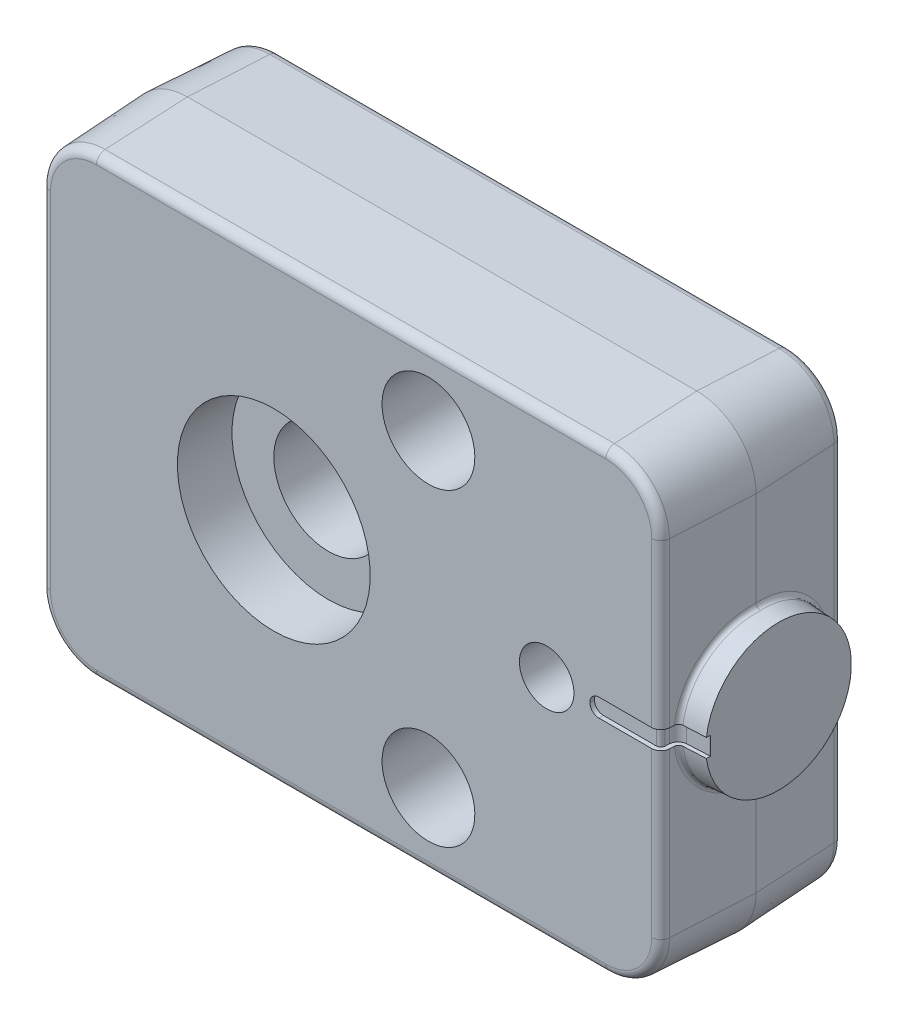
ISO-10303-21;
HEADER;
FILE_DESCRIPTION(('STEP AP214'),'2;1');
FILE_NAME('part.step','',(''),(''),'','','');
FILE_SCHEMA(('AUTOMOTIVE_DESIGN { 1 0 10303 214 1 1 1 1 }'));
ENDSEC;
DATA;
#1=APPLICATION_CONTEXT('core data for automotive mechanical design processes');
#2=APPLICATION_PROTOCOL_DEFINITION('international standard','automotive_design',2000,#1);
#3=PRODUCT_CONTEXT('',#1,'mechanical');
#4=PRODUCT('Part','Part','',(#3));
#5=PRODUCT_RELATED_PRODUCT_CATEGORY('part','',(#4));
#6=PRODUCT_DEFINITION_FORMATION('','',#4);
#7=PRODUCT_DEFINITION_CONTEXT('part definition',#1,'design');
#8=PRODUCT_DEFINITION('design','',#6,#7);
#9=PRODUCT_DEFINITION_SHAPE('','',#8);
#10=(LENGTH_UNIT() NAMED_UNIT(*) SI_UNIT(.MILLI.,.METRE.));
#11=(NAMED_UNIT(*) PLANE_ANGLE_UNIT() SI_UNIT($,.RADIAN.));
#12=(NAMED_UNIT(*) SI_UNIT($,.STERADIAN.) SOLID_ANGLE_UNIT());
#13=UNCERTAINTY_MEASURE_WITH_UNIT(LENGTH_MEASURE(1.E-05),#10,'distance_accuracy_value','');
#14=(GEOMETRIC_REPRESENTATION_CONTEXT(3) GLOBAL_UNCERTAINTY_ASSIGNED_CONTEXT((#13)) GLOBAL_UNIT_ASSIGNED_CONTEXT((#10,
#11,#12)) REPRESENTATION_CONTEXT('',''));
#15=CARTESIAN_POINT('',(0.,0.,0.));
#16=DIRECTION('',(0.,0.,1.));
#17=DIRECTION('',(1.,0.,0.));
#18=AXIS2_PLACEMENT_3D('',#15,#16,#17);
#19=CARTESIAN_POINT('',(-25.5,-25.,0.));
#20=DIRECTION('',(0.,0.,-1.));
#21=DIRECTION('',(0.,1.,0.));
#22=AXIS2_PLACEMENT_3D('',#19,#20,#21);
#23=PLANE('',#22);
#24=DIRECTION('',(1.,0.,0.));
#25=VECTOR('',#24,1.);
#26=CARTESIAN_POINT('',(-25.5,-24.0510354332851,0.));
#27=LINE('',#26,#25);
#28=CARTESIAN_POINT('',(36.5,-24.0510354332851,0.));
#29=VERTEX_POINT('',#28);
#30=CARTESIAN_POINT('',(-19.5,-24.0510354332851,0.));
#31=VERTEX_POINT('',#30);
#32=EDGE_CURVE('E271',#29,#31,#27,.F.);
#33=ORIENTED_EDGE('',*,*,#32,.T.);
#34=CARTESIAN_POINT('',(-19.5,-19.,0.));
#35=DIRECTION('',(0.,0.,-1.));
#36=DIRECTION('',(0.,1.,0.));
#37=AXIS2_PLACEMENT_3D('',#34,#35,#36);
#38=CIRCLE('',#37,5.05103543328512);
#39=CARTESIAN_POINT('',(-24.5510354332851,-19.,0.));
#40=VERTEX_POINT('',#39);
#41=EDGE_CURVE('E334',#31,#40,#38,.T.);
#42=ORIENTED_EDGE('',*,*,#41,.T.);
#43=DIRECTION('',(0.,-1.,0.));
#44=VECTOR('',#43,1.);
#45=CARTESIAN_POINT('',(-24.5510354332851,-25.,0.));
#46=LINE('',#45,#44);
#47=CARTESIAN_POINT('',(-24.5510354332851,19.,0.));
#48=VERTEX_POINT('',#47);
#49=EDGE_CURVE('E332',#40,#48,#46,.F.);
#50=ORIENTED_EDGE('',*,*,#49,.T.);
#51=CARTESIAN_POINT('',(-19.5,19.,0.));
#52=DIRECTION('',(0.,0.,-1.));
#53=DIRECTION('',(0.,1.,0.));
#54=AXIS2_PLACEMENT_3D('',#51,#52,#53);
#55=CIRCLE('',#54,5.05103543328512);
#56=CARTESIAN_POINT('',(-19.5,24.0510354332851,0.));
#57=VERTEX_POINT('',#56);
#58=EDGE_CURVE('E330',#48,#57,#55,.T.);
#59=ORIENTED_EDGE('',*,*,#58,.T.);
#60=DIRECTION('',(-1.,0.,0.));
#61=VECTOR('',#60,1.);
#62=CARTESIAN_POINT('',(-25.5,24.0510354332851,0.));
#63=LINE('',#62,#61);
#64=CARTESIAN_POINT('',(36.5,24.0510354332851,0.));
#65=VERTEX_POINT('',#64);
#66=EDGE_CURVE('E328',#57,#65,#63,.F.);
#67=ORIENTED_EDGE('',*,*,#66,.T.);
#68=CARTESIAN_POINT('',(36.5,19.,0.));
#69=DIRECTION('',(0.,0.,-1.));
#70=DIRECTION('',(0.,1.,0.));
#71=AXIS2_PLACEMENT_3D('',#68,#69,#70);
#72=CIRCLE('',#71,5.05103543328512);
#73=CARTESIAN_POINT('',(41.5510354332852,19.,0.));
#74=VERTEX_POINT('',#73);
#75=EDGE_CURVE('E326',#65,#74,#72,.T.);
#76=ORIENTED_EDGE('',*,*,#75,.T.);
#77=DIRECTION('',(0.,1.,0.));
#78=VECTOR('',#77,1.);
#79=CARTESIAN_POINT('',(41.5510354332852,-25.,0.));
#80=LINE('',#79,#78);
#81=CARTESIAN_POINT('',(41.5510354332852,-19.,0.));
#82=VERTEX_POINT('',#81);
#83=EDGE_CURVE('E324',#74,#82,#80,.F.);
#84=ORIENTED_EDGE('',*,*,#83,.T.);
#85=CARTESIAN_POINT('',(36.5,-19.,0.));
#86=DIRECTION('',(0.,0.,-1.));
#87=DIRECTION('',(0.,1.,0.));
#88=AXIS2_PLACEMENT_3D('',#85,#86,#87);
#89=CIRCLE('',#88,5.05103543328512);
#90=EDGE_CURVE('E322',#82,#29,#89,.T.);
#91=ORIENTED_EDGE('',*,*,#90,.T.);
#92=EDGE_LOOP('',(#33,#42,#50,#59,#67,#76,#84,#91));
#93=FACE_BOUND('',#92,.T.);
#94=CARTESIAN_POINT('',(17.,-17.,0.));
#95=DIRECTION('',(0.,0.,1.));
#96=DIRECTION('',(0.,-1.,0.));
#97=AXIS2_PLACEMENT_3D('',#94,#95,#96);
#98=CIRCLE('',#97,2.8);
#99=CARTESIAN_POINT('',(17.,-19.8,0.));
#100=VERTEX_POINT('',#99);
#101=EDGE_CURVE('E356',#100,#100,#98,.T.);
#102=ORIENTED_EDGE('',*,*,#101,.T.);
#103=EDGE_LOOP('',(#102));
#104=FACE_BOUND('',#103,.T.);
#105=CARTESIAN_POINT('',(17.,17.,0.));
#106=DIRECTION('',(0.,0.,1.));
#107=DIRECTION('',(0.,-1.,0.));
#108=AXIS2_PLACEMENT_3D('',#105,#106,#107);
#109=CIRCLE('',#108,2.8);
#110=CARTESIAN_POINT('',(17.,14.2,0.));
#111=VERTEX_POINT('',#110);
#112=EDGE_CURVE('E1329',#111,#111,#109,.T.);
#113=ORIENTED_EDGE('',*,*,#112,.T.);
#114=EDGE_LOOP('',(#113));
#115=FACE_BOUND('',#114,.T.);
#116=CARTESIAN_POINT('',(0.,0.,0.));
#117=DIRECTION('',(0.,0.,1.));
#118=DIRECTION('',(0.,-1.,0.));
#119=AXIS2_PLACEMENT_3D('',#116,#117,#118);
#120=CIRCLE('',#119,10.6);
#121=CARTESIAN_POINT('',(0.,-10.6,0.));
#122=VERTEX_POINT('',#121);
#123=EDGE_CURVE('E1306',#122,#122,#120,.T.);
#124=ORIENTED_EDGE('',*,*,#123,.T.);
#125=EDGE_LOOP('',(#124));
#126=FACE_BOUND('',#125,.T.);
#127=ADVANCED_FACE('F16',(#93,#104,#115,#126),#23,.T.);
#128=CARTESIAN_POINT('',(42.5,25.,20.));
#129=DIRECTION('',(0.998629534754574,0.,0.052335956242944));
#130=DIRECTION('',(-0.052335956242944,0.,0.998629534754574));
#131=AXIS2_PLACEMENT_3D('',#128,#129,#130);
#132=PLANE('',#131);
#133=DIRECTION('',(-0.052335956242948,0.,0.998629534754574));
#134=VECTOR('',#133,1.);
#135=CARTESIAN_POINT('',(42.5496649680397,1.,19.0523359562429));
#136=LINE('',#135,#134);
#137=CARTESIAN_POINT('',(42.5763358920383,1.,18.5434244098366));
#138=VERTEX_POINT('',#137);
#139=CARTESIAN_POINT('',(42.5496649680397,1.,19.0523359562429));
#140=VERTEX_POINT('',#139);
#141=EDGE_CURVE('E452',#138,#140,#136,.T.);
#142=ORIENTED_EDGE('',*,*,#141,.F.);
#143=CARTESIAN_POINT('',(43.0242106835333,0.,9.99746429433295));
#144=DIRECTION('',(0.998629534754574,0.,0.052335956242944));
#145=DIRECTION('',(-0.0523359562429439,0.,0.998629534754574));
#146=AXIS2_PLACEMENT_3D('',#143,#144,#145);
#147=ELLIPSE('',#146,8.61607684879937,8.60423636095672);
#148=CARTESIAN_POINT('',(43.0240777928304,8.60423598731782,10.));
#149=VERTEX_POINT('',#148);
#150=EDGE_CURVE('E605',#138,#149,#147,.F.);
#151=ORIENTED_EDGE('',*,*,#150,.T.);
#152=DIRECTION('',(0.,1.,0.));
#153=VECTOR('',#152,1.);
#154=CARTESIAN_POINT('',(43.0240777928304,25.,10.));
#155=LINE('',#154,#153);
#156=CARTESIAN_POINT('',(43.0240777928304,19.,10.));
#157=VERTEX_POINT('',#156);
#158=EDGE_CURVE('E258',#149,#157,#155,.T.);
#159=ORIENTED_EDGE('',*,*,#158,.T.);
#160=DIRECTION('',(0.0523359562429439,0.,-0.998629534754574));
#161=VECTOR('',#160,1.);
#162=CARTESIAN_POINT('',(42.5,19.,20.));
#163=LINE('',#162,#161);
#164=CARTESIAN_POINT('',(42.5496649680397,19.,19.0523359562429));
#165=VERTEX_POINT('',#164);
#166=EDGE_CURVE('E281',#157,#165,#163,.F.);
#167=ORIENTED_EDGE('',*,*,#166,.T.);
#168=DIRECTION('',(0.,1.,0.));
#169=VECTOR('',#168,1.);
#170=CARTESIAN_POINT('',(42.5496649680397,25.,19.0523359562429));
#171=LINE('',#170,#169);
#172=EDGE_CURVE('E642',#165,#140,#171,.F.);
#173=ORIENTED_EDGE('',*,*,#172,.T.);
#174=EDGE_LOOP('',(#142,#151,#159,#167,#173));
#175=FACE_BOUND('',#174,.T.);
#176=ADVANCED_FACE('F546',(#175),#132,.T.);
#177=CARTESIAN_POINT('',(-25.5,-25.,20.));
#178=DIRECTION('',(0.,0.,-1.));
#179=DIRECTION('',(0.,1.,0.));
#180=AXIS2_PLACEMENT_3D('',#177,#178,#179);
#181=PLANE('',#180);
#182=CARTESIAN_POINT('',(30.,0.,20.));
#183=DIRECTION('',(0.,0.,1.));
#184=DIRECTION('',(0.,-1.,0.));
#185=AXIS2_PLACEMENT_3D('',#182,#183,#184);
#186=CIRCLE('',#185,3.);
#187=CARTESIAN_POINT('',(30.,-3.,20.));
#188=VERTEX_POINT('',#187);
#189=EDGE_CURVE('E1301',#188,#188,#186,.T.);
#190=ORIENTED_EDGE('',*,*,#189,.F.);
#191=EDGE_LOOP('',(#190));
#192=FACE_BOUND('',#191,.T.);
#193=CARTESIAN_POINT('',(0.,0.,20.));
#194=DIRECTION('',(0.,0.,1.));
#195=DIRECTION('',(0.,-1.,0.));
#196=AXIS2_PLACEMENT_3D('',#193,#194,#195);
#197=CIRCLE('',#196,10.6);
#198=CARTESIAN_POINT('',(0.,-10.6,20.));
#199=VERTEX_POINT('',#198);
#200=EDGE_CURVE('E1312',#199,#199,#197,.T.);
#201=ORIENTED_EDGE('',*,*,#200,.F.);
#202=EDGE_LOOP('',(#201));
#203=FACE_BOUND('',#202,.T.);
#204=CARTESIAN_POINT('',(17.,17.,20.));
#205=DIRECTION('',(0.,0.,1.));
#206=DIRECTION('',(0.,-1.,0.));
#207=AXIS2_PLACEMENT_3D('',#204,#205,#206);
#208=CIRCLE('',#207,5.1);
#209=CARTESIAN_POINT('',(17.,11.9,20.));
#210=VERTEX_POINT('',#209);
#211=EDGE_CURVE('E1318',#210,#210,#208,.T.);
#212=ORIENTED_EDGE('',*,*,#211,.F.);
#213=EDGE_LOOP('',(#212));
#214=FACE_BOUND('',#213,.T.);
#215=CARTESIAN_POINT('',(17.,-17.,20.));
#216=DIRECTION('',(0.,0.,1.));
#217=DIRECTION('',(0.,-1.,0.));
#218=AXIS2_PLACEMENT_3D('',#215,#216,#217);
#219=CIRCLE('',#218,5.1);
#220=CARTESIAN_POINT('',(17.,-22.1,20.));
#221=VERTEX_POINT('',#220);
#222=EDGE_CURVE('E1332',#221,#221,#219,.T.);
#223=ORIENTED_EDGE('',*,*,#222,.F.);
#224=EDGE_LOOP('',(#223));
#225=FACE_BOUND('',#224,.T.);
#226=DIRECTION('',(-1.,0.,0.));
#227=VECTOR('',#226,1.);
#228=CARTESIAN_POINT('',(41.5510354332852,1.,20.));
#229=LINE('',#228,#227);
#230=CARTESIAN_POINT('',(41.5510354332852,1.,20.));
#231=VERTEX_POINT('',#230);
#232=CARTESIAN_POINT('',(35.75,1.,20.));
#233=VERTEX_POINT('',#232);
#234=EDGE_CURVE('E435',#231,#233,#229,.T.);
#235=ORIENTED_EDGE('',*,*,#234,.F.);
#236=DIRECTION('',(0.,-1.,0.));
#237=VECTOR('',#236,1.);
#238=CARTESIAN_POINT('',(41.5510354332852,-25.,20.));
#239=LINE('',#238,#237);
#240=CARTESIAN_POINT('',(41.5510354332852,19.,20.));
#241=VERTEX_POINT('',#240);
#242=EDGE_CURVE('E670',#231,#241,#239,.F.);
#243=ORIENTED_EDGE('',*,*,#242,.T.);
#244=CARTESIAN_POINT('',(36.5,19.,20.));
#245=DIRECTION('',(0.,0.,-1.));
#246=DIRECTION('',(0.,1.,0.));
#247=AXIS2_PLACEMENT_3D('',#244,#245,#246);
#248=CIRCLE('',#247,5.05103543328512);
#249=CARTESIAN_POINT('',(36.5,24.0510354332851,20.));
#250=VERTEX_POINT('',#249);
#251=EDGE_CURVE('E665',#241,#250,#248,.F.);
#252=ORIENTED_EDGE('',*,*,#251,.T.);
#253=DIRECTION('',(1.,0.,0.));
#254=VECTOR('',#253,1.);
#255=CARTESIAN_POINT('',(-25.5,24.0510354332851,20.));
#256=LINE('',#255,#254);
#257=CARTESIAN_POINT('',(-19.5,24.0510354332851,20.));
#258=VERTEX_POINT('',#257);
#259=EDGE_CURVE('E663',#250,#258,#256,.F.);
#260=ORIENTED_EDGE('',*,*,#259,.T.);
#261=CARTESIAN_POINT('',(-19.5,19.,20.));
#262=DIRECTION('',(0.,0.,-1.));
#263=DIRECTION('',(0.,1.,0.));
#264=AXIS2_PLACEMENT_3D('',#261,#262,#263);
#265=CIRCLE('',#264,5.05103543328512);
#266=CARTESIAN_POINT('',(-24.5510354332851,19.,20.));
#267=VERTEX_POINT('',#266);
#268=EDGE_CURVE('E661',#258,#267,#265,.F.);
#269=ORIENTED_EDGE('',*,*,#268,.T.);
#270=DIRECTION('',(0.,1.,0.));
#271=VECTOR('',#270,1.);
#272=CARTESIAN_POINT('',(-24.5510354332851,-25.,20.));
#273=LINE('',#272,#271);
#274=CARTESIAN_POINT('',(-24.5510354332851,-19.,20.));
#275=VERTEX_POINT('',#274);
#276=EDGE_CURVE('E659',#267,#275,#273,.F.);
#277=ORIENTED_EDGE('',*,*,#276,.T.);
#278=CARTESIAN_POINT('',(-19.5,-19.,20.));
#279=DIRECTION('',(0.,0.,-1.));
#280=DIRECTION('',(0.,1.,0.));
#281=AXIS2_PLACEMENT_3D('',#278,#279,#280);
#282=CIRCLE('',#281,5.05103543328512);
#283=CARTESIAN_POINT('',(-19.5,-24.0510354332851,20.));
#284=VERTEX_POINT('',#283);
#285=EDGE_CURVE('E656',#275,#284,#282,.F.);
#286=ORIENTED_EDGE('',*,*,#285,.T.);
#287=DIRECTION('',(-1.,0.,0.));
#288=VECTOR('',#287,1.);
#289=CARTESIAN_POINT('',(-25.5,-24.0510354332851,20.));
#290=LINE('',#289,#288);
#291=CARTESIAN_POINT('',(36.5,-24.0510354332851,20.));
#292=VERTEX_POINT('',#291);
#293=EDGE_CURVE('E673',#284,#292,#290,.F.);
#294=ORIENTED_EDGE('',*,*,#293,.T.);
#295=CARTESIAN_POINT('',(36.5,-19.,20.));
#296=DIRECTION('',(0.,0.,-1.));
#297=DIRECTION('',(0.,1.,0.));
#298=AXIS2_PLACEMENT_3D('',#295,#296,#297);
#299=CIRCLE('',#298,5.05103543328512);
#300=CARTESIAN_POINT('',(41.5510354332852,-19.,20.));
#301=VERTEX_POINT('',#300);
#302=EDGE_CURVE('E671',#292,#301,#299,.F.);
#303=ORIENTED_EDGE('',*,*,#302,.T.);
#304=CARTESIAN_POINT('',(41.5510354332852,-1.,20.));
#305=VERTEX_POINT('',#304);
#306=EDGE_CURVE('E667',#301,#305,#239,.F.);
#307=ORIENTED_EDGE('',*,*,#306,.T.);
#308=DIRECTION('',(-1.,0.,0.));
#309=VECTOR('',#308,1.);
#310=CARTESIAN_POINT('',(41.5510354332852,-1.,20.));
#311=LINE('',#310,#309);
#312=CARTESIAN_POINT('',(35.75,-1.,20.));
#313=VERTEX_POINT('',#312);
#314=EDGE_CURVE('E458',#305,#313,#311,.T.);
#315=ORIENTED_EDGE('',*,*,#314,.T.);
#316=CARTESIAN_POINT('',(35.75,0.,20.));
#317=DIRECTION('',(0.,0.,-1.));
#318=DIRECTION('',(0.,1.,0.));
#319=AXIS2_PLACEMENT_3D('',#316,#317,#318);
#320=CIRCLE('',#319,1.);
#321=CARTESIAN_POINT('',(34.75,0.,20.));
#322=VERTEX_POINT('',#321);
#323=EDGE_CURVE('E25',#313,#322,#320,.T.);
#324=ORIENTED_EDGE('',*,*,#323,.T.);
#325=CARTESIAN_POINT('',(35.75,0.,20.));
#326=DIRECTION('',(0.,0.,-1.));
#327=DIRECTION('',(0.,1.,0.));
#328=AXIS2_PLACEMENT_3D('',#325,#326,#327);
#329=CIRCLE('',#328,1.);
#330=EDGE_CURVE('E10',#322,#233,#329,.T.);
#331=ORIENTED_EDGE('',*,*,#330,.T.);
#332=EDGE_LOOP('',(#235,#243,#252,#260,#269,#277,#286,#294,#303,#307,#315,#324,#331));
#333=FACE_BOUND('',#332,.T.);
#334=ADVANCED_FACE('F573',(#192,#203,#214,#225,#333),#181,.F.);
#335=CARTESIAN_POINT('',(41.5510354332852,-25.,19.));
#336=DIRECTION('',(0.,-1.,0.));
#337=DIRECTION('',(0.,0.,-1.));
#338=AXIS2_PLACEMENT_3D('',#335,#336,#337);
#339=CYLINDRICAL_SURFACE('',#338,1.);
#340=ORIENTED_EDGE('',*,*,#242,.F.);
#341=CARTESIAN_POINT('',(41.5510354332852,1.,19.));
#342=DIRECTION('',(0.,-1.,0.));
#343=DIRECTION('',(0.,0.,-1.));
#344=AXIS2_PLACEMENT_3D('',#341,#342,#343);
#345=CIRCLE('',#344,1.);
#346=EDGE_CURVE('E433',#140,#231,#345,.T.);
#347=ORIENTED_EDGE('',*,*,#346,.F.);
#348=ORIENTED_EDGE('',*,*,#172,.F.);
#349=CARTESIAN_POINT('',(41.5510354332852,19.,19.));
#350=DIRECTION('',(0.,-1.,0.));
#351=DIRECTION('',(0.,0.,-1.));
#352=AXIS2_PLACEMENT_3D('',#349,#350,#351);
#353=CIRCLE('',#352,1.);
#354=EDGE_CURVE('E619',#165,#241,#353,.T.);
#355=ORIENTED_EDGE('',*,*,#354,.T.);
#356=EDGE_LOOP('',(#340,#347,#348,#355));
#357=FACE_BOUND('',#356,.T.);
#358=ADVANCED_FACE('F774',(#357),#339,.T.);
#359=CARTESIAN_POINT('',(43.0464268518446,0.,18.1285863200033));
#360=CARTESIAN_POINT('',(42.5968418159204,0.,18.152148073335));
#361=CARTESIAN_POINT('',(42.5732800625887,0.,18.6017331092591));
#362=CARTESIAN_POINT('',(43.0464268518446,-0.353705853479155,18.1285863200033));
#363=CARTESIAN_POINT('',(42.5968418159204,-0.355761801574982,18.152148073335));
#364=CARTESIAN_POINT('',(42.5732800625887,-0.37543294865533,18.6017331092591));
#365=CARTESIAN_POINT('',(43.0477164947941,-0.707411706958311,18.1053986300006));
#366=CARTESIAN_POINT('',(42.5980677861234,-0.711571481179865,18.128755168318));
#367=CARTESIAN_POINT('',(42.5745697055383,-0.750865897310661,18.577125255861));
#368=CARTESIAN_POINT('',(43.0528528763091,-1.40876818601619,18.0130472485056));
#369=CARTESIAN_POINT('',(42.6029489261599,-1.41695771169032,18.0356174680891));
#370=CARTESIAN_POINT('',(42.5797060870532,-1.49530783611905,18.4791172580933));
#371=CARTESIAN_POINT('',(43.0566997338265,-1.75641852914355,17.9438814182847));
#372=CARTESIAN_POINT('',(42.6066055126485,-1.76662652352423,17.965845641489));
#373=CARTESIAN_POINT('',(42.5835529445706,-1.86431652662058,18.4057148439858));
#374=CARTESIAN_POINT('',(43.0668846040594,-2.43971316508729,17.7607605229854));
#375=CARTESIAN_POINT('',(42.6162829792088,-2.45370866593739,17.7811885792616));
#376=CARTESIAN_POINT('',(42.5937378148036,-2.58959653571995,18.2113759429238));
#377=CARTESIAN_POINT('',(43.0732228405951,-2.77535637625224,17.6468014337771));
#378=CARTESIAN_POINT('',(42.6223065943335,-2.79120402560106,17.6662511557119));
#379=CARTESIAN_POINT('',(42.6000760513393,-2.94586670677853,18.0904351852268));
#380=CARTESIAN_POINT('',(43.088281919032,-3.428892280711,17.3760475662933));
#381=CARTESIAN_POINT('',(42.6366122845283,-3.44813745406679,17.3932823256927));
#382=CARTESIAN_POINT('',(42.6151351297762,-3.63957476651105,17.8030908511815));
#383=CARTESIAN_POINT('',(43.0970030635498,-3.74678271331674,17.2192473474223));
#384=CARTESIAN_POINT('',(42.6448982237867,-3.76764132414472,17.2351771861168));
#385=CARTESIAN_POINT('',(42.623856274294,-3.97701025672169,17.6366815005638));
#386=CARTESIAN_POINT('',(43.116678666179,-4.35937325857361,16.8654978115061));
#387=CARTESIAN_POINT('',(42.6635837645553,-4.38311160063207,16.8786358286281));
#388=CARTESIAN_POINT('',(42.6435318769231,-4.62727668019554,17.2612486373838));
#389=CARTESIAN_POINT('',(43.1276334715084,-4.6540697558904,16.6685422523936));
#390=CARTESIAN_POINT('',(42.6739880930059,-4.67912275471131,16.6801094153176));
#391=CARTESIAN_POINT('',(42.6544866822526,-4.94010377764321,17.052218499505));
#392=CARTESIAN_POINT('',(43.1515889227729,-5.21523029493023,16.2378554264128));
#393=CARTESIAN_POINT('',(42.6967292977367,-5.24254391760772,16.2461813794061));
#394=CARTESIAN_POINT('',(42.678442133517,-5.53580232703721,16.5951212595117));
#395=CARTESIAN_POINT('',(43.1645899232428,-5.48168943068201,16.0041177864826));
#396=CARTESIAN_POINT('',(42.7090714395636,-5.50997430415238,16.0106792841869));
#397=CARTESIAN_POINT('',(42.6914431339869,-5.81866857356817,16.3470473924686));
#398=CARTESIAN_POINT('',(43.1924153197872,-5.98181690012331,15.5038690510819));
#399=CARTESIAN_POINT('',(42.7354741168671,-6.01167368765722,15.5068861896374));
#400=CARTESIAN_POINT('',(42.7192685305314,-6.34960683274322,15.8161071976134));
#401=CARTESIAN_POINT('',(43.2072400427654,-6.21547933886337,15.2373520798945));
#402=CARTESIAN_POINT('',(42.7495400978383,-6.24593711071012,15.2384912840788));
#403=CARTESIAN_POINT('',(42.7340932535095,-6.59767259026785,15.5332346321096));
#404=CARTESIAN_POINT('',(43.238459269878,-6.64601665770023,14.6761071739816));
#405=CARTESIAN_POINT('',(42.7791471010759,-6.67732329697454,14.6735560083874));
#406=CARTESIAN_POINT('',(42.7653124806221,-7.05476633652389,14.9375362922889));
#407=CARTESIAN_POINT('',(43.2548540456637,-6.8428851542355,14.3813743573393));
#408=CARTESIAN_POINT('',(42.7946933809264,-6.87441478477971,14.3769153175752));
#409=CARTESIAN_POINT('',(42.7817072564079,-7.26378755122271,14.6247053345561));
#410=CARTESIAN_POINT('',(43.2889329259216,-7.19646760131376,13.7687423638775));
#411=CARTESIAN_POINT('',(42.8269927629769,-7.22812562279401,13.76060639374));
#412=CARTESIAN_POINT('',(42.8157861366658,-7.63921614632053,13.9744415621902));
#413=CARTESIAN_POINT('',(43.3066172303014,-7.35317530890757,13.4508395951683));
#414=CARTESIAN_POINT('',(42.8437505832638,-7.38469004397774,13.4408481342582));
#415=CARTESIAN_POINT('',(42.8334704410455,-7.80561690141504,13.637004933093));
#416=CARTESIAN_POINT('',(43.3429726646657,-7.62375638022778,12.7973081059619));
#417=CARTESIAN_POINT('',(42.8781846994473,-7.65471806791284,12.7838060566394));
#418=CARTESIAN_POINT('',(42.8698258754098,-8.09295704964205,12.9433019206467));
#419=CARTESIAN_POINT('',(43.3616439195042,-7.73762430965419,12.4616771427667));
#420=CARTESIAN_POINT('',(42.8958648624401,-7.76810677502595,12.4464484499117));
#421=CARTESIAN_POINT('',(42.8884971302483,-8.21389067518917,12.5870331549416));
#422=CARTESIAN_POINT('',(43.399653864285,-7.92057891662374,11.7784324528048));
#423=CARTESIAN_POINT('',(42.9318402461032,-7.94989981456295,11.7599972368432));
#424=CARTESIAN_POINT('',(42.9265070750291,-8.40822626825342,11.8617602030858));
#425=CARTESIAN_POINT('',(43.4189926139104,-7.98966157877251,11.4308176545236));
#426=CARTESIAN_POINT('',(42.9501382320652,-8.01821434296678,11.4108508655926));
#427=CARTESIAN_POINT('',(42.9458458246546,-8.4816239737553,11.4927548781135));
#428=CARTESIAN_POINT('',(43.4580067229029,-8.08186484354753,10.729553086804));
#429=CARTESIAN_POINT('',(42.9870360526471,-8.10874963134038,10.7067985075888));
#430=CARTESIAN_POINT('',(42.984859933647,-8.57963015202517,10.7483213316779));
#431=CARTESIAN_POINT('',(43.477682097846,-8.10498331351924,10.3759030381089));
#432=CARTESIAN_POINT('',(43.0056373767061,-8.13087175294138,10.3518641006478));
#433=CARTESIAN_POINT('',(43.0045353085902,-8.60423636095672,10.3728928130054));
#434=CARTESIAN_POINT('',(43.5170328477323,-8.10486364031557,9.66861869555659));
#435=CARTESIAN_POINT('',(43.042824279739,-8.12870239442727,9.64229572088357));
#436=CARTESIAN_POINT('',(43.0438860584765,-8.60423636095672,9.62203577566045));
#437=CARTESIAN_POINT('',(43.5367082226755,-8.08162549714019,9.31498440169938));
#438=CARTESIAN_POINT('',(43.0614099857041,-8.10431011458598,9.2876593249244));
#439=CARTESIAN_POINT('',(43.0635614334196,-8.57963015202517,9.24660725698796));
#440=CARTESIAN_POINT('',(43.575722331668,-7.98919104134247,8.61378178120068));
#441=CARTESIAN_POINT('',(43.0982491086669,-8.00958335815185,8.58472698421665));
#442=CARTESIAN_POINT('',(43.1025755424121,-8.4816239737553,8.50217371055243));
#443=CARTESIAN_POINT('',(43.5950610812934,-7.91999686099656,8.26621317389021));
#444=CARTESIAN_POINT('',(43.1165012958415,-7.93915274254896,8.23645450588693));
#445=CARTESIAN_POINT('',(43.1219142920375,-8.40822626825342,8.13316838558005));
#446=CARTESIAN_POINT('',(43.6330710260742,-7.73683497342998,7.58308815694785));
#447=CARTESIAN_POINT('',(43.152363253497,-7.7536001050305,7.55216758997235));
#448=CARTESIAN_POINT('',(43.1599242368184,-8.21389067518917,7.40789543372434));
#449=CARTESIAN_POINT('',(43.6517422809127,-7.62287128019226,7.24753067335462));
#450=CARTESIAN_POINT('',(43.1699705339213,-7.63839312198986,7.21620066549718));
#451=CARTESIAN_POINT('',(43.1785954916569,-8.09295704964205,7.0516266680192));
#452=CARTESIAN_POINT('',(43.688097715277,-7.35212096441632,6.59416842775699));
#453=CARTESIAN_POINT('',(43.2042441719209,-7.36529299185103,6.56222069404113));
#454=CARTESIAN_POINT('',(43.2149509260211,-7.80561690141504,6.35792365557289));
#455=CARTESIAN_POINT('',(43.7057820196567,-7.19533977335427,6.27636142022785));
#456=CARTESIAN_POINT('',(43.2209069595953,-7.2073318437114,6.24427576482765));
#457=CARTESIAN_POINT('',(43.2326352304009,-7.63921614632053,6.02048702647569));
#458=CARTESIAN_POINT('',(43.7398608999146,-6.84163765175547,5.66393670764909));
#459=CARTESIAN_POINT('',(43.2530096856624,-6.85144575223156,5.63171926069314));
#460=CARTESIAN_POINT('',(43.2667141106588,-7.26378755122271,5.37022325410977));
#461=CARTESIAN_POINT('',(43.7562556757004,-6.64472295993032,5.36931540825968));
#462=CARTESIAN_POINT('',(43.2684452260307,-6.65347443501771,5.3371916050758));
#463=CARTESIAN_POINT('',(43.2831088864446,-7.05476633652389,5.05739229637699));
#464=CARTESIAN_POINT('',(43.787474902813,-6.21412369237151,4.80830169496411));
#465=CARTESIAN_POINT('',(43.2978327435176,-6.22095868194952,4.77644436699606));
#466=CARTESIAN_POINT('',(43.3143281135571,-6.59767259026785,4.46169395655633));
#467=CARTESIAN_POINT('',(43.8022996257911,-5.98044549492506,4.54190439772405));
#468=CARTESIAN_POINT('',(43.311779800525,-5.98639274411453,4.51031866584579));
#469=CARTESIAN_POINT('',(43.3291528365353,-6.34960683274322,4.1788213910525));
#470=CARTESIAN_POINT('',(43.8301250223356,-5.48031802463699,4.04189501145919));
#471=CARTESIAN_POINT('',(43.3379550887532,-5.48468748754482,4.01086441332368));
#472=CARTESIAN_POINT('',(43.3569782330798,-5.81866857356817,3.64788119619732));
#473=CARTESIAN_POINT('',(43.8431260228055,-5.21387464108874,3.80827704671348));
#474=CARTESIAN_POINT('',(43.3501782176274,-5.21755314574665,3.77763322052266));
#475=CARTESIAN_POINT('',(43.3699792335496,-5.53580232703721,3.39980732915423));
#476=CARTESIAN_POINT('',(43.8670814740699,-4.65277604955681,3.37782141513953));
#477=CARTESIAN_POINT('',(43.3726996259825,-4.65525139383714,3.34789914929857));
#478=CARTESIAN_POINT('',(43.3939346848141,-4.94010377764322,2.94271008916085));
#479=CARTESIAN_POINT('',(43.8780362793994,-4.35812574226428,3.18097737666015));
#480=CARTESIAN_POINT('',(43.3829929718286,-4.36011529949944,3.15149041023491));
#481=CARTESIAN_POINT('',(43.4048894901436,-4.62727668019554,2.73367995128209));
#482=CARTESIAN_POINT('',(43.8977118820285,-3.74565487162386,2.82743512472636));
#483=CARTESIAN_POINT('',(43.4014813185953,-3.74681446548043,2.79871173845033));
#484=CARTESIAN_POINT('',(43.4245650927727,-3.97701025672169,2.35824708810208));
#485=CARTESIAN_POINT('',(43.9064330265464,-3.42783791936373,2.67073067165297));
#486=CARTESIAN_POINT('',(43.4096718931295,-3.42870549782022,2.64242626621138));
#487=CARTESIAN_POINT('',(43.4332862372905,-3.63957476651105,2.19183773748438));
#488=CARTESIAN_POINT('',(43.9214921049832,-2.77447126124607,2.40014605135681));
#489=CARTESIAN_POINT('',(43.4238164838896,-2.77484429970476,2.37253139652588));
#490=CARTESIAN_POINT('',(43.4483453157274,-2.94586670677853,1.90449340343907));
#491=CARTESIAN_POINT('',(43.9278303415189,-2.43892381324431,2.28626044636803));
#492=CARTESIAN_POINT('',(43.4297668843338,-2.43916879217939,2.25899099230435));
#493=CARTESIAN_POINT('',(43.4546835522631,-2.58959653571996,1.78355264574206));
#494=CARTESIAN_POINT('',(43.9380152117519,-1.75583646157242,2.10325922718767));
#495=CARTESIAN_POINT('',(43.4393303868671,-1.75585230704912,2.07650849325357));
#496=CARTESIAN_POINT('',(43.4648684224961,-1.86431652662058,1.58921374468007));
#497=CARTESIAN_POINT('',(43.9418620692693,-1.40829763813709,2.03413959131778));
#498=CARTESIAN_POINT('',(43.4429409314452,-1.40830410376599,2.00761519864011));
#499=CARTESIAN_POINT('',(43.4687152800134,-1.49530783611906,1.51581133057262));
#500=CARTESIAN_POINT('',(43.9469984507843,-0.707172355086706,1.94185015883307));
#501=CARTESIAN_POINT('',(43.4477630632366,-0.707119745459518,1.91560344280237));
#502=CARTESIAN_POINT('',(43.4738516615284,-0.750865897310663,1.41780333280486));
#503=CARTESIAN_POINT('',(43.9482880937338,-0.353586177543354,1.91867822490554));
#504=CARTESIAN_POINT('',(43.4489733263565,-0.353586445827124,1.89251024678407));
#505=CARTESIAN_POINT('',(43.475141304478,-0.375432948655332,1.39319547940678));
#506=CARTESIAN_POINT('',(43.9482880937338,0.353586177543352,1.91867822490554));
#507=CARTESIAN_POINT('',(43.4489733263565,0.353586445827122,1.89251024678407));
#508=CARTESIAN_POINT('',(43.475141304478,0.37543294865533,1.39319547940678));
#509=CARTESIAN_POINT('',(43.9469984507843,0.707172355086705,1.94185015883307));
#510=CARTESIAN_POINT('',(43.4477630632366,0.707119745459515,1.91560344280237));
#511=CARTESIAN_POINT('',(43.4738516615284,0.750865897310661,1.41780333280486));
#512=CARTESIAN_POINT('',(43.9418620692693,1.40829763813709,2.03413959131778));
#513=CARTESIAN_POINT('',(43.4429409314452,1.40830410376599,2.00761519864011));
#514=CARTESIAN_POINT('',(43.4687152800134,1.49530783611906,1.51581133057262));
#515=CARTESIAN_POINT('',(43.9380152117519,1.75583646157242,2.10325922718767));
#516=CARTESIAN_POINT('',(43.4393303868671,1.75585230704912,2.07650849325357));
#517=CARTESIAN_POINT('',(43.4648684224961,1.86431652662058,1.58921374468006));
#518=CARTESIAN_POINT('',(43.9278303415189,2.43892381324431,2.28626044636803));
#519=CARTESIAN_POINT('',(43.4297668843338,2.43916879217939,2.25899099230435));
#520=CARTESIAN_POINT('',(43.4546835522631,2.58959653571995,1.78355264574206));
#521=CARTESIAN_POINT('',(43.9214921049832,2.77447126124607,2.40014605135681));
#522=CARTESIAN_POINT('',(43.4238164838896,2.77484429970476,2.37253139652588));
#523=CARTESIAN_POINT('',(43.4483453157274,2.94586670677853,1.90449340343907));
#524=CARTESIAN_POINT('',(43.9064330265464,3.42783791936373,2.67073067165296));
#525=CARTESIAN_POINT('',(43.4096718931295,3.42870549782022,2.64242626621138));
#526=CARTESIAN_POINT('',(43.4332862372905,3.63957476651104,2.19183773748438));
#527=CARTESIAN_POINT('',(43.8977118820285,3.74565487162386,2.82743512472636));
#528=CARTESIAN_POINT('',(43.4014813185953,3.74681446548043,2.79871173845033));
#529=CARTESIAN_POINT('',(43.4245650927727,3.97701025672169,2.35824708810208));
#530=CARTESIAN_POINT('',(43.8780362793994,4.35812574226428,3.18097737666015));
#531=CARTESIAN_POINT('',(43.3829929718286,4.36011529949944,3.15149041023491));
#532=CARTESIAN_POINT('',(43.4048894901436,4.62727668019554,2.73367995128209));
#533=CARTESIAN_POINT('',(43.8670814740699,4.6527760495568,3.37782141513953));
#534=CARTESIAN_POINT('',(43.3726996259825,4.65525139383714,3.34789914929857));
#535=CARTESIAN_POINT('',(43.3939346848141,4.94010377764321,2.94271008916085));
#536=CARTESIAN_POINT('',(43.8431260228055,5.21387464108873,3.80827704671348));
#537=CARTESIAN_POINT('',(43.3501782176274,5.21755314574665,3.77763322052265));
#538=CARTESIAN_POINT('',(43.3699792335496,5.53580232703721,3.39980732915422));
#539=CARTESIAN_POINT('',(43.8301250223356,5.48031802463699,4.04189501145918));
#540=CARTESIAN_POINT('',(43.3379550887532,5.48468748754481,4.01086441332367));
#541=CARTESIAN_POINT('',(43.3569782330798,5.81866857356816,3.64788119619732));
#542=CARTESIAN_POINT('',(43.8022996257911,5.98044549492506,4.54190439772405));
#543=CARTESIAN_POINT('',(43.311779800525,5.98639274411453,4.51031866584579));
#544=CARTESIAN_POINT('',(43.3291528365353,6.34960683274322,4.1788213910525));
#545=CARTESIAN_POINT('',(43.787474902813,6.21412369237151,4.8083016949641));
#546=CARTESIAN_POINT('',(43.2978327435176,6.22095868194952,4.77644436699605));
#547=CARTESIAN_POINT('',(43.3143281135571,6.59767259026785,4.46169395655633));
#548=CARTESIAN_POINT('',(43.7562556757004,6.64472295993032,5.36931540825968));
#549=CARTESIAN_POINT('',(43.2684452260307,6.65347443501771,5.3371916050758));
#550=CARTESIAN_POINT('',(43.2831088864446,7.05476633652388,5.05739229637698));
#551=CARTESIAN_POINT('',(43.7398608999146,6.84163765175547,5.66393670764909));
#552=CARTESIAN_POINT('',(43.2530096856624,6.85144575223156,5.63171926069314));
#553=CARTESIAN_POINT('',(43.2667141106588,7.26378755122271,5.37022325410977));
#554=CARTESIAN_POINT('',(43.7057820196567,7.19533977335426,6.27636142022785));
#555=CARTESIAN_POINT('',(43.2209069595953,7.2073318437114,6.24427576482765));
#556=CARTESIAN_POINT('',(43.2326352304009,7.63921614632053,6.02048702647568));
#557=CARTESIAN_POINT('',(43.688097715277,7.35212096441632,6.59416842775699));
#558=CARTESIAN_POINT('',(43.2042441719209,7.36529299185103,6.56222069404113));
#559=CARTESIAN_POINT('',(43.2149509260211,7.80561690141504,6.35792365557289));
#560=CARTESIAN_POINT('',(43.6517422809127,7.62287128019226,7.24753067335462));
#561=CARTESIAN_POINT('',(43.1699705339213,7.63839312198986,7.21620066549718));
#562=CARTESIAN_POINT('',(43.1785954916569,8.09295704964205,7.0516266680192));
#563=CARTESIAN_POINT('',(43.6330710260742,7.73683497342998,7.58308815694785));
#564=CARTESIAN_POINT('',(43.152363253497,7.7536001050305,7.55216758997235));
#565=CARTESIAN_POINT('',(43.1599242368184,8.21389067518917,7.40789543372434));
#566=CARTESIAN_POINT('',(43.5950610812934,7.91999686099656,8.26621317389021));
#567=CARTESIAN_POINT('',(43.1165012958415,7.93915274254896,8.23645450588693));
#568=CARTESIAN_POINT('',(43.1219142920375,8.40822626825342,8.13316838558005));
#569=CARTESIAN_POINT('',(43.575722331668,7.98919104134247,8.61378178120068));
#570=CARTESIAN_POINT('',(43.0982491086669,8.00958335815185,8.58472698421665));
#571=CARTESIAN_POINT('',(43.1025755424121,8.4816239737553,8.50217371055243));
#572=CARTESIAN_POINT('',(43.5367082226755,8.08162549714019,9.31498440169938));
#573=CARTESIAN_POINT('',(43.0614099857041,8.10431011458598,9.2876593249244));
#574=CARTESIAN_POINT('',(43.0635614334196,8.57963015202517,9.24660725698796));
#575=CARTESIAN_POINT('',(43.5170328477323,8.10486364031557,9.66861869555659));
#576=CARTESIAN_POINT('',(43.042824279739,8.12870239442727,9.64229572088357));
#577=CARTESIAN_POINT('',(43.0438860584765,8.60423636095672,9.62203577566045));
#578=CARTESIAN_POINT('',(43.477682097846,8.10498331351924,10.3759030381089));
#579=CARTESIAN_POINT('',(43.0056373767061,8.13087175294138,10.3518641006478));
#580=CARTESIAN_POINT('',(43.0045353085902,8.60423636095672,10.3728928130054));
#581=CARTESIAN_POINT('',(43.4580067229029,8.08186484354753,10.729553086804));
#582=CARTESIAN_POINT('',(42.9870360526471,8.10874963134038,10.7067985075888));
#583=CARTESIAN_POINT('',(42.984859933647,8.57963015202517,10.7483213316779));
#584=CARTESIAN_POINT('',(43.4189926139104,7.98966157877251,11.4308176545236));
#585=CARTESIAN_POINT('',(42.9501382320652,8.01821434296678,11.4108508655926));
#586=CARTESIAN_POINT('',(42.9458458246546,8.4816239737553,11.4927548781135));
#587=CARTESIAN_POINT('',(43.399653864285,7.92057891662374,11.7784324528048));
#588=CARTESIAN_POINT('',(42.9318402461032,7.94989981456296,11.7599972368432));
#589=CARTESIAN_POINT('',(42.9265070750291,8.40822626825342,11.8617602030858));
#590=CARTESIAN_POINT('',(43.3616439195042,7.73762430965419,12.4616771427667));
#591=CARTESIAN_POINT('',(42.8958648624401,7.76810677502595,12.4464484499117));
#592=CARTESIAN_POINT('',(42.8884971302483,8.21389067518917,12.5870331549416));
#593=CARTESIAN_POINT('',(43.3429726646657,7.62375638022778,12.7973081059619));
#594=CARTESIAN_POINT('',(42.8781846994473,7.65471806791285,12.7838060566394));
#595=CARTESIAN_POINT('',(42.8698258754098,8.09295704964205,12.9433019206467));
#596=CARTESIAN_POINT('',(43.3066172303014,7.35317530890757,13.4508395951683));
#597=CARTESIAN_POINT('',(42.8437505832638,7.38469004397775,13.4408481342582));
#598=CARTESIAN_POINT('',(42.8334704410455,7.80561690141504,13.637004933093));
#599=CARTESIAN_POINT('',(43.2889329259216,7.19646760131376,13.7687423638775));
#600=CARTESIAN_POINT('',(42.8269927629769,7.22812562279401,13.76060639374));
#601=CARTESIAN_POINT('',(42.8157861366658,7.63921614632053,13.9744415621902));
#602=CARTESIAN_POINT('',(43.2548540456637,6.8428851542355,14.3813743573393));
#603=CARTESIAN_POINT('',(42.7946933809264,6.87441478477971,14.3769153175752));
#604=CARTESIAN_POINT('',(42.7817072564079,7.26378755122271,14.6247053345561));
#605=CARTESIAN_POINT('',(43.238459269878,6.64601665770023,14.6761071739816));
#606=CARTESIAN_POINT('',(42.7791471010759,6.67732329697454,14.6735560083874));
#607=CARTESIAN_POINT('',(42.7653124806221,7.05476633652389,14.9375362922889));
#608=CARTESIAN_POINT('',(43.2072400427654,6.21547933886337,15.2373520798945));
#609=CARTESIAN_POINT('',(42.7495400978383,6.24593711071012,15.2384912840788));
#610=CARTESIAN_POINT('',(42.7340932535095,6.59767259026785,15.5332346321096));
#611=CARTESIAN_POINT('',(43.1924153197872,5.98181690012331,15.5038690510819));
#612=CARTESIAN_POINT('',(42.7354741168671,6.01167368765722,15.5068861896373));
#613=CARTESIAN_POINT('',(42.7192685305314,6.34960683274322,15.8161071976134));
#614=CARTESIAN_POINT('',(43.1645899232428,5.48168943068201,16.0041177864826));
#615=CARTESIAN_POINT('',(42.7090714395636,5.50997430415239,16.0106792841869));
#616=CARTESIAN_POINT('',(42.6914431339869,5.81866857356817,16.3470473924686));
#617=CARTESIAN_POINT('',(43.1515889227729,5.21523029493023,16.2378554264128));
#618=CARTESIAN_POINT('',(42.6967292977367,5.24254391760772,16.2461813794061));
#619=CARTESIAN_POINT('',(42.678442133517,5.53580232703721,16.5951212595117));
#620=CARTESIAN_POINT('',(43.1276334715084,4.6540697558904,16.6685422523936));
#621=CARTESIAN_POINT('',(42.6739880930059,4.67912275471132,16.6801094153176));
#622=CARTESIAN_POINT('',(42.6544866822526,4.94010377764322,17.052218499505));
#623=CARTESIAN_POINT('',(43.116678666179,4.35937325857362,16.8654978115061));
#624=CARTESIAN_POINT('',(42.6635837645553,4.38311160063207,16.8786358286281));
#625=CARTESIAN_POINT('',(42.6435318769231,4.62727668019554,17.2612486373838));
#626=CARTESIAN_POINT('',(43.0970030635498,3.74678271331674,17.2192473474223));
#627=CARTESIAN_POINT('',(42.6448982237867,3.76764132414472,17.2351771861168));
#628=CARTESIAN_POINT('',(42.623856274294,3.97701025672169,17.6366815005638));
#629=CARTESIAN_POINT('',(43.088281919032,3.428892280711,17.3760475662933));
#630=CARTESIAN_POINT('',(42.6366122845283,3.44813745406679,17.3932823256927));
#631=CARTESIAN_POINT('',(42.6151351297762,3.63957476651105,17.8030908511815));
#632=CARTESIAN_POINT('',(43.0732228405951,2.77535637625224,17.6468014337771));
#633=CARTESIAN_POINT('',(42.6223065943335,2.79120402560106,17.6662511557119));
#634=CARTESIAN_POINT('',(42.6000760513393,2.94586670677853,18.0904351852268));
#635=CARTESIAN_POINT('',(43.0668846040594,2.43971316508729,17.7607605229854));
#636=CARTESIAN_POINT('',(42.6162829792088,2.4537086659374,17.7811885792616));
#637=CARTESIAN_POINT('',(42.5937378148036,2.58959653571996,18.2113759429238));
#638=CARTESIAN_POINT('',(43.0566997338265,1.75641852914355,17.9438814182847));
#639=CARTESIAN_POINT('',(42.6066055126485,1.76662652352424,17.965845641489));
#640=CARTESIAN_POINT('',(42.5835529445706,1.86431652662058,18.4057148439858));
#641=CARTESIAN_POINT('',(43.0528528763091,1.40876818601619,18.0130472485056));
#642=CARTESIAN_POINT('',(42.6029489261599,1.41695771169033,18.0356174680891));
#643=CARTESIAN_POINT('',(42.5797060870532,1.49530783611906,18.4791172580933));
#644=CARTESIAN_POINT('',(43.0477164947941,0.707411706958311,18.1053986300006));
#645=CARTESIAN_POINT('',(42.5980677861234,0.711571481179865,18.128755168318));
#646=CARTESIAN_POINT('',(42.5745697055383,0.750865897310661,18.577125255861));
#647=CARTESIAN_POINT('',(43.0464268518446,0.353705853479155,18.1285863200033));
#648=CARTESIAN_POINT('',(42.5968418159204,0.355761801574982,18.152148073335));
#649=CARTESIAN_POINT('',(42.5732800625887,0.37543294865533,18.6017331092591));
#650=CARTESIAN_POINT('',(43.0464268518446,0.,18.1285863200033));
#651=CARTESIAN_POINT('',(42.5968418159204,0.,18.152148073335));
#652=CARTESIAN_POINT('',(42.5732800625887,0.,18.6017331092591));
#653=(BOUNDED_SURFACE() B_SPLINE_SURFACE(3,2,((#359,#360,#361),(#362,#363,#364),(#365,#366,
#367),(#368,#369,#370),(#371,#372,#373),(#374,#375,#376),(#377,#378,#379),(#380,#381,#382),
(#383,#384,#385),(#386,#387,#388),(#389,#390,#391),(#392,#393,#394),(#395,#396,#397),(#398,#399,
#400),(#401,#402,#403),(#404,#405,#406),(#407,#408,#409),(#410,#411,#412),(#413,#414,#415),
(#416,#417,#418),(#419,#420,#421),(#422,#423,#424),(#425,#426,#427),(#428,#429,#430),(#431,#432,
#433),(#434,#435,#436),(#437,#438,#439),(#440,#441,#442),(#443,#444,#445),(#446,#447,#448),
(#449,#450,#451),(#452,#453,#454),(#455,#456,#457),(#458,#459,#460),(#461,#462,#463),(#464,#465,
#466),(#467,#468,#469),(#470,#471,#472),(#473,#474,#475),(#476,#477,#478),(#479,#480,#481),
(#482,#483,#484),(#485,#486,#487),(#488,#489,#490),(#491,#492,#493),(#494,#495,#496),(#497,#498,
#499),(#500,#501,#502),(#503,#504,#505),(#506,#507,#508),(#509,#510,#511),(#512,#513,#514),
(#515,#516,#517),(#518,#519,#520),(#521,#522,#523),(#524,#525,#526),(#527,#528,#529),(#530,#531,
#532),(#533,#534,#535),(#536,#537,#538),(#539,#540,#541),(#542,#543,#544),(#545,#546,#547),
(#548,#549,#550),(#551,#552,#553),(#554,#555,#556),(#557,#558,#559),(#560,#561,#562),(#563,#564,
#565),(#566,#567,#568),(#569,#570,#571),(#572,#573,#574),(#575,#576,#577),(#578,#579,#580),
(#581,#582,#583),(#584,#585,#586),(#587,#588,#589),(#590,#591,#592),(#593,#594,#595),(#596,#597,
#598),(#599,#600,#601),(#602,#603,#604),(#605,#606,#607),(#608,#609,#610),(#611,#612,#613),
(#614,#615,#616),(#617,#618,#619),(#620,#621,#622),(#623,#624,#625),(#626,#627,#628),(#629,#630,
#631),(#632,#633,#634),(#635,#636,#637),(#638,#639,#640),(#641,#642,#643),(#644,#645,#646),
(#647,#648,#649),(#650,#651,#652)),.UNSPECIFIED.,.T.,.F.,.F.) B_SPLINE_SURFACE_WITH_KNOTS((4,2,
2,2,2,2,2,2,2,2,2,2,2,2,2,2,2,2,2,2,2,2,2,2,2,2,2,2,2,2,2,2,2,2,2,2,2,2,2,2,2,2,2,2,2,2,2,2,4),
(3,3),(0.,1.12549459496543,2.25104154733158,3.37668963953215,4.502480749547,5.62844699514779,
6.75460854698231,7.88097225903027,9.00753120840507,10.1342651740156,11.2611420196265,
12.3881198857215,13.5151500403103,14.6421801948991,15.7691580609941,16.896034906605,
18.0227688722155,19.1493278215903,20.2756915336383,21.4018530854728,22.5278193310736,
23.6536104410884,24.779258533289,25.9048054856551,27.0303000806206,28.155794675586,
29.2813416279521,30.4069897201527,31.5327808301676,32.6587470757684,33.7849086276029,
34.9112723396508,36.0378312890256,37.1645652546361,38.2914421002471,39.4184199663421,
40.5454501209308,41.6724802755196,42.7994581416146,43.9263349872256,45.053068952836,
46.1796279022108,47.3059916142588,48.4321531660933,49.5581194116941,50.683910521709,
51.8095586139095,52.9351055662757,54.0606001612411),(0.,1.),
.UNSPECIFIED.) GEOMETRIC_REPRESENTATION_ITEM() RATIONAL_B_SPLINE_SURFACE(((1.,0.743144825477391,
1.),(1.,0.743144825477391,1.),(1.,0.743094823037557,1.),(1.,0.742895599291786,1.),(1.,
0.74274637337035,1.),(1.,0.742351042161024,1.),(1.,0.742104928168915,1.),(1.,0.741519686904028,
1.),(1.,0.741180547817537,1.),(1.,0.74041460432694,1.),(1.,0.739987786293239,1.),(1.,
0.739053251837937,1.),(1.,0.738545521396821,1.),(1.,0.737457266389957,1.),(1.,0.736876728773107,
1.),(1.,0.735652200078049,1.),(1.,0.735008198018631,1.),(1.,0.733667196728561,1.),(1.,
0.732970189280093,1.),(1.,0.731534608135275,1.),(1.,0.73079602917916,1.),(1.,0.729289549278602,
1.),(1.,0.728521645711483,1.),(1.,0.726969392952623,1.),(1.,0.726185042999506,1.),(1.,
0.724613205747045,1.),(1.,0.723825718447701,1.),(1.,0.722261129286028,1.),(1.,0.721484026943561,
1.),(1.,0.719953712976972,1.),(1.,0.719200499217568,1.),(1.,0.717731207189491,1.),(1.,
0.717015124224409,1.),(1.,0.715632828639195,1.),(1.,0.71496660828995,1.),(1.,0.713696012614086,
1.),(1.,0.713091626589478,1.),(1.,0.711955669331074,1.),(1.,0.711424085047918,1.),(1.,
0.710443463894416,1.),(1.,0.70999441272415,1.),(1.,0.709187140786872,1.),(1.,0.708828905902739,
1.),(1.,0.708209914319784,1.),(1.,0.707949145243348,1.),(1.,0.707529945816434,1.),(1.,
0.707371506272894,1.),(1.,0.707159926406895,1.),(1.,0.707106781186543,1.),(1.,0.707106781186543,
1.),(1.,0.707159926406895,1.),(1.,0.707371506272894,1.),(1.,0.707529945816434,1.),(1.,
0.707949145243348,1.),(1.,0.708209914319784,1.),(1.,0.708828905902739,1.),(1.,0.709187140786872,
1.),(1.,0.70999441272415,1.),(1.,0.710443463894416,1.),(1.,0.711424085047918,1.),(1.,
0.711955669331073,1.),(1.,0.713091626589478,1.),(1.,0.713696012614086,1.),(1.,0.71496660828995,
1.),(1.,0.715632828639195,1.),(1.,0.717015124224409,1.),(1.,0.717731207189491,1.),(1.,
0.719200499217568,1.),(1.,0.719953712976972,1.),(1.,0.721484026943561,1.),(1.,0.722261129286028,
1.),(1.,0.723825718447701,1.),(1.,0.724613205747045,1.),(1.,0.726185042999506,1.),(1.,
0.726969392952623,1.),(1.,0.728521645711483,1.),(1.,0.729289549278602,1.),(1.,0.73079602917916,
1.),(1.,0.731534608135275,1.),(1.,0.732970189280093,1.),(1.,0.733667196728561,1.),(1.,
0.735008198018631,1.),(1.,0.735652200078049,1.),(1.,0.736876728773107,1.),(1.,0.737457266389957,
1.),(1.,0.738545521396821,1.),(1.,0.739053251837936,1.),(1.,0.739987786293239,1.),(1.,
0.74041460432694,1.),(1.,0.741180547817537,1.),(1.,0.741519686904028,1.),(1.,0.742104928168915,
1.),(1.,0.742351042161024,1.),(1.,0.74274637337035,1.),(1.,0.742895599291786,1.),(1.,
0.743094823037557,1.),(1.,0.743144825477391,1.),(1.,0.743144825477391,1.))) REPRESENTATION_ITEM('') SURFACE());
#654=CARTESIAN_POINT('',(43.0498711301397,1.,18.0666586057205));
#655=CARTESIAN_POINT('',(43.0218935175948,1.,18.0681108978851));
#656=CARTESIAN_POINT('',(42.9940528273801,1.,18.071979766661));
#657=CARTESIAN_POINT('',(42.9394382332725,1.,18.0843193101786));
#658=CARTESIAN_POINT('',(42.9126632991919,1.,18.0927854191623));
#659=CARTESIAN_POINT('',(42.8609049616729,1.,18.1140958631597));
#660=CARTESIAN_POINT('',(42.835922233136,1.,18.1269418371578));
#661=CARTESIAN_POINT('',(42.7884600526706,1.,18.156624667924));
#662=CARTESIAN_POINT('',(42.7659801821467,1.,18.1734608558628));
#663=CARTESIAN_POINT('',(42.7240498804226,1.,18.2107184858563));
#664=CARTESIAN_POINT('',(42.7046125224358,1.,18.23115463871));
#665=CARTESIAN_POINT('',(42.6694072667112,1.,18.2749890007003));
#666=CARTESIAN_POINT('',(42.6536410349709,1.,18.2983885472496));
#667=CARTESIAN_POINT('',(42.6261083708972,1.,18.3476702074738));
#668=CARTESIAN_POINT('',(42.6143737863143,1.,18.3735701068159));
#669=CARTESIAN_POINT('',(42.5954144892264,1.,18.4269347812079));
#670=CARTESIAN_POINT('',(42.5881835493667,1.,18.4543973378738));
#671=CARTESIAN_POINT('',(42.5797276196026,1.,18.5024880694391));
#672=CARTESIAN_POINT('',(42.5773999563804,1.,18.522927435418));
#673=CARTESIAN_POINT('',(42.5763358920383,1.,18.5434244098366));
#674=B_SPLINE_CURVE_WITH_KNOTS('',3,(#654,#655,#656,#657,#658,#659,#660,#661,#662,#663,#664,
#665,#666,#667,#668,#669,#670,#671,#672,#673),.UNSPECIFIED.,.F.,.F.,(4,2,2,2,2,2,2,2,2,4),(0.,
0.0839299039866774,0.167776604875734,0.25165471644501,0.335518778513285,0.419733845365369,
0.503987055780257,0.588891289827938,0.673677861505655,0.735236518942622),.UNSPECIFIED.);
#675=CARTESIAN_POINT('',(43.0498711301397,1.,18.0666586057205));
#676=VERTEX_POINT('',#675);
#677=EDGE_CURVE('E518',#676,#138,#674,.T.);
#678=ORIENTED_EDGE('',*,*,#677,.F.);
#679=CARTESIAN_POINT('',(43.4985959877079,8.10488913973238,10.));
#680=CARTESIAN_POINT('',(43.4800652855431,8.10641071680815,10.3330671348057));
#681=CARTESIAN_POINT('',(43.4614952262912,8.08658039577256,10.6668494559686));
#682=CARTESIAN_POINT('',(43.3927588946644,7.93570886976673,11.9023572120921));
#683=CARTESIAN_POINT('',(43.3433096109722,7.67188541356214,12.7912398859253));
#684=CARTESIAN_POINT('',(43.2521776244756,6.86431501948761,14.429476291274));
#685=CARTESIAN_POINT('',(43.2104942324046,6.32059294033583,15.1788424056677));
#686=CARTESIAN_POINT('',(43.1395133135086,5.01574378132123,16.4549501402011));
#687=CARTESIAN_POINT('',(43.1102011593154,4.25487524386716,16.9819546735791));
#688=CARTESIAN_POINT('',(43.0672955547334,2.60236138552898,17.7533687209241));
#689=CARTESIAN_POINT('',(43.0536783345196,1.71091613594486,17.9982055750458));
#690=CARTESIAN_POINT('',(43.0436283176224,-0.101811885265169,18.1789035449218));
#691=CARTESIAN_POINT('',(43.0471752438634,-1.02305817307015,18.1151292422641));
#692=CARTESIAN_POINT('',(43.0710040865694,-2.79203248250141,17.686693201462));
#693=CARTESIAN_POINT('',(43.0912805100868,-3.63978453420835,17.3221302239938));
#694=CARTESIAN_POINT('',(43.1462690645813,-5.16777307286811,16.3334945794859));
#695=CARTESIAN_POINT('',(43.1809908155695,-5.847897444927,15.7092489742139));
#696=CARTESIAN_POINT('',(43.2610429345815,-6.96277809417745,14.2701081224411));
#697=CARTESIAN_POINT('',(43.3063877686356,-7.39719700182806,13.4549529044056));
#698=CARTESIAN_POINT('',(43.4007647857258,-7.9673571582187,11.7584498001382));
#699=CARTESIAN_POINT('',(43.4496166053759,-8.11285328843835,10.8803410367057));
#700=CARTESIAN_POINT('',(43.4985959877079,-8.10488913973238,10.));
#701=B_SPLINE_CURVE_WITH_KNOTS('',3,(#679,#680,#681,#682,#683,#684,#685,#686,#687,#688,#689,
#690,#691,#692,#693,#694,#695,#696,#697,#698,#699,#700),.UNSPECIFIED.,.F.,.F.,(4,2,2,2,2,2,2,2,
2,2,4),(0.,1.00190380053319,3.7309468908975,6.45974764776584,9.18531285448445,11.9067447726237,
14.6249624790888,17.342288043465,20.061426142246,22.7842887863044,25.4135412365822),.UNSPECIFIED.);
#702=CARTESIAN_POINT('',(43.4985959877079,8.10488913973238,10.));
#703=VERTEX_POINT('',#702);
#704=EDGE_CURVE('E606',#703,#676,#701,.T.);
#705=ORIENTED_EDGE('',*,*,#704,.F.);
#706=CARTESIAN_POINT('',(43.0464268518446,0.,1.87141367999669));
#707=CARTESIAN_POINT('',(42.5968418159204,0.,1.84785192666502));
#708=CARTESIAN_POINT('',(42.5732800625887,0.,1.39826689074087));
#709=CARTESIAN_POINT('',(43.0464268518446,0.353705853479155,1.87141367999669));
#710=CARTESIAN_POINT('',(42.5968418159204,0.355761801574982,1.84785192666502));
#711=CARTESIAN_POINT('',(42.5732800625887,0.37543294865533,1.39826689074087));
#712=CARTESIAN_POINT('',(43.0477164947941,0.70741170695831,1.89460136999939));
#713=CARTESIAN_POINT('',(42.5980677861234,0.711571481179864,1.87124483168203));
#714=CARTESIAN_POINT('',(42.5745697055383,0.750865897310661,1.42287474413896));
#715=CARTESIAN_POINT('',(43.0528528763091,1.40876818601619,1.98695275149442));
#716=CARTESIAN_POINT('',(42.6029489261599,1.41695771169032,1.96438253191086));
#717=CARTESIAN_POINT('',(42.5797060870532,1.49530783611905,1.52088274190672));
#718=CARTESIAN_POINT('',(43.0566997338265,1.75641852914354,2.05611858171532));
#719=CARTESIAN_POINT('',(42.6066055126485,1.76662652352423,2.03415435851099));
#720=CARTESIAN_POINT('',(42.5835529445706,1.86431652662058,1.59428515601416));
#721=CARTESIAN_POINT('',(43.0668846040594,2.43971316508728,2.23923947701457));
#722=CARTESIAN_POINT('',(42.6162829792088,2.45370866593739,2.21881142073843));
#723=CARTESIAN_POINT('',(42.5937378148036,2.58959653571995,1.78862405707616));
#724=CARTESIAN_POINT('',(43.0732228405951,2.77535637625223,2.35319856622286));
#725=CARTESIAN_POINT('',(42.6223065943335,2.79120402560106,2.33374884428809));
#726=CARTESIAN_POINT('',(42.6000760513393,2.94586670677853,1.90956481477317));
#727=CARTESIAN_POINT('',(43.088281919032,3.428892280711,2.62395243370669));
#728=CARTESIAN_POINT('',(42.6366122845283,3.44813745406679,2.60671767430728));
#729=CARTESIAN_POINT('',(42.6151351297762,3.63957476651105,2.19690914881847));
#730=CARTESIAN_POINT('',(43.0970030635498,3.74678271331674,2.78075265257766));
#731=CARTESIAN_POINT('',(42.6448982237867,3.76764132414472,2.76482281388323));
#732=CARTESIAN_POINT('',(42.623856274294,3.97701025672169,2.36331849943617));
#733=CARTESIAN_POINT('',(43.116678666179,4.35937325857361,3.13450218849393));
#734=CARTESIAN_POINT('',(42.6635837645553,4.38311160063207,3.12136417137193));
#735=CARTESIAN_POINT('',(42.6435318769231,4.62727668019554,2.73875136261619));
#736=CARTESIAN_POINT('',(43.1276334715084,4.65406975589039,3.33145774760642));
#737=CARTESIAN_POINT('',(42.6739880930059,4.67912275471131,3.31989058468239));
#738=CARTESIAN_POINT('',(42.6544866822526,4.94010377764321,2.94778150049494));
#739=CARTESIAN_POINT('',(43.1515889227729,5.21523029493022,3.76214457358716));
#740=CARTESIAN_POINT('',(42.6967292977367,5.24254391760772,3.75381862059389));
#741=CARTESIAN_POINT('',(42.678442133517,5.53580232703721,3.40487874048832));
#742=CARTESIAN_POINT('',(43.1645899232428,5.481689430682,3.99588221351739));
#743=CARTESIAN_POINT('',(42.7090714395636,5.50997430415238,3.98932071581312));
#744=CARTESIAN_POINT('',(42.6914431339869,5.81866857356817,3.65295260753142));
#745=CARTESIAN_POINT('',(43.1924153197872,5.9818169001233,4.49613094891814));
#746=CARTESIAN_POINT('',(42.7354741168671,6.01167368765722,4.49311381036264));
#747=CARTESIAN_POINT('',(42.7192685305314,6.34960683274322,4.18389280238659));
#748=CARTESIAN_POINT('',(43.2072400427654,6.21547933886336,4.76264792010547));
#749=CARTESIAN_POINT('',(42.7495400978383,6.24593711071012,4.7615087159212));
#750=CARTESIAN_POINT('',(42.7340932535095,6.59767259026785,4.46676536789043));
#751=CARTESIAN_POINT('',(43.238459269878,6.64601665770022,5.32389282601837));
#752=CARTESIAN_POINT('',(42.7791471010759,6.67732329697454,5.32644399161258));
#753=CARTESIAN_POINT('',(42.7653124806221,7.05476633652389,5.06246370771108));
#754=CARTESIAN_POINT('',(43.2548540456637,6.8428851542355,5.61862564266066));
#755=CARTESIAN_POINT('',(42.7946933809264,6.87441478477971,5.62308468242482));
#756=CARTESIAN_POINT('',(42.7817072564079,7.26378755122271,5.37529466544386));
#757=CARTESIAN_POINT('',(43.2889329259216,7.19646760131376,6.23125763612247));
#758=CARTESIAN_POINT('',(42.8269927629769,7.22812562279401,6.23939360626));
#759=CARTESIAN_POINT('',(42.8157861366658,7.63921614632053,6.02555843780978));
#760=CARTESIAN_POINT('',(43.3066172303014,7.35317530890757,6.5491604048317));
#761=CARTESIAN_POINT('',(42.8437505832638,7.38469004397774,6.55915186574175));
#762=CARTESIAN_POINT('',(42.8334704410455,7.80561690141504,6.36299506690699));
#763=CARTESIAN_POINT('',(43.3429726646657,7.62375638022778,7.20269189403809));
#764=CARTESIAN_POINT('',(42.8781846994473,7.65471806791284,7.21619394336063));
#765=CARTESIAN_POINT('',(42.8698258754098,8.09295704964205,7.05669807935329));
#766=CARTESIAN_POINT('',(43.3616439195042,7.73762430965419,7.53832285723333));
#767=CARTESIAN_POINT('',(42.8958648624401,7.76810677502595,7.55355155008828));
#768=CARTESIAN_POINT('',(42.8884971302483,8.21389067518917,7.41296684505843));
#769=CARTESIAN_POINT('',(43.399653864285,7.92057891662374,8.22156754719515));
#770=CARTESIAN_POINT('',(42.9318402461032,7.94989981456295,8.24000276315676));
#771=CARTESIAN_POINT('',(42.9265070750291,8.40822626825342,8.13823979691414));
#772=CARTESIAN_POINT('',(43.4189926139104,7.98966157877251,8.5691823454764));
#773=CARTESIAN_POINT('',(42.9501382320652,8.01821434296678,8.58914913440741));
#774=CARTESIAN_POINT('',(42.9458458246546,8.4816239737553,8.50724512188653));
#775=CARTESIAN_POINT('',(43.4580067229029,8.08186484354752,9.27044691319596));
#776=CARTESIAN_POINT('',(42.9870360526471,8.10874963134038,9.29320149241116));
#777=CARTESIAN_POINT('',(42.984859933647,8.57963015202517,9.25167866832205));
#778=CARTESIAN_POINT('',(43.477682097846,8.10498331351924,9.62409696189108));
#779=CARTESIAN_POINT('',(43.0056373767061,8.13087175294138,9.6481358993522));
#780=CARTESIAN_POINT('',(43.0045353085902,8.60423636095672,9.62710718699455));
#781=CARTESIAN_POINT('',(43.5170328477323,8.10486364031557,10.3313813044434));
#782=CARTESIAN_POINT('',(43.042824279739,8.12870239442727,10.3577042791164));
#783=CARTESIAN_POINT('',(43.0438860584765,8.60423636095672,10.3779642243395));
#784=CARTESIAN_POINT('',(43.5367082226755,8.08162549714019,10.6850155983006));
#785=CARTESIAN_POINT('',(43.0614099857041,8.10431011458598,10.7123406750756));
#786=CARTESIAN_POINT('',(43.0635614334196,8.57963015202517,10.753392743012));
#787=CARTESIAN_POINT('',(43.575722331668,7.98919104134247,11.3862182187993));
#788=CARTESIAN_POINT('',(43.0982491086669,8.00958335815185,11.4152730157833));
#789=CARTESIAN_POINT('',(43.1025755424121,8.4816239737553,11.4978262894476));
#790=CARTESIAN_POINT('',(43.5950610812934,7.91999686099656,11.7337868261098));
#791=CARTESIAN_POINT('',(43.1165012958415,7.93915274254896,11.7635454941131));
#792=CARTESIAN_POINT('',(43.1219142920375,8.40822626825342,11.8668316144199));
#793=CARTESIAN_POINT('',(43.6330710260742,7.73683497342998,12.4169118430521));
#794=CARTESIAN_POINT('',(43.152363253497,7.7536001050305,12.4478324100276));
#795=CARTESIAN_POINT('',(43.1599242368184,8.21389067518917,12.5921045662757));
#796=CARTESIAN_POINT('',(43.6517422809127,7.62287128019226,12.7524693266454));
#797=CARTESIAN_POINT('',(43.1699705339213,7.63839312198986,12.7837993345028));
#798=CARTESIAN_POINT('',(43.1785954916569,8.09295704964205,12.9483733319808));
#799=CARTESIAN_POINT('',(43.688097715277,7.35212096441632,13.405831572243));
#800=CARTESIAN_POINT('',(43.2042441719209,7.36529299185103,13.4377793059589));
#801=CARTESIAN_POINT('',(43.2149509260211,7.80561690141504,13.6420763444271));
#802=CARTESIAN_POINT('',(43.7057820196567,7.19533977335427,13.7236385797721));
#803=CARTESIAN_POINT('',(43.2209069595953,7.2073318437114,13.7557242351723));
#804=CARTESIAN_POINT('',(43.2326352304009,7.63921614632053,13.9795129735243));
#805=CARTESIAN_POINT('',(43.7398608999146,6.84163765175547,14.3360632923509));
#806=CARTESIAN_POINT('',(43.2530096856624,6.85144575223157,14.3682807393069));
#807=CARTESIAN_POINT('',(43.2667141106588,7.26378755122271,14.6297767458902));
#808=CARTESIAN_POINT('',(43.7562556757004,6.64472295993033,14.6306845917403));
#809=CARTESIAN_POINT('',(43.2684452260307,6.65347443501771,14.6628083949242));
#810=CARTESIAN_POINT('',(43.2831088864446,7.05476633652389,14.942607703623));
#811=CARTESIAN_POINT('',(43.787474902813,6.21412369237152,15.1916983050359));
#812=CARTESIAN_POINT('',(43.2978327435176,6.22095868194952,15.2235556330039));
#813=CARTESIAN_POINT('',(43.3143281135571,6.59767259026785,15.5383060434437));
#814=CARTESIAN_POINT('',(43.8022996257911,5.98044549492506,15.4580956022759));
#815=CARTESIAN_POINT('',(43.311779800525,5.98639274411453,15.4896813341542));
#816=CARTESIAN_POINT('',(43.3291528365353,6.34960683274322,15.8211786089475));
#817=CARTESIAN_POINT('',(43.8301250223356,5.480318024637,15.9581049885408));
#818=CARTESIAN_POINT('',(43.3379550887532,5.48468748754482,15.9891355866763));
#819=CARTESIAN_POINT('',(43.3569782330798,5.81866857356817,16.3521188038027));
#820=CARTESIAN_POINT('',(43.8431260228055,5.21387464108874,16.1917229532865));
#821=CARTESIAN_POINT('',(43.3501782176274,5.21755314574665,16.2223667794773));
#822=CARTESIAN_POINT('',(43.3699792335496,5.53580232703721,16.6001926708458));
#823=CARTESIAN_POINT('',(43.8670814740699,4.65277604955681,16.6221785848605));
#824=CARTESIAN_POINT('',(43.3726996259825,4.65525139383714,16.6521008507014));
#825=CARTESIAN_POINT('',(43.3939346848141,4.94010377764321,17.0572899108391));
#826=CARTESIAN_POINT('',(43.8780362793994,4.35812574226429,16.8190226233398));
#827=CARTESIAN_POINT('',(43.3829929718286,4.36011529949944,16.8485095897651));
#828=CARTESIAN_POINT('',(43.4048894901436,4.62727668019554,17.2663200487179));
#829=CARTESIAN_POINT('',(43.8977118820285,3.74565487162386,17.1725648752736));
#830=CARTESIAN_POINT('',(43.4014813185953,3.74681446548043,17.2012882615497));
#831=CARTESIAN_POINT('',(43.4245650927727,3.97701025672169,17.6417529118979));
#832=CARTESIAN_POINT('',(43.9064330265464,3.42783791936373,17.329269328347));
#833=CARTESIAN_POINT('',(43.4096718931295,3.42870549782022,17.3575737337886));
#834=CARTESIAN_POINT('',(43.4332862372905,3.63957476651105,17.8081622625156));
#835=CARTESIAN_POINT('',(43.9214921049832,2.77447126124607,17.5998539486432));
#836=CARTESIAN_POINT('',(43.4238164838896,2.77484429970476,17.6274686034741));
#837=CARTESIAN_POINT('',(43.4483453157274,2.94586670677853,18.0955065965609));
#838=CARTESIAN_POINT('',(43.9278303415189,2.43892381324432,17.713739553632));
#839=CARTESIAN_POINT('',(43.4297668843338,2.43916879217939,17.7410090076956));
#840=CARTESIAN_POINT('',(43.4546835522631,2.58959653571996,18.2164473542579));
#841=CARTESIAN_POINT('',(43.9380152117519,1.75583646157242,17.8967407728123));
#842=CARTESIAN_POINT('',(43.4393303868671,1.75585230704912,17.9234915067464));
#843=CARTESIAN_POINT('',(43.4648684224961,1.86431652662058,18.4107862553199));
#844=CARTESIAN_POINT('',(43.9418620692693,1.40829763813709,17.9658604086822));
#845=CARTESIAN_POINT('',(43.4429409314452,1.40830410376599,17.9923848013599));
#846=CARTESIAN_POINT('',(43.4687152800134,1.49530783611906,18.4841886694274));
#847=CARTESIAN_POINT('',(43.9469984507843,0.707172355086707,18.0581498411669));
#848=CARTESIAN_POINT('',(43.4477630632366,0.707119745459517,18.0843965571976));
#849=CARTESIAN_POINT('',(43.4738516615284,0.750865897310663,18.5821966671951));
#850=CARTESIAN_POINT('',(43.9482880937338,0.353586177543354,18.0813217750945));
#851=CARTESIAN_POINT('',(43.4489733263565,0.353586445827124,18.1074897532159));
#852=CARTESIAN_POINT('',(43.475141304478,0.375432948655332,18.6068045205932));
#853=CARTESIAN_POINT('',(43.9482880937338,-0.353586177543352,18.0813217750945));
#854=CARTESIAN_POINT('',(43.4489733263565,-0.353586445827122,18.1074897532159));
#855=CARTESIAN_POINT('',(43.475141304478,-0.37543294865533,18.6068045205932));
#856=CARTESIAN_POINT('',(43.9469984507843,-0.707172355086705,18.0581498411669));
#857=CARTESIAN_POINT('',(43.4477630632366,-0.707119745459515,18.0843965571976));
#858=CARTESIAN_POINT('',(43.4738516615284,-0.750865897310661,18.5821966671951));
#859=CARTESIAN_POINT('',(43.9418620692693,-1.40829763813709,17.9658604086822));
#860=CARTESIAN_POINT('',(43.4429409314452,-1.40830410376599,17.9923848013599));
#861=CARTESIAN_POINT('',(43.4687152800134,-1.49530783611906,18.4841886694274));
#862=CARTESIAN_POINT('',(43.9380152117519,-1.75583646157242,17.8967407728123));
#863=CARTESIAN_POINT('',(43.4393303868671,-1.75585230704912,17.9234915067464));
#864=CARTESIAN_POINT('',(43.4648684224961,-1.86431652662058,18.4107862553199));
#865=CARTESIAN_POINT('',(43.9278303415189,-2.43892381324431,17.713739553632));
#866=CARTESIAN_POINT('',(43.4297668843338,-2.43916879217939,17.7410090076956));
#867=CARTESIAN_POINT('',(43.4546835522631,-2.58959653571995,18.2164473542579));
#868=CARTESIAN_POINT('',(43.9214921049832,-2.77447126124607,17.5998539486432));
#869=CARTESIAN_POINT('',(43.4238164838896,-2.77484429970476,17.6274686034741));
#870=CARTESIAN_POINT('',(43.4483453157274,-2.94586670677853,18.0955065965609));
#871=CARTESIAN_POINT('',(43.9064330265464,-3.42783791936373,17.329269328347));
#872=CARTESIAN_POINT('',(43.4096718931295,-3.42870549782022,17.3575737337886));
#873=CARTESIAN_POINT('',(43.4332862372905,-3.63957476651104,17.8081622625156));
#874=CARTESIAN_POINT('',(43.8977118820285,-3.74565487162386,17.1725648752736));
#875=CARTESIAN_POINT('',(43.4014813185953,-3.74681446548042,17.2012882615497));
#876=CARTESIAN_POINT('',(43.4245650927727,-3.97701025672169,17.6417529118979));
#877=CARTESIAN_POINT('',(43.8780362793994,-4.35812574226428,16.8190226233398));
#878=CARTESIAN_POINT('',(43.3829929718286,-4.36011529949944,16.8485095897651));
#879=CARTESIAN_POINT('',(43.4048894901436,-4.62727668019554,17.2663200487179));
#880=CARTESIAN_POINT('',(43.8670814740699,-4.65277604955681,16.6221785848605));
#881=CARTESIAN_POINT('',(43.3726996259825,-4.65525139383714,16.6521008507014));
#882=CARTESIAN_POINT('',(43.3939346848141,-4.94010377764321,17.0572899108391));
#883=CARTESIAN_POINT('',(43.8431260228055,-5.21387464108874,16.1917229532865));
#884=CARTESIAN_POINT('',(43.3501782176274,-5.21755314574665,16.2223667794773));
#885=CARTESIAN_POINT('',(43.3699792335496,-5.53580232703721,16.6001926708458));
#886=CARTESIAN_POINT('',(43.8301250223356,-5.48031802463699,15.9581049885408));
#887=CARTESIAN_POINT('',(43.3379550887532,-5.48468748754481,15.9891355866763));
#888=CARTESIAN_POINT('',(43.3569782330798,-5.81866857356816,16.3521188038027));
#889=CARTESIAN_POINT('',(43.8022996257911,-5.98044549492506,15.4580956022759));
#890=CARTESIAN_POINT('',(43.311779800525,-5.98639274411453,15.4896813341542));
#891=CARTESIAN_POINT('',(43.3291528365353,-6.34960683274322,15.8211786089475));
#892=CARTESIAN_POINT('',(43.787474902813,-6.21412369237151,15.1916983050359));
#893=CARTESIAN_POINT('',(43.2978327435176,-6.22095868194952,15.2235556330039));
#894=CARTESIAN_POINT('',(43.3143281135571,-6.59767259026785,15.5383060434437));
#895=CARTESIAN_POINT('',(43.7562556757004,-6.64472295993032,14.6306845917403));
#896=CARTESIAN_POINT('',(43.2684452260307,-6.65347443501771,14.6628083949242));
#897=CARTESIAN_POINT('',(43.2831088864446,-7.05476633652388,14.942607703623));
#898=CARTESIAN_POINT('',(43.7398608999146,-6.84163765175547,14.3360632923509));
#899=CARTESIAN_POINT('',(43.2530096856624,-6.85144575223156,14.3682807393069));
#900=CARTESIAN_POINT('',(43.2667141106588,-7.26378755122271,14.6297767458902));
#901=CARTESIAN_POINT('',(43.7057820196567,-7.19533977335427,13.7236385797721));
#902=CARTESIAN_POINT('',(43.2209069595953,-7.2073318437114,13.7557242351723));
#903=CARTESIAN_POINT('',(43.2326352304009,-7.63921614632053,13.9795129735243));
#904=CARTESIAN_POINT('',(43.688097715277,-7.35212096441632,13.405831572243));
#905=CARTESIAN_POINT('',(43.2042441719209,-7.36529299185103,13.4377793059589));
#906=CARTESIAN_POINT('',(43.2149509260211,-7.80561690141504,13.6420763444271));
#907=CARTESIAN_POINT('',(43.6517422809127,-7.62287128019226,12.7524693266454));
#908=CARTESIAN_POINT('',(43.1699705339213,-7.63839312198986,12.7837993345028));
#909=CARTESIAN_POINT('',(43.1785954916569,-8.09295704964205,12.9483733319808));
#910=CARTESIAN_POINT('',(43.6330710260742,-7.73683497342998,12.4169118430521));
#911=CARTESIAN_POINT('',(43.152363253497,-7.7536001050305,12.4478324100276));
#912=CARTESIAN_POINT('',(43.1599242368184,-8.21389067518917,12.5921045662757));
#913=CARTESIAN_POINT('',(43.5950610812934,-7.91999686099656,11.7337868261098));
#914=CARTESIAN_POINT('',(43.1165012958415,-7.93915274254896,11.7635454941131));
#915=CARTESIAN_POINT('',(43.1219142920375,-8.40822626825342,11.8668316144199));
#916=CARTESIAN_POINT('',(43.575722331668,-7.98919104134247,11.3862182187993));
#917=CARTESIAN_POINT('',(43.0982491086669,-8.00958335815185,11.4152730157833));
#918=CARTESIAN_POINT('',(43.1025755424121,-8.4816239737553,11.4978262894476));
#919=CARTESIAN_POINT('',(43.5367082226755,-8.08162549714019,10.6850155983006));
#920=CARTESIAN_POINT('',(43.0614099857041,-8.10431011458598,10.7123406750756));
#921=CARTESIAN_POINT('',(43.0635614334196,-8.57963015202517,10.753392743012));
#922=CARTESIAN_POINT('',(43.5170328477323,-8.10486364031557,10.3313813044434));
#923=CARTESIAN_POINT('',(43.042824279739,-8.12870239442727,10.3577042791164));
#924=CARTESIAN_POINT('',(43.0438860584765,-8.60423636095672,10.3779642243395));
#925=CARTESIAN_POINT('',(43.477682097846,-8.10498331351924,9.62409696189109));
#926=CARTESIAN_POINT('',(43.0056373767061,-8.13087175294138,9.6481358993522));
#927=CARTESIAN_POINT('',(43.0045353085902,-8.60423636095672,9.62710718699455));
#928=CARTESIAN_POINT('',(43.4580067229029,-8.08186484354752,9.27044691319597));
#929=CARTESIAN_POINT('',(42.9870360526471,-8.10874963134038,9.29320149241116));
#930=CARTESIAN_POINT('',(42.984859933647,-8.57963015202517,9.25167866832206));
#931=CARTESIAN_POINT('',(43.4189926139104,-7.98966157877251,8.5691823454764));
#932=CARTESIAN_POINT('',(42.9501382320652,-8.01821434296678,8.58914913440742));
#933=CARTESIAN_POINT('',(42.9458458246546,-8.4816239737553,8.50724512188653));
#934=CARTESIAN_POINT('',(43.399653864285,-7.92057891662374,8.22156754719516));
#935=CARTESIAN_POINT('',(42.9318402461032,-7.94989981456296,8.24000276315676));
#936=CARTESIAN_POINT('',(42.9265070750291,-8.40822626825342,8.13823979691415));
#937=CARTESIAN_POINT('',(43.3616439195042,-7.73762430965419,7.53832285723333));
#938=CARTESIAN_POINT('',(42.8958648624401,-7.76810677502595,7.55355155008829));
#939=CARTESIAN_POINT('',(42.8884971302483,-8.21389067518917,7.41296684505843));
#940=CARTESIAN_POINT('',(43.3429726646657,-7.62375638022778,7.20269189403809));
#941=CARTESIAN_POINT('',(42.8781846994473,-7.65471806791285,7.21619394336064));
#942=CARTESIAN_POINT('',(42.8698258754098,-8.09295704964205,7.0566980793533));
#943=CARTESIAN_POINT('',(43.3066172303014,-7.35317530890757,6.5491604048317));
#944=CARTESIAN_POINT('',(42.8437505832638,-7.38469004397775,6.55915186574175));
#945=CARTESIAN_POINT('',(42.8334704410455,-7.80561690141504,6.36299506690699));
#946=CARTESIAN_POINT('',(43.2889329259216,-7.19646760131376,6.23125763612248));
#947=CARTESIAN_POINT('',(42.8269927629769,-7.22812562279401,6.23939360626));
#948=CARTESIAN_POINT('',(42.8157861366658,-7.63921614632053,6.02555843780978));
#949=CARTESIAN_POINT('',(43.2548540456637,-6.8428851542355,5.61862564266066));
#950=CARTESIAN_POINT('',(42.7946933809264,-6.87441478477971,5.62308468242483));
#951=CARTESIAN_POINT('',(42.7817072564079,-7.26378755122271,5.37529466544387));
#952=CARTESIAN_POINT('',(43.238459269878,-6.64601665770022,5.32389282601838));
#953=CARTESIAN_POINT('',(42.7791471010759,-6.67732329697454,5.32644399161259));
#954=CARTESIAN_POINT('',(42.7653124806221,-7.05476633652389,5.06246370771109));
#955=CARTESIAN_POINT('',(43.2072400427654,-6.21547933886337,4.76264792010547));
#956=CARTESIAN_POINT('',(42.7495400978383,-6.24593711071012,4.76150871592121));
#957=CARTESIAN_POINT('',(42.7340932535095,-6.59767259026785,4.46676536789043));
#958=CARTESIAN_POINT('',(43.1924153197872,-5.98181690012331,4.49613094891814));
#959=CARTESIAN_POINT('',(42.7354741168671,-6.01167368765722,4.49311381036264));
#960=CARTESIAN_POINT('',(42.7192685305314,-6.34960683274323,4.1838928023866));
#961=CARTESIAN_POINT('',(43.1645899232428,-5.481689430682,3.99588221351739));
#962=CARTESIAN_POINT('',(42.7090714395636,-5.50997430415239,3.98932071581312));
#963=CARTESIAN_POINT('',(42.6914431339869,-5.81866857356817,3.65295260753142));
#964=CARTESIAN_POINT('',(43.1515889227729,-5.21523029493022,3.76214457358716));
#965=CARTESIAN_POINT('',(42.6967292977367,-5.24254391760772,3.75381862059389));
#966=CARTESIAN_POINT('',(42.678442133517,-5.53580232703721,3.40487874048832));
#967=CARTESIAN_POINT('',(43.1276334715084,-4.65406975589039,3.33145774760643));
#968=CARTESIAN_POINT('',(42.6739880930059,-4.67912275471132,3.31989058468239));
#969=CARTESIAN_POINT('',(42.6544866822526,-4.94010377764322,2.94778150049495));
#970=CARTESIAN_POINT('',(43.116678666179,-4.35937325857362,3.13450218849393));
#971=CARTESIAN_POINT('',(42.6635837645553,-4.38311160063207,3.12136417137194));
#972=CARTESIAN_POINT('',(42.6435318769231,-4.62727668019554,2.73875136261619));
#973=CARTESIAN_POINT('',(43.0970030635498,-3.74678271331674,2.78075265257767));
#974=CARTESIAN_POINT('',(42.6448982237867,-3.76764132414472,2.76482281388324));
#975=CARTESIAN_POINT('',(42.623856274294,-3.97701025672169,2.36331849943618));
#976=CARTESIAN_POINT('',(43.088281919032,-3.428892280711,2.62395243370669));
#977=CARTESIAN_POINT('',(42.6366122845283,-3.44813745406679,2.60671767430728));
#978=CARTESIAN_POINT('',(42.6151351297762,-3.63957476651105,2.19690914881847));
#979=CARTESIAN_POINT('',(43.0732228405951,-2.77535637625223,2.35319856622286));
#980=CARTESIAN_POINT('',(42.6223065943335,-2.79120402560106,2.33374884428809));
#981=CARTESIAN_POINT('',(42.6000760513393,-2.94586670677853,1.90956481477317));
#982=CARTESIAN_POINT('',(43.0668846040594,-2.43971316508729,2.23923947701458));
#983=CARTESIAN_POINT('',(42.6162829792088,-2.4537086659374,2.21881142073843));
#984=CARTESIAN_POINT('',(42.5937378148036,-2.58959653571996,1.78862405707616));
#985=CARTESIAN_POINT('',(43.0566997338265,-1.75641852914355,2.05611858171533));
#986=CARTESIAN_POINT('',(42.6066055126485,-1.76662652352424,2.03415435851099));
#987=CARTESIAN_POINT('',(42.5835529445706,-1.86431652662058,1.59428515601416));
#988=CARTESIAN_POINT('',(43.0528528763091,-1.40876818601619,1.98695275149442));
#989=CARTESIAN_POINT('',(42.6029489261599,-1.41695771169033,1.96438253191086));
#990=CARTESIAN_POINT('',(42.5797060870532,-1.49530783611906,1.52088274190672));
#991=CARTESIAN_POINT('',(43.0477164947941,-0.70741170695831,1.89460136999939));
#992=CARTESIAN_POINT('',(42.5980677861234,-0.711571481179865,1.87124483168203));
#993=CARTESIAN_POINT('',(42.5745697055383,-0.750865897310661,1.42287474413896));
#994=CARTESIAN_POINT('',(43.0464268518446,-0.353705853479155,1.87141367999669));
#995=CARTESIAN_POINT('',(42.5968418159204,-0.355761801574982,1.84785192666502));
#996=CARTESIAN_POINT('',(42.5732800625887,-0.37543294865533,1.39826689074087));
#997=CARTESIAN_POINT('',(43.0464268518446,0.,1.87141367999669));
#998=CARTESIAN_POINT('',(42.5968418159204,0.,1.84785192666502));
#999=CARTESIAN_POINT('',(42.5732800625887,0.,1.39826689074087));
#1000=(BOUNDED_SURFACE() B_SPLINE_SURFACE(3,2,((#706,#707,#708),(#709,#710,#711),(#712,#713,
#714),(#715,#716,#717),(#718,#719,#720),(#721,#722,#723),(#724,#725,#726),(#727,#728,#729),
(#730,#731,#732),(#733,#734,#735),(#736,#737,#738),(#739,#740,#741),(#742,#743,#744),(#745,#746,
#747),(#748,#749,#750),(#751,#752,#753),(#754,#755,#756),(#757,#758,#759),(#760,#761,#762),
(#763,#764,#765),(#766,#767,#768),(#769,#770,#771),(#772,#773,#774),(#775,#776,#777),(#778,#779,
#780),(#781,#782,#783),(#784,#785,#786),(#787,#788,#789),(#790,#791,#792),(#793,#794,#795),
(#796,#797,#798),(#799,#800,#801),(#802,#803,#804),(#805,#806,#807),(#808,#809,#810),(#811,#812,
#813),(#814,#815,#816),(#817,#818,#819),(#820,#821,#822),(#823,#824,#825),(#826,#827,#828),
(#829,#830,#831),(#832,#833,#834),(#835,#836,#837),(#838,#839,#840),(#841,#842,#843),(#844,#845,
#846),(#847,#848,#849),(#850,#851,#852),(#853,#854,#855),(#856,#857,#858),(#859,#860,#861),
(#862,#863,#864),(#865,#866,#867),(#868,#869,#870),(#871,#872,#873),(#874,#875,#876),(#877,#878,
#879),(#880,#881,#882),(#883,#884,#885),(#886,#887,#888),(#889,#890,#891),(#892,#893,#894),
(#895,#896,#897),(#898,#899,#900),(#901,#902,#903),(#904,#905,#906),(#907,#908,#909),(#910,#911,
#912),(#913,#914,#915),(#916,#917,#918),(#919,#920,#921),(#922,#923,#924),(#925,#926,#927),
(#928,#929,#930),(#931,#932,#933),(#934,#935,#936),(#937,#938,#939),(#940,#941,#942),(#943,#944,
#945),(#946,#947,#948),(#949,#950,#951),(#952,#953,#954),(#955,#956,#957),(#958,#959,#960),
(#961,#962,#963),(#964,#965,#966),(#967,#968,#969),(#970,#971,#972),(#973,#974,#975),(#976,#977,
#978),(#979,#980,#981),(#982,#983,#984),(#985,#986,#987),(#988,#989,#990),(#991,#992,#993),
(#994,#995,#996),(#997,#998,#999)),.UNSPECIFIED.,.T.,.F.,.F.) B_SPLINE_SURFACE_WITH_KNOTS((4,2,
2,2,2,2,2,2,2,2,2,2,2,2,2,2,2,2,2,2,2,2,2,2,2,2,2,2,2,2,2,2,2,2,2,2,2,2,2,2,2,2,2,2,2,2,2,2,4),
(3,3),(0.,1.12549459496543,2.25104154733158,3.37668963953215,4.502480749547,5.62844699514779,
6.75460854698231,7.88097225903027,9.00753120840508,10.1342651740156,11.2611420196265,
12.3881198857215,13.5151500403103,14.6421801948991,15.7691580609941,16.896034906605,
18.0227688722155,19.1493278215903,20.2756915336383,21.4018530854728,22.5278193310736,
23.6536104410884,24.779258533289,25.9048054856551,27.0303000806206,28.155794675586,
29.2813416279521,30.4069897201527,31.5327808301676,32.6587470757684,33.7849086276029,
34.9112723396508,36.0378312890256,37.1645652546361,38.2914421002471,39.4184199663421,
40.5454501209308,41.6724802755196,42.7994581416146,43.9263349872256,45.053068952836,
46.1796279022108,47.3059916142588,48.4321531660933,49.5581194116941,50.683910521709,
51.8095586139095,52.9351055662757,54.0606001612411),(0.,1.),
.UNSPECIFIED.) GEOMETRIC_REPRESENTATION_ITEM() RATIONAL_B_SPLINE_SURFACE(((1.,0.743144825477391,
1.),(1.,0.743144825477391,1.),(1.,0.743094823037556,1.),(1.,0.742895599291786,1.),(1.,
0.74274637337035,1.),(1.,0.742351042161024,1.),(1.,0.742104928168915,1.),(1.,0.741519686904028,
1.),(1.,0.741180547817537,1.),(1.,0.74041460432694,1.),(1.,0.739987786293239,1.),(1.,
0.739053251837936,1.),(1.,0.738545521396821,1.),(1.,0.737457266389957,1.),(1.,0.736876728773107,
1.),(1.,0.735652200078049,1.),(1.,0.735008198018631,1.),(1.,0.733667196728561,1.),(1.,
0.732970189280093,1.),(1.,0.731534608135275,1.),(1.,0.73079602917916,1.),(1.,0.729289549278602,
1.),(1.,0.728521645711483,1.),(1.,0.726969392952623,1.),(1.,0.726185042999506,1.),(1.,
0.724613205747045,1.),(1.,0.723825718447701,1.),(1.,0.722261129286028,1.),(1.,0.721484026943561,
1.),(1.,0.719953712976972,1.),(1.,0.719200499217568,1.),(1.,0.717731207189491,1.),(1.,
0.717015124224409,1.),(1.,0.715632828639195,1.),(1.,0.71496660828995,1.),(1.,0.713696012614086,
1.),(1.,0.713091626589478,1.),(1.,0.711955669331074,1.),(1.,0.711424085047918,1.),(1.,
0.710443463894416,1.),(1.,0.70999441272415,1.),(1.,0.709187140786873,1.),(1.,0.708828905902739,
1.),(1.,0.708209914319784,1.),(1.,0.707949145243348,1.),(1.,0.707529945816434,1.),(1.,
0.707371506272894,1.),(1.,0.707159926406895,1.),(1.,0.707106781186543,1.),(1.,0.707106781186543,
1.),(1.,0.707159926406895,1.),(1.,0.707371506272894,1.),(1.,0.707529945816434,1.),(1.,
0.707949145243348,1.),(1.,0.708209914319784,1.),(1.,0.708828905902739,1.),(1.,0.709187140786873,
1.),(1.,0.70999441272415,1.),(1.,0.710443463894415,1.),(1.,0.711424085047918,1.),(1.,
0.711955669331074,1.),(1.,0.713091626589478,1.),(1.,0.713696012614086,1.),(1.,0.71496660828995,
1.),(1.,0.715632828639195,1.),(1.,0.717015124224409,1.),(1.,0.717731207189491,1.),(1.,
0.719200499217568,1.),(1.,0.719953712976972,1.),(1.,0.721484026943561,1.),(1.,0.722261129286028,
1.),(1.,0.723825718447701,1.),(1.,0.724613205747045,1.),(1.,0.726185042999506,1.),(1.,
0.726969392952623,1.),(1.,0.728521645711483,1.),(1.,0.729289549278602,1.),(1.,0.73079602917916,
1.),(1.,0.731534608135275,1.),(1.,0.732970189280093,1.),(1.,0.733667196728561,1.),(1.,
0.735008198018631,1.),(1.,0.735652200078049,1.),(1.,0.736876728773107,1.),(1.,0.737457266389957,
1.),(1.,0.738545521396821,1.),(1.,0.739053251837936,1.),(1.,0.739987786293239,1.),(1.,
0.74041460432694,1.),(1.,0.741180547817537,1.),(1.,0.741519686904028,1.),(1.,0.742104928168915,
1.),(1.,0.742351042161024,1.),(1.,0.74274637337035,1.),(1.,0.742895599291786,1.),(1.,
0.743094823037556,1.),(1.,0.743144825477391,1.),(1.,0.743144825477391,1.))) REPRESENTATION_ITEM('') SURFACE());
#1001=CARTESIAN_POINT('',(43.4985959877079,8.10488913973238,10.));
#1002=CARTESIAN_POINT('',(43.4704350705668,8.10634119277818,10.));
#1003=CARTESIAN_POINT('',(43.4424079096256,8.11021412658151,10.));
#1004=CARTESIAN_POINT('',(43.3874135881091,8.12258530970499,10.));
#1005=CARTESIAN_POINT('',(43.3604456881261,8.13108026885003,10.));
#1006=CARTESIAN_POINT('',(43.308307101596,8.15248707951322,10.));
#1007=CARTESIAN_POINT('',(43.283137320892,8.16540113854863,10.));
#1008=CARTESIAN_POINT('',(43.2353302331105,8.19527024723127,10.));
#1009=CARTESIAN_POINT('',(43.2126923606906,8.2122243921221,10.));
#1010=CARTESIAN_POINT('',(43.1706051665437,8.24968297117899,10.));
#1011=CARTESIAN_POINT('',(43.15115342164,8.27018468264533,10.));
#1012=CARTESIAN_POINT('',(43.1159677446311,8.31417432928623,10.));
#1013=CARTESIAN_POINT('',(43.1002349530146,8.33766317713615,10.));
#1014=CARTESIAN_POINT('',(43.0729614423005,8.38692260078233,10.));
#1015=CARTESIAN_POINT('',(43.0614161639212,8.41269065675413,10.));
#1016=CARTESIAN_POINT('',(43.0428327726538,8.46578933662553,10.));
#1017=CARTESIAN_POINT('',(43.0357900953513,8.49311834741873,10.));
#1018=CARTESIAN_POINT('',(43.0287580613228,8.53460606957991,10.));
#1019=CARTESIAN_POINT('',(43.0270027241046,8.54848653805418,10.));
#1020=CARTESIAN_POINT('',(43.0246636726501,8.57632122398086,10.));
#1021=CARTESIAN_POINT('',(43.0240778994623,8.5902752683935,10.));
#1022=CARTESIAN_POINT('',(43.0240777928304,8.60423598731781,10.));
#1023=B_SPLINE_CURVE_WITH_KNOTS('',3,(#1001,#1002,#1003,#1004,#1005,#1006,#1007,#1008,#1009,
#1010,#1011,#1012,#1013,#1014,#1015,#1016,#1017,#1018,#1019,#1020,#1021,#1022),.UNSPECIFIED.,
.F.,.F.,(4,2,2,2,2,2,2,2,2,2,4),(0.,0.0844831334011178,0.16890620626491,0.253371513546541,
0.337817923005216,0.422199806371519,0.506607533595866,0.590923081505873,0.675153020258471,
0.717083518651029,0.758940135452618),.UNSPECIFIED.);
#1024=EDGE_CURVE('E582',#703,#149,#1023,.T.);
#1025=ORIENTED_EDGE('',*,*,#1024,.T.);
#1026=ORIENTED_EDGE('',*,*,#150,.F.);
#1027=EDGE_LOOP('',(#678,#705,#1025,#1026));
#1028=FACE_BOUND('',#1027,.T.);
#1029=ADVANCED_FACE('F534',(#1028),#653,.F.);
#1030=CARTESIAN_POINT('',(43.0240777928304,-8.6042359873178,10.));
#1031=VERTEX_POINT('',#1030);
#1032=CARTESIAN_POINT('',(42.5763358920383,-1.,18.5434244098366));
#1033=VERTEX_POINT('',#1032);
#1034=EDGE_CURVE('E519',#1031,#1033,#147,.F.);
#1035=ORIENTED_EDGE('',*,*,#1034,.T.);
#1036=DIRECTION('',(0.052335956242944,0.,-0.998629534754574));
#1037=VECTOR('',#1036,1.);
#1038=CARTESIAN_POINT('',(42.5,-1.,20.));
#1039=LINE('',#1038,#1037);
#1040=CARTESIAN_POINT('',(42.5496649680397,-1.,19.0523359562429));
#1041=VERTEX_POINT('',#1040);
#1042=EDGE_CURVE('E489',#1033,#1041,#1039,.F.);
#1043=ORIENTED_EDGE('',*,*,#1042,.T.);
#1044=CARTESIAN_POINT('',(42.5496649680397,-19.,19.0523359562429));
#1045=VERTEX_POINT('',#1044);
#1046=EDGE_CURVE('E645',#1041,#1045,#171,.F.);
#1047=ORIENTED_EDGE('',*,*,#1046,.T.);
#1048=DIRECTION('',(0.0523359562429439,0.,-0.998629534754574));
#1049=VECTOR('',#1048,1.);
#1050=CARTESIAN_POINT('',(42.5,-19.,20.));
#1051=LINE('',#1050,#1049);
#1052=CARTESIAN_POINT('',(43.0240777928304,-19.,10.));
#1053=VERTEX_POINT('',#1052);
#1054=EDGE_CURVE('E604',#1045,#1053,#1051,.T.);
#1055=ORIENTED_EDGE('',*,*,#1054,.T.);
#1056=EDGE_CURVE('E300',#1053,#1031,#155,.T.);
#1057=ORIENTED_EDGE('',*,*,#1056,.T.);
#1058=EDGE_LOOP('',(#1035,#1043,#1047,#1055,#1057));
#1059=FACE_BOUND('',#1058,.T.);
#1060=ADVANCED_FACE('F540',(#1059),#132,.T.);
#1061=CARTESIAN_POINT('',(42.5,-25.,20.));
#1062=DIRECTION('',(0.,-0.998629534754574,0.052335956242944));
#1063=DIRECTION('',(0.,-0.052335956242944,-0.998629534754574));
#1064=AXIS2_PLACEMENT_3D('',#1061,#1062,#1063);
#1065=PLANE('',#1064);
#1066=DIRECTION('',(0.,-0.0523359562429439,-0.998629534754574));
#1067=VECTOR('',#1066,1.);
#1068=CARTESIAN_POINT('',(36.5,-25.,20.));
#1069=LINE('',#1068,#1067);
#1070=CARTESIAN_POINT('',(36.5,-25.5240777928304,10.));
#1071=VERTEX_POINT('',#1070);
#1072=CARTESIAN_POINT('',(36.5,-25.0496649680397,19.0523359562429));
#1073=VERTEX_POINT('',#1072);
#1074=EDGE_CURVE('E282',#1071,#1073,#1069,.F.);
#1075=ORIENTED_EDGE('',*,*,#1074,.T.);
#1076=DIRECTION('',(1.,0.,0.));
#1077=VECTOR('',#1076,1.);
#1078=CARTESIAN_POINT('',(42.5,-25.0496649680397,19.0523359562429));
#1079=LINE('',#1078,#1077);
#1080=CARTESIAN_POINT('',(-19.5,-25.0496649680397,19.0523359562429));
#1081=VERTEX_POINT('',#1080);
#1082=EDGE_CURVE('E277',#1073,#1081,#1079,.F.);
#1083=ORIENTED_EDGE('',*,*,#1082,.T.);
#1084=DIRECTION('',(0.,-0.0523359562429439,-0.998629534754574));
#1085=VECTOR('',#1084,1.);
#1086=CARTESIAN_POINT('',(-19.5,-25.,20.));
#1087=LINE('',#1086,#1085);
#1088=CARTESIAN_POINT('',(-19.5,-25.5240777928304,10.));
#1089=VERTEX_POINT('',#1088);
#1090=EDGE_CURVE('E274',#1081,#1089,#1087,.T.);
#1091=ORIENTED_EDGE('',*,*,#1090,.T.);
#1092=DIRECTION('',(1.,0.,0.));
#1093=VECTOR('',#1092,1.);
#1094=CARTESIAN_POINT('',(42.5,-25.5240777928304,10.));
#1095=LINE('',#1094,#1093);
#1096=EDGE_CURVE('E247',#1089,#1071,#1095,.T.);
#1097=ORIENTED_EDGE('',*,*,#1096,.T.);
#1098=EDGE_LOOP('',(#1075,#1083,#1091,#1097));
#1099=FACE_BOUND('',#1098,.T.);
#1100=ADVANCED_FACE('F275',(#1099),#1065,.T.);
#1101=CARTESIAN_POINT('',(42.5,25.,20.));
#1102=DIRECTION('',(0.,0.998629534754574,0.052335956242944));
#1103=DIRECTION('',(0.,-0.052335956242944,0.998629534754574));
#1104=AXIS2_PLACEMENT_3D('',#1101,#1102,#1103);
#1105=PLANE('',#1104);
#1106=DIRECTION('',(0.,0.0523359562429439,-0.998629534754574));
#1107=VECTOR('',#1106,1.);
#1108=CARTESIAN_POINT('',(-19.5,25.,20.));
#1109=LINE('',#1108,#1107);
#1110=CARTESIAN_POINT('',(-19.5,25.5240777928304,10.));
#1111=VERTEX_POINT('',#1110);
#1112=CARTESIAN_POINT('',(-19.5,25.0496649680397,19.0523359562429));
#1113=VERTEX_POINT('',#1112);
#1114=EDGE_CURVE('E676',#1111,#1113,#1109,.F.);
#1115=ORIENTED_EDGE('',*,*,#1114,.T.);
#1116=DIRECTION('',(-1.,0.,0.));
#1117=VECTOR('',#1116,1.);
#1118=CARTESIAN_POINT('',(42.5,25.0496649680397,19.0523359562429));
#1119=LINE('',#1118,#1117);
#1120=CARTESIAN_POINT('',(36.5,25.0496649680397,19.0523359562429));
#1121=VERTEX_POINT('',#1120);
#1122=EDGE_CURVE('E648',#1113,#1121,#1119,.F.);
#1123=ORIENTED_EDGE('',*,*,#1122,.T.);
#1124=DIRECTION('',(0.,0.0523359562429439,-0.998629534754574));
#1125=VECTOR('',#1124,1.);
#1126=CARTESIAN_POINT('',(36.5,25.,20.));
#1127=LINE('',#1126,#1125);
#1128=CARTESIAN_POINT('',(36.5,25.5240777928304,10.));
#1129=VERTEX_POINT('',#1128);
#1130=EDGE_CURVE('E680',#1121,#1129,#1127,.T.);
#1131=ORIENTED_EDGE('',*,*,#1130,.T.);
#1132=DIRECTION('',(-1.,0.,0.));
#1133=VECTOR('',#1132,1.);
#1134=CARTESIAN_POINT('',(42.5,25.5240777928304,10.));
#1135=LINE('',#1134,#1133);
#1136=EDGE_CURVE('E302',#1129,#1111,#1135,.T.);
#1137=ORIENTED_EDGE('',*,*,#1136,.T.);
#1138=EDGE_LOOP('',(#1115,#1123,#1131,#1137));
#1139=FACE_BOUND('',#1138,.T.);
#1140=ADVANCED_FACE('F552',(#1139),#1105,.T.);
#1141=CARTESIAN_POINT('',(-25.5,-25.,20.));
#1142=DIRECTION('',(-0.998629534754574,0.,0.052335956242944));
#1143=DIRECTION('',(-0.052335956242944,0.,-0.998629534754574));
#1144=AXIS2_PLACEMENT_3D('',#1141,#1142,#1143);
#1145=PLANE('',#1144);
#1146=DIRECTION('',(-0.0523359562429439,0.,-0.998629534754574));
#1147=VECTOR('',#1146,1.);
#1148=CARTESIAN_POINT('',(-25.5,-19.,20.));
#1149=LINE('',#1148,#1147);
#1150=CARTESIAN_POINT('',(-26.0240777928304,-19.,10.));
#1151=VERTEX_POINT('',#1150);
#1152=CARTESIAN_POINT('',(-25.5496649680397,-19.,19.0523359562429));
#1153=VERTEX_POINT('',#1152);
#1154=EDGE_CURVE('E287',#1151,#1153,#1149,.F.);
#1155=ORIENTED_EDGE('',*,*,#1154,.T.);
#1156=DIRECTION('',(0.,-1.,0.));
#1157=VECTOR('',#1156,1.);
#1158=CARTESIAN_POINT('',(-25.5496649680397,-25.,19.0523359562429));
#1159=LINE('',#1158,#1157);
#1160=CARTESIAN_POINT('',(-25.5496649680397,19.,19.0523359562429));
#1161=VERTEX_POINT('',#1160);
#1162=EDGE_CURVE('E652',#1153,#1161,#1159,.F.);
#1163=ORIENTED_EDGE('',*,*,#1162,.T.);
#1164=DIRECTION('',(-0.0523359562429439,0.,-0.998629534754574));
#1165=VECTOR('',#1164,1.);
#1166=CARTESIAN_POINT('',(-25.5,19.,20.));
#1167=LINE('',#1166,#1165);
#1168=CARTESIAN_POINT('',(-26.0240777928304,19.,10.));
#1169=VERTEX_POINT('',#1168);
#1170=EDGE_CURVE('E681',#1161,#1169,#1167,.T.);
#1171=ORIENTED_EDGE('',*,*,#1170,.T.);
#1172=DIRECTION('',(0.,-1.,0.));
#1173=VECTOR('',#1172,1.);
#1174=CARTESIAN_POINT('',(-26.0240777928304,-25.,10.));
#1175=LINE('',#1174,#1173);
#1176=EDGE_CURVE('E306',#1169,#1151,#1175,.T.);
#1177=ORIENTED_EDGE('',*,*,#1176,.T.);
#1178=EDGE_LOOP('',(#1155,#1163,#1171,#1177));
#1179=FACE_BOUND('',#1178,.T.);
#1180=ADVANCED_FACE('F554',(#1179),#1145,.T.);
#1181=CARTESIAN_POINT('',(-19.5,19.,20.));
#1182=DIRECTION('',(0.,0.,-1.));
#1183=DIRECTION('',(0.,1.,0.));
#1184=AXIS2_PLACEMENT_3D('',#1181,#1182,#1183);
#1185=CONICAL_SURFACE('',#1184,6.,0.05235987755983);
#1186=ORIENTED_EDGE('',*,*,#1170,.F.);
#1187=CARTESIAN_POINT('',(-19.5,19.,19.0523359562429));
#1188=DIRECTION('',(0.,0.,-1.));
#1189=DIRECTION('',(0.,1.,0.));
#1190=AXIS2_PLACEMENT_3D('',#1187,#1188,#1189);
#1191=CIRCLE('',#1190,6.04966496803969);
#1192=EDGE_CURVE('E650',#1161,#1113,#1191,.T.);
#1193=ORIENTED_EDGE('',*,*,#1192,.T.);
#1194=ORIENTED_EDGE('',*,*,#1114,.F.);
#1195=CARTESIAN_POINT('',(-19.5,19.,10.));
#1196=DIRECTION('',(0.,0.,-1.));
#1197=DIRECTION('',(0.,1.,0.));
#1198=AXIS2_PLACEMENT_3D('',#1195,#1196,#1197);
#1199=CIRCLE('',#1198,6.52407779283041);
#1200=EDGE_CURVE('E292',#1111,#1169,#1199,.F.);
#1201=ORIENTED_EDGE('',*,*,#1200,.T.);
#1202=EDGE_LOOP('',(#1186,#1193,#1194,#1201));
#1203=FACE_BOUND('',#1202,.T.);
#1204=ADVANCED_FACE('F562',(#1203),#1185,.T.);
#1205=CARTESIAN_POINT('',(-19.5,-19.,20.));
#1206=DIRECTION('',(0.,0.,-1.));
#1207=DIRECTION('',(0.,1.,0.));
#1208=AXIS2_PLACEMENT_3D('',#1205,#1206,#1207);
#1209=CONICAL_SURFACE('',#1208,6.,0.05235987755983);
#1210=ORIENTED_EDGE('',*,*,#1090,.F.);
#1211=CARTESIAN_POINT('',(-19.5,-19.,19.0523359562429));
#1212=DIRECTION('',(0.,0.,-1.));
#1213=DIRECTION('',(0.,1.,0.));
#1214=AXIS2_PLACEMENT_3D('',#1211,#1212,#1213);
#1215=CIRCLE('',#1214,6.04966496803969);
#1216=EDGE_CURVE('E654',#1081,#1153,#1215,.T.);
#1217=ORIENTED_EDGE('',*,*,#1216,.T.);
#1218=ORIENTED_EDGE('',*,*,#1154,.F.);
#1219=CARTESIAN_POINT('',(-19.5,-19.,10.));
#1220=DIRECTION('',(0.,0.,-1.));
#1221=DIRECTION('',(0.,1.,0.));
#1222=AXIS2_PLACEMENT_3D('',#1219,#1220,#1221);
#1223=CIRCLE('',#1222,6.52407779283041);
#1224=EDGE_CURVE('E267',#1151,#1089,#1223,.F.);
#1225=ORIENTED_EDGE('',*,*,#1224,.T.);
#1226=EDGE_LOOP('',(#1210,#1217,#1218,#1225));
#1227=FACE_BOUND('',#1226,.T.);
#1228=ADVANCED_FACE('F285',(#1227),#1209,.T.);
#1229=CARTESIAN_POINT('',(36.5,-19.,20.));
#1230=DIRECTION('',(0.,0.,-1.));
#1231=DIRECTION('',(0.,1.,0.));
#1232=AXIS2_PLACEMENT_3D('',#1229,#1230,#1231);
#1233=CONICAL_SURFACE('',#1232,6.,0.05235987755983);
#1234=ORIENTED_EDGE('',*,*,#1054,.F.);
#1235=CARTESIAN_POINT('',(36.5,-19.,19.0523359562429));
#1236=DIRECTION('',(0.,0.,-1.));
#1237=DIRECTION('',(0.,1.,0.));
#1238=AXIS2_PLACEMENT_3D('',#1235,#1236,#1237);
#1239=CIRCLE('',#1238,6.04966496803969);
#1240=EDGE_CURVE('E640',#1045,#1073,#1239,.T.);
#1241=ORIENTED_EDGE('',*,*,#1240,.T.);
#1242=ORIENTED_EDGE('',*,*,#1074,.F.);
#1243=CARTESIAN_POINT('',(36.5,-19.,10.));
#1244=DIRECTION('',(0.,0.,-1.));
#1245=DIRECTION('',(0.,1.,0.));
#1246=AXIS2_PLACEMENT_3D('',#1243,#1244,#1245);
#1247=CIRCLE('',#1246,6.52407779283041);
#1248=EDGE_CURVE('E289',#1071,#1053,#1247,.F.);
#1249=ORIENTED_EDGE('',*,*,#1248,.T.);
#1250=EDGE_LOOP('',(#1234,#1241,#1242,#1249));
#1251=FACE_BOUND('',#1250,.T.);
#1252=ADVANCED_FACE('F547',(#1251),#1233,.T.);
#1253=CARTESIAN_POINT('',(36.5,19.,20.));
#1254=DIRECTION('',(0.,0.,-1.));
#1255=DIRECTION('',(0.,1.,0.));
#1256=AXIS2_PLACEMENT_3D('',#1253,#1254,#1255);
#1257=CONICAL_SURFACE('',#1256,6.,0.05235987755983);
#1258=ORIENTED_EDGE('',*,*,#1130,.F.);
#1259=CARTESIAN_POINT('',(36.5,19.,19.0523359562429));
#1260=DIRECTION('',(0.,0.,-1.));
#1261=DIRECTION('',(0.,1.,0.));
#1262=AXIS2_PLACEMENT_3D('',#1259,#1260,#1261);
#1263=CIRCLE('',#1262,6.04966496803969);
#1264=EDGE_CURVE('E646',#1121,#165,#1263,.T.);
#1265=ORIENTED_EDGE('',*,*,#1264,.T.);
#1266=ORIENTED_EDGE('',*,*,#166,.F.);
#1267=CARTESIAN_POINT('',(36.5,19.,10.));
#1268=DIRECTION('',(0.,0.,-1.));
#1269=DIRECTION('',(0.,1.,0.));
#1270=AXIS2_PLACEMENT_3D('',#1267,#1268,#1269);
#1271=CIRCLE('',#1270,6.52407779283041);
#1272=EDGE_CURVE('E288',#157,#1129,#1271,.F.);
#1273=ORIENTED_EDGE('',*,*,#1272,.T.);
#1274=EDGE_LOOP('',(#1258,#1265,#1266,#1273));
#1275=FACE_BOUND('',#1274,.T.);
#1276=ADVANCED_FACE('F549',(#1275),#1257,.T.);
#1277=CARTESIAN_POINT('',(45.5,0.,10.));
#1278=DIRECTION('',(-1.,0.,0.));
#1279=DIRECTION('',(0.,0.,-1.));
#1280=AXIS2_PLACEMENT_3D('',#1277,#1278,#1279);
#1281=CONICAL_SURFACE('',#1280,8.,0.0523598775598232);
#1282=CARTESIAN_POINT('',(45.5,0.,10.));
#1283=DIRECTION('',(-1.,0.,0.));
#1284=DIRECTION('',(0.,0.,-1.));
#1285=AXIS2_PLACEMENT_3D('',#1282,#1283,#1284);
#1286=CIRCLE('',#1285,8.);
#1287=CARTESIAN_POINT('',(45.5,1.,17.9372539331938));
#1288=VERTEX_POINT('',#1287);
#1289=CARTESIAN_POINT('',(45.5,-1.,17.9372539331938));
#1290=VERTEX_POINT('',#1289);
#1291=EDGE_CURVE('E618',#1288,#1290,#1286,.T.);
#1292=ORIENTED_EDGE('',*,*,#1291,.T.);
#1293=CARTESIAN_POINT('',(48.5455675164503,-1.,17.7763547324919));
#1294=CARTESIAN_POINT('',(46.6879401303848,-1.,17.8745084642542));
#1295=CARTESIAN_POINT('',(44.8303113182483,-1.,17.9726351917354));
#1296=CARTESIAN_POINT('',(41.1150508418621,-1.,18.1688346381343));
#1297=CARTESIAN_POINT('',(39.2574191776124,-1.,18.2669073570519));
#1298=CARTESIAN_POINT('',(37.3997860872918,-1.,18.3649530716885));
#1299=B_SPLINE_CURVE_WITH_KNOTS('',3,(#1293,#1294,#1295,#1296,#1297,#1298),.UNSPECIFIED.,.F.,
.F.,(4,2,4),(0.,5.58065613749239,11.1613122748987),.UNSPECIFIED.);
#1300=CARTESIAN_POINT('',(43.0498711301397,-1.,18.0666586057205));
#1301=VERTEX_POINT('',#1300);
#1302=EDGE_CURVE('E474',#1290,#1301,#1299,.T.);
#1303=ORIENTED_EDGE('',*,*,#1302,.T.);
#1304=CARTESIAN_POINT('',(43.4985959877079,-8.10488913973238,10.));
#1305=VERTEX_POINT('',#1304);
#1306=EDGE_CURVE('E614',#1301,#1305,#701,.T.);
#1307=ORIENTED_EDGE('',*,*,#1306,.T.);
#1308=CARTESIAN_POINT('',(43.4985959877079,-8.10488913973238,10.));
#1309=CARTESIAN_POINT('',(43.4800652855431,-8.10641071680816,9.66693286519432));
#1310=CARTESIAN_POINT('',(43.4614952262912,-8.08658039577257,9.33315054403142));
#1311=CARTESIAN_POINT('',(43.3927588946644,-7.93570886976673,8.09764278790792));
#1312=CARTESIAN_POINT('',(43.3433096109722,-7.67188541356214,7.20876011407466));
#1313=CARTESIAN_POINT('',(43.2521776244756,-6.86431501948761,5.57052370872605));
#1314=CARTESIAN_POINT('',(43.2104942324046,-6.32059294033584,4.82115759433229));
#1315=CARTESIAN_POINT('',(43.1395133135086,-5.01574378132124,3.54504985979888));
#1316=CARTESIAN_POINT('',(43.1102011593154,-4.25487524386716,3.01804532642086));
#1317=CARTESIAN_POINT('',(43.0672955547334,-2.60236138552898,2.24663127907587));
#1318=CARTESIAN_POINT('',(43.0536783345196,-1.71091613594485,2.0017944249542));
#1319=CARTESIAN_POINT('',(43.0436283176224,0.101811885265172,1.82109645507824));
#1320=CARTESIAN_POINT('',(43.0471752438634,1.02305817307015,1.8848707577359));
#1321=CARTESIAN_POINT('',(43.0710040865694,2.79203248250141,2.313306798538));
#1322=CARTESIAN_POINT('',(43.0912805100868,3.63978453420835,2.67786977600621));
#1323=CARTESIAN_POINT('',(43.1462690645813,5.1677730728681,3.66650542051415));
#1324=CARTESIAN_POINT('',(43.1809908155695,5.847897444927,4.29075102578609));
#1325=CARTESIAN_POINT('',(43.2610429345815,6.96277809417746,5.72989187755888));
#1326=CARTESIAN_POINT('',(43.3063877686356,7.39719700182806,6.54504709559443));
#1327=CARTESIAN_POINT('',(43.4007647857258,7.9673571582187,8.24155019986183));
#1328=CARTESIAN_POINT('',(43.4496166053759,8.11285328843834,9.11965896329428));
#1329=CARTESIAN_POINT('',(43.4985959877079,8.10488913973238,10.));
#1330=B_SPLINE_CURVE_WITH_KNOTS('',3,(#1308,#1309,#1310,#1311,#1312,#1313,#1314,#1315,#1316,
#1317,#1318,#1319,#1320,#1321,#1322,#1323,#1324,#1325,#1326,#1327,#1328,#1329),.UNSPECIFIED.,
.F.,.F.,(4,2,2,2,2,2,2,2,2,2,4),(0.,1.00190380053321,3.73094689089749,6.45974764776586,
9.18531285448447,11.9067447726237,14.6249624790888,17.3422880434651,20.061426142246,
22.7842887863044,25.4135412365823),.UNSPECIFIED.);
#1331=EDGE_CURVE('E352',#1305,#703,#1330,.T.);
#1332=ORIENTED_EDGE('',*,*,#1331,.T.);
#1333=ORIENTED_EDGE('',*,*,#704,.T.);
#1334=CARTESIAN_POINT('',(48.5455675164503,1.,17.7763547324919));
#1335=CARTESIAN_POINT('',(46.6879401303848,1.,17.8745084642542));
#1336=CARTESIAN_POINT('',(44.8303113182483,1.,17.9726351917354));
#1337=CARTESIAN_POINT('',(41.1150508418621,1.,18.1688346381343));
#1338=CARTESIAN_POINT('',(39.2574191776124,1.,18.2669073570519));
#1339=CARTESIAN_POINT('',(37.3997860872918,1.,18.3649530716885));
#1340=B_SPLINE_CURVE_WITH_KNOTS('',3,(#1334,#1335,#1336,#1337,#1338,#1339),.UNSPECIFIED.,.F.,
.F.,(4,2,4),(0.,5.58065613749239,11.1613122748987),.UNSPECIFIED.);
#1341=EDGE_CURVE('E638',#1288,#676,#1340,.T.);
#1342=ORIENTED_EDGE('',*,*,#1341,.F.);
#1343=EDGE_LOOP('',(#1292,#1303,#1307,#1332,#1333,#1342));
#1344=FACE_BOUND('',#1343,.T.);
#1345=ADVANCED_FACE('F491',(#1344),#1281,.T.);
#1346=CARTESIAN_POINT('',(36.5,19.,19.));
#1347=DIRECTION('',(0.,0.,-1.));
#1348=DIRECTION('',(0.,1.,0.));
#1349=AXIS2_PLACEMENT_3D('',#1346,#1347,#1348);
#1350=TOROIDAL_SURFACE('',#1349,5.05103543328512,1.);
#1351=ORIENTED_EDGE('',*,*,#354,.F.);
#1352=ORIENTED_EDGE('',*,*,#1264,.F.);
#1353=CARTESIAN_POINT('',(36.5,24.0510354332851,19.));
#1354=DIRECTION('',(-1.,0.,0.));
#1355=DIRECTION('',(0.,0.,-1.));
#1356=AXIS2_PLACEMENT_3D('',#1353,#1354,#1355);
#1357=CIRCLE('',#1356,1.);
#1358=EDGE_CURVE('E615',#250,#1121,#1357,.T.);
#1359=ORIENTED_EDGE('',*,*,#1358,.F.);
#1360=ORIENTED_EDGE('',*,*,#251,.F.);
#1361=EDGE_LOOP('',(#1351,#1352,#1359,#1360));
#1362=FACE_BOUND('',#1361,.T.);
#1363=ADVANCED_FACE('F769',(#1362),#1350,.T.);
#1364=CARTESIAN_POINT('',(-25.5,24.0510354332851,19.));
#1365=DIRECTION('',(1.,0.,0.));
#1366=DIRECTION('',(0.,1.,0.));
#1367=AXIS2_PLACEMENT_3D('',#1364,#1365,#1366);
#1368=CYLINDRICAL_SURFACE('',#1367,1.);
#1369=ORIENTED_EDGE('',*,*,#1358,.T.);
#1370=ORIENTED_EDGE('',*,*,#1122,.F.);
#1371=CARTESIAN_POINT('',(-19.5,24.0510354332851,19.));
#1372=DIRECTION('',(-1.,0.,0.));
#1373=DIRECTION('',(0.,0.,-1.));
#1374=AXIS2_PLACEMENT_3D('',#1371,#1372,#1373);
#1375=CIRCLE('',#1374,1.);
#1376=EDGE_CURVE('E622',#258,#1113,#1375,.T.);
#1377=ORIENTED_EDGE('',*,*,#1376,.F.);
#1378=ORIENTED_EDGE('',*,*,#259,.F.);
#1379=EDGE_LOOP('',(#1369,#1370,#1377,#1378));
#1380=FACE_BOUND('',#1379,.T.);
#1381=ADVANCED_FACE('F764',(#1380),#1368,.T.);
#1382=CARTESIAN_POINT('',(41.5510354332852,-1.,19.));
#1383=DIRECTION('',(0.,-1.,0.));
#1384=DIRECTION('',(0.,0.,-1.));
#1385=AXIS2_PLACEMENT_3D('',#1382,#1383,#1384);
#1386=CIRCLE('',#1385,1.);
#1387=EDGE_CURVE('E455',#1041,#305,#1386,.T.);
#1388=ORIENTED_EDGE('',*,*,#1387,.T.);
#1389=ORIENTED_EDGE('',*,*,#306,.F.);
#1390=CARTESIAN_POINT('',(41.5510354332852,-19.,19.));
#1391=DIRECTION('',(0.,-1.,0.));
#1392=DIRECTION('',(0.,0.,-1.));
#1393=AXIS2_PLACEMENT_3D('',#1390,#1391,#1392);
#1394=CIRCLE('',#1393,1.);
#1395=EDGE_CURVE('E625',#1045,#301,#1394,.T.);
#1396=ORIENTED_EDGE('',*,*,#1395,.F.);
#1397=ORIENTED_EDGE('',*,*,#1046,.F.);
#1398=EDGE_LOOP('',(#1388,#1389,#1396,#1397));
#1399=FACE_BOUND('',#1398,.T.);
#1400=ADVANCED_FACE('F705',(#1399),#339,.T.);
#1401=CARTESIAN_POINT('',(-19.5,19.,19.));
#1402=DIRECTION('',(0.,0.,-1.));
#1403=DIRECTION('',(0.,1.,0.));
#1404=AXIS2_PLACEMENT_3D('',#1401,#1402,#1403);
#1405=TOROIDAL_SURFACE('',#1404,5.05103543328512,1.);
#1406=ORIENTED_EDGE('',*,*,#1376,.T.);
#1407=ORIENTED_EDGE('',*,*,#1192,.F.);
#1408=CARTESIAN_POINT('',(-24.5510354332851,19.,19.));
#1409=DIRECTION('',(0.,-1.,0.));
#1410=DIRECTION('',(0.,0.,-1.));
#1411=AXIS2_PLACEMENT_3D('',#1408,#1409,#1410);
#1412=CIRCLE('',#1411,1.);
#1413=EDGE_CURVE('E628',#267,#1161,#1412,.T.);
#1414=ORIENTED_EDGE('',*,*,#1413,.F.);
#1415=ORIENTED_EDGE('',*,*,#268,.F.);
#1416=EDGE_LOOP('',(#1406,#1407,#1414,#1415));
#1417=FACE_BOUND('',#1416,.T.);
#1418=ADVANCED_FACE('F751',(#1417),#1405,.T.);
#1419=CARTESIAN_POINT('',(36.5,-19.,19.));
#1420=DIRECTION('',(0.,0.,-1.));
#1421=DIRECTION('',(0.,1.,0.));
#1422=AXIS2_PLACEMENT_3D('',#1419,#1420,#1421);
#1423=TOROIDAL_SURFACE('',#1422,5.05103543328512,1.);
#1424=ORIENTED_EDGE('',*,*,#1395,.T.);
#1425=ORIENTED_EDGE('',*,*,#302,.F.);
#1426=CARTESIAN_POINT('',(36.5,-24.0510354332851,19.));
#1427=DIRECTION('',(-1.,0.,0.));
#1428=DIRECTION('',(0.,0.,-1.));
#1429=AXIS2_PLACEMENT_3D('',#1426,#1427,#1428);
#1430=CIRCLE('',#1429,1.);
#1431=EDGE_CURVE('E631',#1073,#292,#1430,.T.);
#1432=ORIENTED_EDGE('',*,*,#1431,.F.);
#1433=ORIENTED_EDGE('',*,*,#1240,.F.);
#1434=EDGE_LOOP('',(#1424,#1425,#1432,#1433));
#1435=FACE_BOUND('',#1434,.T.);
#1436=ADVANCED_FACE('F710',(#1435),#1423,.T.);
#1437=CARTESIAN_POINT('',(-24.5510354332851,-25.,19.));
#1438=DIRECTION('',(0.,1.,0.));
#1439=DIRECTION('',(0.,0.,1.));
#1440=AXIS2_PLACEMENT_3D('',#1437,#1438,#1439);
#1441=CYLINDRICAL_SURFACE('',#1440,1.);
#1442=ORIENTED_EDGE('',*,*,#1413,.T.);
#1443=ORIENTED_EDGE('',*,*,#1162,.F.);
#1444=CARTESIAN_POINT('',(-24.5510354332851,-19.,19.));
#1445=DIRECTION('',(0.,-1.,0.));
#1446=DIRECTION('',(0.,0.,-1.));
#1447=AXIS2_PLACEMENT_3D('',#1444,#1445,#1446);
#1448=CIRCLE('',#1447,1.);
#1449=EDGE_CURVE('E634',#275,#1153,#1448,.T.);
#1450=ORIENTED_EDGE('',*,*,#1449,.F.);
#1451=ORIENTED_EDGE('',*,*,#276,.F.);
#1452=EDGE_LOOP('',(#1442,#1443,#1450,#1451));
#1453=FACE_BOUND('',#1452,.T.);
#1454=ADVANCED_FACE('F757',(#1453),#1441,.T.);
#1455=CARTESIAN_POINT('',(-25.5,-24.0510354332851,19.));
#1456=DIRECTION('',(-1.,0.,0.));
#1457=DIRECTION('',(0.,-1.,0.));
#1458=AXIS2_PLACEMENT_3D('',#1455,#1456,#1457);
#1459=CYLINDRICAL_SURFACE('',#1458,1.);
#1460=ORIENTED_EDGE('',*,*,#1431,.T.);
#1461=ORIENTED_EDGE('',*,*,#293,.F.);
#1462=CARTESIAN_POINT('',(-19.5,-24.0510354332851,19.));
#1463=DIRECTION('',(-1.,0.,0.));
#1464=DIRECTION('',(0.,0.,-1.));
#1465=AXIS2_PLACEMENT_3D('',#1462,#1463,#1464);
#1466=CIRCLE('',#1465,1.);
#1467=EDGE_CURVE('E636',#1081,#284,#1466,.T.);
#1468=ORIENTED_EDGE('',*,*,#1467,.F.);
#1469=ORIENTED_EDGE('',*,*,#1082,.F.);
#1470=EDGE_LOOP('',(#1460,#1461,#1468,#1469));
#1471=FACE_BOUND('',#1470,.T.);
#1472=ADVANCED_FACE('F800',(#1471),#1459,.T.);
#1473=CARTESIAN_POINT('',(-19.5,-19.,19.));
#1474=DIRECTION('',(0.,0.,-1.));
#1475=DIRECTION('',(0.,1.,0.));
#1476=AXIS2_PLACEMENT_3D('',#1473,#1474,#1475);
#1477=TOROIDAL_SURFACE('',#1476,5.05103543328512,1.);
#1478=ORIENTED_EDGE('',*,*,#1449,.T.);
#1479=ORIENTED_EDGE('',*,*,#1216,.F.);
#1480=ORIENTED_EDGE('',*,*,#1467,.T.);
#1481=ORIENTED_EDGE('',*,*,#285,.F.);
#1482=EDGE_LOOP('',(#1478,#1479,#1480,#1481));
#1483=FACE_BOUND('',#1482,.T.);
#1484=ADVANCED_FACE('F532',(#1483),#1477,.T.);
#1485=ORIENTED_EDGE('',*,*,#1306,.F.);
#1486=CARTESIAN_POINT('',(43.0498711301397,-1.,18.0666586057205));
#1487=CARTESIAN_POINT('',(43.0218935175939,-1.,18.0681108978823));
#1488=CARTESIAN_POINT('',(42.994052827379,-1.,18.0719797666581));
#1489=CARTESIAN_POINT('',(42.9394382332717,-1.,18.084319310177));
#1490=CARTESIAN_POINT('',(42.9126632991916,-1.,18.092785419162));
#1491=CARTESIAN_POINT('',(42.8609049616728,-1.,18.1140958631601));
#1492=CARTESIAN_POINT('',(42.8359222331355,-1.,18.1269418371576));
#1493=CARTESIAN_POINT('',(42.7884600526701,-1.,18.1566246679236));
#1494=CARTESIAN_POINT('',(42.7659801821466,-1.,18.1734608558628));
#1495=CARTESIAN_POINT('',(42.7240498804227,-1.,18.2107184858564));
#1496=CARTESIAN_POINT('',(42.7046125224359,-1.,18.2311546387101));
#1497=CARTESIAN_POINT('',(42.6694072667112,-1.,18.2749890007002));
#1498=CARTESIAN_POINT('',(42.653641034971,-1.,18.2983885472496));
#1499=CARTESIAN_POINT('',(42.6261083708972,-1.,18.3476702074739));
#1500=CARTESIAN_POINT('',(42.6143737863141,-1.,18.373570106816));
#1501=CARTESIAN_POINT('',(42.5954144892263,-1.,18.426934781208));
#1502=CARTESIAN_POINT('',(42.5881835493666,-1.,18.4543973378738));
#1503=CARTESIAN_POINT('',(42.5797276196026,-1.,18.502488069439));
#1504=CARTESIAN_POINT('',(42.5773999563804,-1.,18.522927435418));
#1505=CARTESIAN_POINT('',(42.5763358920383,-1.,18.5434244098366));
#1506=B_SPLINE_CURVE_WITH_KNOTS('',3,(#1486,#1487,#1488,#1489,#1490,#1491,#1492,#1493,#1494,
#1495,#1496,#1497,#1498,#1499,#1500,#1501,#1502,#1503,#1504,#1505),.UNSPECIFIED.,.F.,.F.,(4,2,2,
2,2,2,2,2,2,4),(0.,0.083929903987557,0.167776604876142,0.251654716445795,0.335518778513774,
0.419733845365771,0.503987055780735,0.588891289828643,0.673677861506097,0.735236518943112),.UNSPECIFIED.);
#1507=EDGE_CURVE('E509',#1301,#1033,#1506,.T.);
#1508=ORIENTED_EDGE('',*,*,#1507,.T.);
#1509=ORIENTED_EDGE('',*,*,#1034,.F.);
#1510=CARTESIAN_POINT('',(43.0240777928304,-8.60423598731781,10.));
#1511=CARTESIAN_POINT('',(43.024053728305,-8.57613507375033,10.));
#1512=CARTESIAN_POINT('',(43.0264485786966,-8.54804152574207,10.));
#1513=CARTESIAN_POINT('',(43.0358984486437,-8.49267143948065,10.));
#1514=CARTESIAN_POINT('',(43.0429497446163,-8.46539426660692,10.));
#1515=CARTESIAN_POINT('',(43.0615397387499,-8.41239936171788,10.));
#1516=CARTESIAN_POINT('',(43.0730805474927,-8.38668236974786,10.));
#1517=CARTESIAN_POINT('',(43.1003093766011,-8.33755404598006,10.));
#1518=CARTESIAN_POINT('',(43.1159965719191,-8.31414225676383,10.));
#1519=CARTESIAN_POINT('',(43.1510840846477,-8.27026740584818,10.));
#1520=CARTESIAN_POINT('',(43.1704865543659,-8.24980606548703,10.));
#1521=CARTESIAN_POINT('',(43.212453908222,-8.21241922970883,10.));
#1522=CARTESIAN_POINT('',(43.2350197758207,-8.19549483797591,10.));
#1523=CARTESIAN_POINT('',(43.2827057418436,-8.16564060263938,10.));
#1524=CARTESIAN_POINT('',(43.3078302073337,-8.15271774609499,10.));
#1525=CARTESIAN_POINT('',(43.3598795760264,-8.13127857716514,10.));
#1526=CARTESIAN_POINT('',(43.3868027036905,-8.12275798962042,10.));
#1527=CARTESIAN_POINT('',(43.4281019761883,-8.11341499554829,10.));
#1528=CARTESIAN_POINT('',(43.4421087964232,-8.11086888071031,10.));
#1529=CARTESIAN_POINT('',(43.470263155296,-8.10697874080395,10.));
#1530=CARTESIAN_POINT('',(43.4844104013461,-8.10563259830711,10.));
#1531=CARTESIAN_POINT('',(43.4985959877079,-8.10488913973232,10.));
#1532=B_SPLINE_CURVE_WITH_KNOTS('',3,(#1510,#1511,#1512,#1513,#1514,#1515,#1516,#1517,#1518,
#1519,#1520,#1521,#1522,#1523,#1524,#1525,#1526,#1527,#1528,#1529,#1530,#1531),.UNSPECIFIED.,
.F.,.F.,(4,2,2,2,2,2,2,2,2,2,4),(0.,0.0841902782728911,0.168313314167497,0.252475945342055,
0.336621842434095,0.420816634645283,0.505037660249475,0.589404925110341,0.673690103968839,
0.716354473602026,0.758943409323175),.UNSPECIFIED.);
#1533=EDGE_CURVE('E413',#1031,#1305,#1532,.T.);
#1534=ORIENTED_EDGE('',*,*,#1533,.T.);
#1535=EDGE_LOOP('',(#1485,#1508,#1509,#1534));
#1536=FACE_BOUND('',#1535,.T.);
#1537=ADVANCED_FACE('F527',(#1536),#653,.F.);
#1538=CARTESIAN_POINT('',(45.5,1.,17.499313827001));
#1539=DIRECTION('',(-0.0523359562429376,0.,-0.998629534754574));
#1540=DIRECTION('',(0.998629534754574,0.,-0.0523359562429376));
#1541=AXIS2_PLACEMENT_3D('',#1538,#1539,#1540);
#1542=PLANE('',#1541);
#1543=DIRECTION('',(0.998629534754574,0.,-0.0523359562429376));
#1544=VECTOR('',#1543,1.);
#1545=CARTESIAN_POINT('',(45.5,1.,17.499313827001));
#1546=LINE('',#1545,#1544);
#1547=CARTESIAN_POINT('',(43.0202588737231,1.,17.629271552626));
#1548=VERTEX_POINT('',#1547);
#1549=CARTESIAN_POINT('',(45.4773007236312,1.,17.5005034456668));
#1550=VERTEX_POINT('',#1549);
#1551=EDGE_CURVE('E449',#1548,#1550,#1546,.T.);
#1552=ORIENTED_EDGE('',*,*,#1551,.F.);
#1553=DIRECTION('',(0.,-1.,0.));
#1554=VECTOR('',#1553,1.);
#1555=CARTESIAN_POINT('',(43.0202588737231,1.,17.629271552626));
#1556=LINE('',#1555,#1554);
#1557=CARTESIAN_POINT('',(43.0202588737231,-1.,17.629271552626));
#1558=VERTEX_POINT('',#1557);
#1559=EDGE_CURVE('E472',#1548,#1558,#1556,.T.);
#1560=ORIENTED_EDGE('',*,*,#1559,.T.);
#1561=DIRECTION('',(0.998629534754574,0.,-0.0523359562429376));
#1562=VECTOR('',#1561,1.);
#1563=CARTESIAN_POINT('',(45.5,-1.,17.499313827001));
#1564=LINE('',#1563,#1562);
#1565=CARTESIAN_POINT('',(45.4773007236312,-1.,17.5005034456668));
#1566=VERTEX_POINT('',#1565);
#1567=EDGE_CURVE('E436',#1558,#1566,#1564,.T.);
#1568=ORIENTED_EDGE('',*,*,#1567,.T.);
#1569=CARTESIAN_POINT('',(45.4773021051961,1.0002,17.5005033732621));
#1570=CARTESIAN_POINT('',(45.4749887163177,0.6668,17.5006246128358));
#1571=CARTESIAN_POINT('',(45.4738320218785,0.3334,17.5006852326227));
#1572=CARTESIAN_POINT('',(45.4738320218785,-0.3334,17.5006852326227));
#1573=CARTESIAN_POINT('',(45.4749887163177,-0.6668,17.5006246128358));
#1574=CARTESIAN_POINT('',(45.4773021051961,-1.0002,17.5005033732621));
#1575=B_SPLINE_CURVE_WITH_KNOTS('',3,(#1569,#1570,#1571,#1572,#1573,#1574),.UNSPECIFIED.,.F.,
.F.,(4,2,4),(0.,1.0002060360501,2.0004120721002),.UNSPECIFIED.);
#1576=EDGE_CURVE('E775',#1550,#1566,#1575,.T.);
#1577=ORIENTED_EDGE('',*,*,#1576,.F.);
#1578=EDGE_LOOP('',(#1552,#1560,#1568,#1577));
#1579=FACE_BOUND('',#1578,.T.);
#1580=ADVANCED_FACE('F504',(#1579),#1542,.F.);
#1581=CARTESIAN_POINT('',(41.5510354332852,1.,19.));
#1582=DIRECTION('',(0.,-1.,0.));
#1583=DIRECTION('',(0.,0.,-1.));
#1584=AXIS2_PLACEMENT_3D('',#1581,#1582,#1583);
#1585=PLANE('',#1584);
#1586=ORIENTED_EDGE('',*,*,#234,.T.);
#1587=DIRECTION('',(0.,0.,-1.));
#1588=VECTOR('',#1587,1.);
#1589=CARTESIAN_POINT('',(35.75,1.,19.));
#1590=LINE('',#1589,#1588);
#1591=CARTESIAN_POINT('',(35.75,1.,19.5));
#1592=VERTEX_POINT('',#1591);
#1593=EDGE_CURVE('E1412',#233,#1592,#1590,.T.);
#1594=ORIENTED_EDGE('',*,*,#1593,.T.);
#1595=DIRECTION('',(1.,0.,0.));
#1596=VECTOR('',#1595,1.);
#1597=CARTESIAN_POINT('',(41.5510354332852,1.,19.5));
#1598=LINE('',#1597,#1596);
#1599=CARTESIAN_POINT('',(41.5510354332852,1.,19.5));
#1600=VERTEX_POINT('',#1599);
#1601=EDGE_CURVE('E438',#1592,#1600,#1598,.T.);
#1602=ORIENTED_EDGE('',*,*,#1601,.T.);
#1603=CARTESIAN_POINT('',(41.5510354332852,1.,19.));
#1604=DIRECTION('',(0.,1.,0.));
#1605=DIRECTION('',(0.,0.,-1.));
#1606=AXIS2_PLACEMENT_3D('',#1603,#1604,#1605);
#1607=CIRCLE('',#1606,0.5);
#1608=CARTESIAN_POINT('',(42.0503502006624,1.,19.0261679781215));
#1609=VERTEX_POINT('',#1608);
#1610=EDGE_CURVE('E440',#1600,#1609,#1607,.T.);
#1611=ORIENTED_EDGE('',*,*,#1610,.T.);
#1612=DIRECTION('',(0.0523359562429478,0.,-0.998629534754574));
#1613=VECTOR('',#1612,1.);
#1614=CARTESIAN_POINT('',(42.0503502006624,1.,19.0261679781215));
#1615=LINE('',#1614,#1613);
#1616=CARTESIAN_POINT('',(42.0739652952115,1.,18.5755651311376));
#1617=VERTEX_POINT('',#1616);
#1618=EDGE_CURVE('E443',#1609,#1617,#1615,.T.);
#1619=ORIENTED_EDGE('',*,*,#1618,.T.);
#1620=CARTESIAN_POINT('',(43.0725948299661,1.,18.6279010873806));
#1621=DIRECTION('',(0.,-1.,0.));
#1622=DIRECTION('',(0.,0.,-1.));
#1623=AXIS2_PLACEMENT_3D('',#1620,#1621,#1622);
#1624=CIRCLE('',#1623,1.);
#1625=EDGE_CURVE('E446',#1617,#1548,#1624,.T.);
#1626=ORIENTED_EDGE('',*,*,#1625,.T.);
#1627=ORIENTED_EDGE('',*,*,#1551,.T.);
#1628=DIRECTION('',(1.,0.,0.));
#1629=VECTOR('',#1628,1.);
#1630=CARTESIAN_POINT('',(-500000.,1.,17.5005034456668));
#1631=LINE('',#1630,#1629);
#1632=CARTESIAN_POINT('',(45.5,1.,17.5005034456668));
#1633=VERTEX_POINT('',#1632);
#1634=EDGE_CURVE('E430',#1550,#1633,#1631,.T.);
#1635=ORIENTED_EDGE('',*,*,#1634,.T.);
#1636=DIRECTION('',(0.,0.,-1.));
#1637=VECTOR('',#1636,1.);
#1638=CARTESIAN_POINT('',(45.5,1.,17.9372539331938));
#1639=LINE('',#1638,#1637);
#1640=EDGE_CURVE('E419',#1288,#1633,#1639,.T.);
#1641=ORIENTED_EDGE('',*,*,#1640,.F.);
#1642=ORIENTED_EDGE('',*,*,#1341,.T.);
#1643=ORIENTED_EDGE('',*,*,#677,.T.);
#1644=ORIENTED_EDGE('',*,*,#141,.T.);
#1645=ORIENTED_EDGE('',*,*,#346,.T.);
#1646=EDGE_LOOP('',(#1586,#1594,#1602,#1611,#1619,#1626,#1627,#1635,#1641,#1642,#1643,#1644,#1645));
#1647=FACE_BOUND('',#1646,.T.);
#1648=ADVANCED_FACE('F501',(#1647),#1585,.T.);
#1649=CARTESIAN_POINT('',(41.5510354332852,-1.,19.));
#1650=DIRECTION('',(0.,-1.,0.));
#1651=DIRECTION('',(0.,0.,-1.));
#1652=AXIS2_PLACEMENT_3D('',#1649,#1650,#1651);
#1653=PLANE('',#1652);
#1654=DIRECTION('',(1.,0.,0.));
#1655=VECTOR('',#1654,1.);
#1656=CARTESIAN_POINT('',(41.5510354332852,-1.,19.5));
#1657=LINE('',#1656,#1655);
#1658=CARTESIAN_POINT('',(35.75,-1.,19.5));
#1659=VERTEX_POINT('',#1658);
#1660=CARTESIAN_POINT('',(41.5510354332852,-1.,19.5));
#1661=VERTEX_POINT('',#1660);
#1662=EDGE_CURVE('E460',#1659,#1661,#1657,.T.);
#1663=ORIENTED_EDGE('',*,*,#1662,.F.);
#1664=DIRECTION('',(0.,0.,-1.));
#1665=VECTOR('',#1664,1.);
#1666=CARTESIAN_POINT('',(35.75,-1.,20.));
#1667=LINE('',#1666,#1665);
#1668=EDGE_CURVE('E1410',#1659,#313,#1667,.F.);
#1669=ORIENTED_EDGE('',*,*,#1668,.T.);
#1670=ORIENTED_EDGE('',*,*,#314,.F.);
#1671=ORIENTED_EDGE('',*,*,#1387,.F.);
#1672=ORIENTED_EDGE('',*,*,#1042,.F.);
#1673=ORIENTED_EDGE('',*,*,#1507,.F.);
#1674=ORIENTED_EDGE('',*,*,#1302,.F.);
#1675=DIRECTION('',(0.,3.66507409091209E-07,0.999999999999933));
#1676=VECTOR('',#1675,1.);
#1677=CARTESIAN_POINT('',(45.5,-1.00000016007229,17.5005034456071));
#1678=LINE('',#1677,#1676);
#1679=CARTESIAN_POINT('',(45.5,-1.00000016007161,17.5005034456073));
#1680=VERTEX_POINT('',#1679);
#1681=EDGE_CURVE('E425',#1680,#1290,#1678,.T.);
#1682=ORIENTED_EDGE('',*,*,#1681,.F.);
#1683=DIRECTION('',(1.,0.,0.));
#1684=VECTOR('',#1683,1.);
#1685=CARTESIAN_POINT('',(-500000.,-1.00000016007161,17.5005034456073));
#1686=LINE('',#1685,#1684);
#1687=EDGE_CURVE('E428',#1566,#1680,#1686,.T.);
#1688=ORIENTED_EDGE('',*,*,#1687,.F.);
#1689=ORIENTED_EDGE('',*,*,#1567,.F.);
#1690=CARTESIAN_POINT('',(43.0725948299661,-1.,18.6279010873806));
#1691=DIRECTION('',(0.,-1.,0.));
#1692=DIRECTION('',(0.,0.,-1.));
#1693=AXIS2_PLACEMENT_3D('',#1690,#1691,#1692);
#1694=CIRCLE('',#1693,1.);
#1695=CARTESIAN_POINT('',(42.0739652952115,-1.,18.5755651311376));
#1696=VERTEX_POINT('',#1695);
#1697=EDGE_CURVE('E468',#1696,#1558,#1694,.T.);
#1698=ORIENTED_EDGE('',*,*,#1697,.F.);
#1699=DIRECTION('',(0.0523359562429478,0.,-0.998629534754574));
#1700=VECTOR('',#1699,1.);
#1701=CARTESIAN_POINT('',(42.0503502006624,-1.,19.0261679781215));
#1702=LINE('',#1701,#1700);
#1703=CARTESIAN_POINT('',(42.0503502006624,-1.,19.0261679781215));
#1704=VERTEX_POINT('',#1703);
#1705=EDGE_CURVE('E465',#1704,#1696,#1702,.T.);
#1706=ORIENTED_EDGE('',*,*,#1705,.F.);
#1707=CARTESIAN_POINT('',(41.5510354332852,-1.,19.));
#1708=DIRECTION('',(0.,1.,0.));
#1709=DIRECTION('',(0.,0.,-1.));
#1710=AXIS2_PLACEMENT_3D('',#1707,#1708,#1709);
#1711=CIRCLE('',#1710,0.5);
#1712=EDGE_CURVE('E462',#1661,#1704,#1711,.T.);
#1713=ORIENTED_EDGE('',*,*,#1712,.F.);
#1714=EDGE_LOOP('',(#1663,#1669,#1670,#1671,#1672,#1673,#1674,#1682,#1688,#1689,#1698,#1706,#1713));
#1715=FACE_BOUND('',#1714,.T.);
#1716=ADVANCED_FACE('F495',(#1715),#1653,.F.);
#1717=CARTESIAN_POINT('',(43.0725948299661,1.,18.6279010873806));
#1718=DIRECTION('',(0.,-1.,0.));
#1719=DIRECTION('',(0.,0.,-1.));
#1720=AXIS2_PLACEMENT_3D('',#1717,#1718,#1719);
#1721=CYLINDRICAL_SURFACE('',#1720,1.);
#1722=ORIENTED_EDGE('',*,*,#1697,.T.);
#1723=ORIENTED_EDGE('',*,*,#1559,.F.);
#1724=ORIENTED_EDGE('',*,*,#1625,.F.);
#1725=DIRECTION('',(0.,-1.,0.));
#1726=VECTOR('',#1725,1.);
#1727=CARTESIAN_POINT('',(42.0739652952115,1.,18.5755651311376));
#1728=LINE('',#1727,#1726);
#1729=EDGE_CURVE('E475',#1617,#1696,#1728,.T.);
#1730=ORIENTED_EDGE('',*,*,#1729,.T.);
#1731=EDGE_LOOP('',(#1722,#1723,#1724,#1730));
#1732=FACE_BOUND('',#1731,.T.);
#1733=ADVANCED_FACE('F500',(#1732),#1721,.F.);
#1734=CARTESIAN_POINT('',(42.0503502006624,1.,19.0261679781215));
#1735=DIRECTION('',(-0.998629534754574,0.,-0.0523359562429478));
#1736=DIRECTION('',(0.0523359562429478,0.,-0.998629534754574));
#1737=AXIS2_PLACEMENT_3D('',#1734,#1735,#1736);
#1738=PLANE('',#1737);
#1739=ORIENTED_EDGE('',*,*,#1705,.T.);
#1740=ORIENTED_EDGE('',*,*,#1729,.F.);
#1741=ORIENTED_EDGE('',*,*,#1618,.F.);
#1742=DIRECTION('',(0.,-1.,0.));
#1743=VECTOR('',#1742,1.);
#1744=CARTESIAN_POINT('',(42.0503502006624,1.,19.0261679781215));
#1745=LINE('',#1744,#1743);
#1746=EDGE_CURVE('E477',#1609,#1704,#1745,.T.);
#1747=ORIENTED_EDGE('',*,*,#1746,.T.);
#1748=EDGE_LOOP('',(#1739,#1740,#1741,#1747));
#1749=FACE_BOUND('',#1748,.T.);
#1750=ADVANCED_FACE('F963',(#1749),#1738,.F.);
#1751=CARTESIAN_POINT('',(41.5510354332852,1.,19.));
#1752=DIRECTION('',(0.,-1.,0.));
#1753=DIRECTION('',(0.,0.,-1.));
#1754=AXIS2_PLACEMENT_3D('',#1751,#1752,#1753);
#1755=CYLINDRICAL_SURFACE('',#1754,0.5);
#1756=ORIENTED_EDGE('',*,*,#1712,.T.);
#1757=ORIENTED_EDGE('',*,*,#1746,.F.);
#1758=ORIENTED_EDGE('',*,*,#1610,.F.);
#1759=DIRECTION('',(0.,-1.,0.));
#1760=VECTOR('',#1759,1.);
#1761=CARTESIAN_POINT('',(41.5510354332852,1.,19.5));
#1762=LINE('',#1761,#1760);
#1763=EDGE_CURVE('E454',#1600,#1661,#1762,.T.);
#1764=ORIENTED_EDGE('',*,*,#1763,.T.);
#1765=EDGE_LOOP('',(#1756,#1757,#1758,#1764));
#1766=FACE_BOUND('',#1765,.T.);
#1767=ADVANCED_FACE('F971',(#1766),#1755,.T.);
#1768=CARTESIAN_POINT('',(41.5510354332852,1.,19.5));
#1769=DIRECTION('',(0.,0.,-1.));
#1770=DIRECTION('',(1.,0.,0.));
#1771=AXIS2_PLACEMENT_3D('',#1768,#1769,#1770);
#1772=PLANE('',#1771);
#1773=ORIENTED_EDGE('',*,*,#1763,.F.);
#1774=ORIENTED_EDGE('',*,*,#1601,.F.);
#1775=CARTESIAN_POINT('',(35.75,0.,19.5));
#1776=DIRECTION('',(0.,0.,-1.));
#1777=DIRECTION('',(1.,0.,0.));
#1778=AXIS2_PLACEMENT_3D('',#1775,#1776,#1777);
#1779=CIRCLE('',#1778,1.);
#1780=CARTESIAN_POINT('',(34.75,0.,19.5));
#1781=VERTEX_POINT('',#1780);
#1782=EDGE_CURVE('E788',#1592,#1781,#1779,.F.);
#1783=ORIENTED_EDGE('',*,*,#1782,.T.);
#1784=CARTESIAN_POINT('',(35.75,0.,19.5));
#1785=DIRECTION('',(0.,0.,-1.));
#1786=DIRECTION('',(1.,0.,0.));
#1787=AXIS2_PLACEMENT_3D('',#1784,#1785,#1786);
#1788=CIRCLE('',#1787,1.);
#1789=EDGE_CURVE('E789',#1781,#1659,#1788,.F.);
#1790=ORIENTED_EDGE('',*,*,#1789,.T.);
#1791=ORIENTED_EDGE('',*,*,#1662,.T.);
#1792=EDGE_LOOP('',(#1773,#1774,#1783,#1790,#1791));
#1793=FACE_BOUND('',#1792,.T.);
#1794=ADVANCED_FACE('F980',(#1793),#1772,.F.);
#1795=CARTESIAN_POINT('',(35.75,0.,19.));
#1796=DIRECTION('',(0.,0.,-1.));
#1797=DIRECTION('',(0.,1.,0.));
#1798=AXIS2_PLACEMENT_3D('',#1795,#1796,#1797);
#1799=CYLINDRICAL_SURFACE('',#1798,1.);
#1800=ORIENTED_EDGE('',*,*,#1593,.F.);
#1801=ORIENTED_EDGE('',*,*,#330,.F.);
#1802=DIRECTION('',(0.,0.,-1.));
#1803=VECTOR('',#1802,1.);
#1804=CARTESIAN_POINT('',(34.75,0.,20.));
#1805=LINE('',#1804,#1803);
#1806=EDGE_CURVE('E432',#1781,#322,#1805,.F.);
#1807=ORIENTED_EDGE('',*,*,#1806,.F.);
#1808=ORIENTED_EDGE('',*,*,#1782,.F.);
#1809=EDGE_LOOP('',(#1800,#1801,#1807,#1808));
#1810=FACE_BOUND('',#1809,.T.);
#1811=ADVANCED_FACE('F18',(#1810),#1799,.F.);
#1812=CARTESIAN_POINT('',(35.75,0.,20.));
#1813=DIRECTION('',(0.,0.,1.));
#1814=DIRECTION('',(0.,-1.,0.));
#1815=AXIS2_PLACEMENT_3D('',#1812,#1813,#1814);
#1816=CYLINDRICAL_SURFACE('',#1815,1.);
#1817=ORIENTED_EDGE('',*,*,#323,.F.);
#1818=ORIENTED_EDGE('',*,*,#1668,.F.);
#1819=ORIENTED_EDGE('',*,*,#1789,.F.);
#1820=ORIENTED_EDGE('',*,*,#1806,.T.);
#1821=EDGE_LOOP('',(#1817,#1818,#1819,#1820));
#1822=FACE_BOUND('',#1821,.T.);
#1823=ADVANCED_FACE('F537',(#1822),#1816,.F.);
#1824=CARTESIAN_POINT('',(-500000.,1.51277590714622E-09,-2745.02067639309));
#1825=DIRECTION('',(1.,0.,0.));
#1826=DIRECTION('',(0.,0.,1.));
#1827=AXIS2_PLACEMENT_3D('',#1824,#1825,#1826);
#1828=CYLINDRICAL_SURFACE('',#1827,2762.52136083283);
#1829=ORIENTED_EDGE('',*,*,#1634,.F.);
#1830=ORIENTED_EDGE('',*,*,#1576,.T.);
#1831=ORIENTED_EDGE('',*,*,#1687,.T.);
#1832=CARTESIAN_POINT('',(45.5,1.51277590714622E-09,-2745.02067639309));
#1833=DIRECTION('',(1.,0.,0.));
#1834=DIRECTION('',(0.,0.,1.));
#1835=AXIS2_PLACEMENT_3D('',#1832,#1833,#1834);
#1836=CIRCLE('',#1835,2762.52136083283);
#1837=EDGE_CURVE('E422',#1633,#1680,#1836,.T.);
#1838=ORIENTED_EDGE('',*,*,#1837,.F.);
#1839=EDGE_LOOP('',(#1829,#1830,#1831,#1838));
#1840=FACE_BOUND('',#1839,.T.);
#1841=ADVANCED_FACE('F784',(#1840),#1828,.T.);
#1842=CARTESIAN_POINT('',(45.5,0.,10.));
#1843=DIRECTION('',(1.,0.,0.));
#1844=DIRECTION('',(0.,0.,1.));
#1845=AXIS2_PLACEMENT_3D('',#1842,#1843,#1844);
#1846=PLANE('',#1845);
#1847=ORIENTED_EDGE('',*,*,#1291,.F.);
#1848=ORIENTED_EDGE('',*,*,#1640,.T.);
#1849=ORIENTED_EDGE('',*,*,#1837,.T.);
#1850=ORIENTED_EDGE('',*,*,#1681,.T.);
#1851=EDGE_LOOP('',(#1847,#1848,#1849,#1850));
#1852=FACE_BOUND('',#1851,.T.);
#1853=ADVANCED_FACE('F403',(#1852),#1846,.T.);
#1854=CARTESIAN_POINT('',(42.5,-25.,0.));
#1855=DIRECTION('',(0.,-0.998629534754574,-0.052335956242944));
#1856=DIRECTION('',(0.,0.052335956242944,-0.998629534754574));
#1857=AXIS2_PLACEMENT_3D('',#1854,#1855,#1856);
#1858=PLANE('',#1857);
#1859=DIRECTION('',(0.,-0.0523359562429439,0.998629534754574));
#1860=VECTOR('',#1859,1.);
#1861=CARTESIAN_POINT('',(-19.5,-25.,0.));
#1862=LINE('',#1861,#1860);
#1863=CARTESIAN_POINT('',(-19.5,-25.0496649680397,0.947664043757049));
#1864=VERTEX_POINT('',#1863);
#1865=EDGE_CURVE('E250',#1089,#1864,#1862,.F.);
#1866=ORIENTED_EDGE('',*,*,#1865,.T.);
#1867=DIRECTION('',(1.,0.,0.));
#1868=VECTOR('',#1867,1.);
#1869=CARTESIAN_POINT('',(42.5,-25.0496649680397,0.947664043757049));
#1870=LINE('',#1869,#1868);
#1871=CARTESIAN_POINT('',(36.5,-25.0496649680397,0.947664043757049));
#1872=VERTEX_POINT('',#1871);
#1873=EDGE_CURVE('E350',#1864,#1872,#1870,.T.);
#1874=ORIENTED_EDGE('',*,*,#1873,.T.);
#1875=DIRECTION('',(0.,-0.0523359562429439,0.998629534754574));
#1876=VECTOR('',#1875,1.);
#1877=CARTESIAN_POINT('',(36.5,-25.,0.));
#1878=LINE('',#1877,#1876);
#1879=EDGE_CURVE('E252',#1872,#1071,#1878,.T.);
#1880=ORIENTED_EDGE('',*,*,#1879,.T.);
#1881=ORIENTED_EDGE('',*,*,#1096,.F.);
#1882=EDGE_LOOP('',(#1866,#1874,#1880,#1881));
#1883=FACE_BOUND('',#1882,.T.);
#1884=ADVANCED_FACE('F249',(#1883),#1858,.T.);
#1885=CARTESIAN_POINT('',(-25.5,-25.,0.));
#1886=DIRECTION('',(-0.998629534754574,0.,-0.052335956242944));
#1887=DIRECTION('',(0.052335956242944,0.,-0.998629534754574));
#1888=AXIS2_PLACEMENT_3D('',#1885,#1886,#1887);
#1889=PLANE('',#1888);
#1890=DIRECTION('',(-0.0523359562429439,0.,0.998629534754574));
#1891=VECTOR('',#1890,1.);
#1892=CARTESIAN_POINT('',(-25.5,19.,0.));
#1893=LINE('',#1892,#1891);
#1894=CARTESIAN_POINT('',(-25.5496649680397,19.,0.947664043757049));
#1895=VERTEX_POINT('',#1894);
#1896=EDGE_CURVE('E312',#1169,#1895,#1893,.F.);
#1897=ORIENTED_EDGE('',*,*,#1896,.T.);
#1898=DIRECTION('',(0.,-1.,0.));
#1899=VECTOR('',#1898,1.);
#1900=CARTESIAN_POINT('',(-25.5496649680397,-25.,0.947664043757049));
#1901=LINE('',#1900,#1899);
#1902=CARTESIAN_POINT('',(-25.5496649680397,-19.,0.947664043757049));
#1903=VERTEX_POINT('',#1902);
#1904=EDGE_CURVE('E338',#1895,#1903,#1901,.T.);
#1905=ORIENTED_EDGE('',*,*,#1904,.T.);
#1906=DIRECTION('',(-0.0523359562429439,0.,0.998629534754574));
#1907=VECTOR('',#1906,1.);
#1908=CARTESIAN_POINT('',(-25.5,-19.,0.));
#1909=LINE('',#1908,#1907);
#1910=EDGE_CURVE('E309',#1903,#1151,#1909,.T.);
#1911=ORIENTED_EDGE('',*,*,#1910,.T.);
#1912=ORIENTED_EDGE('',*,*,#1176,.F.);
#1913=EDGE_LOOP('',(#1897,#1905,#1911,#1912));
#1914=FACE_BOUND('',#1913,.T.);
#1915=ADVANCED_FACE('F1023',(#1914),#1889,.T.);
#1916=CARTESIAN_POINT('',(42.5,25.,0.));
#1917=DIRECTION('',(0.,0.998629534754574,-0.052335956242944));
#1918=DIRECTION('',(0.,0.052335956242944,0.998629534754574));
#1919=AXIS2_PLACEMENT_3D('',#1916,#1917,#1918);
#1920=PLANE('',#1919);
#1921=DIRECTION('',(0.,0.0523359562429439,0.998629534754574));
#1922=VECTOR('',#1921,1.);
#1923=CARTESIAN_POINT('',(36.5,25.,0.));
#1924=LINE('',#1923,#1922);
#1925=CARTESIAN_POINT('',(36.5,25.0496649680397,0.947664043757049));
#1926=VERTEX_POINT('',#1925);
#1927=EDGE_CURVE('E310',#1129,#1926,#1924,.F.);
#1928=ORIENTED_EDGE('',*,*,#1927,.T.);
#1929=DIRECTION('',(-1.,0.,0.));
#1930=VECTOR('',#1929,1.);
#1931=CARTESIAN_POINT('',(42.5,25.0496649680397,0.947664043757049));
#1932=LINE('',#1931,#1930);
#1933=CARTESIAN_POINT('',(-19.5,25.0496649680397,0.947664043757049));
#1934=VERTEX_POINT('',#1933);
#1935=EDGE_CURVE('E342',#1926,#1934,#1932,.T.);
#1936=ORIENTED_EDGE('',*,*,#1935,.T.);
#1937=DIRECTION('',(0.,0.0523359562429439,0.998629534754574));
#1938=VECTOR('',#1937,1.);
#1939=CARTESIAN_POINT('',(-19.5,25.,0.));
#1940=LINE('',#1939,#1938);
#1941=EDGE_CURVE('E295',#1934,#1111,#1940,.T.);
#1942=ORIENTED_EDGE('',*,*,#1941,.T.);
#1943=ORIENTED_EDGE('',*,*,#1136,.F.);
#1944=EDGE_LOOP('',(#1928,#1936,#1942,#1943));
#1945=FACE_BOUND('',#1944,.T.);
#1946=ADVANCED_FACE('F740',(#1945),#1920,.T.);
#1947=CARTESIAN_POINT('',(42.5,25.,0.));
#1948=DIRECTION('',(0.998629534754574,0.,-0.052335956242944));
#1949=DIRECTION('',(0.052335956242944,0.,0.998629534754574));
#1950=AXIS2_PLACEMENT_3D('',#1947,#1948,#1949);
#1951=PLANE('',#1950);
#1952=ORIENTED_EDGE('',*,*,#158,.F.);
#1953=CARTESIAN_POINT('',(43.0242106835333,0.,10.002535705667));
#1954=DIRECTION('',(0.998629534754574,0.,-0.052335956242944));
#1955=DIRECTION('',(-0.0523359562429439,0.,-0.998629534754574));
#1956=AXIS2_PLACEMENT_3D('',#1953,#1954,#1955);
#1957=ELLIPSE('',#1956,8.61607684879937,8.60423636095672);
#1958=EDGE_CURVE('E383',#149,#1031,#1957,.F.);
#1959=ORIENTED_EDGE('',*,*,#1958,.T.);
#1960=ORIENTED_EDGE('',*,*,#1056,.F.);
#1961=DIRECTION('',(0.0523359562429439,0.,0.998629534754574));
#1962=VECTOR('',#1961,1.);
#1963=CARTESIAN_POINT('',(42.5,-19.,0.));
#1964=LINE('',#1963,#1962);
#1965=CARTESIAN_POINT('',(42.5496649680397,-19.,0.947664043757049));
#1966=VERTEX_POINT('',#1965);
#1967=EDGE_CURVE('E315',#1053,#1966,#1964,.F.);
#1968=ORIENTED_EDGE('',*,*,#1967,.T.);
#1969=DIRECTION('',(0.,1.,0.));
#1970=VECTOR('',#1969,1.);
#1971=CARTESIAN_POINT('',(42.5496649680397,25.,0.947664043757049));
#1972=LINE('',#1971,#1970);
#1973=CARTESIAN_POINT('',(42.5496649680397,19.,0.947664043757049));
#1974=VERTEX_POINT('',#1973);
#1975=EDGE_CURVE('E346',#1966,#1974,#1972,.T.);
#1976=ORIENTED_EDGE('',*,*,#1975,.T.);
#1977=DIRECTION('',(0.0523359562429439,0.,0.998629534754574));
#1978=VECTOR('',#1977,1.);
#1979=CARTESIAN_POINT('',(42.5,19.,0.));
#1980=LINE('',#1979,#1978);
#1981=EDGE_CURVE('E320',#1974,#157,#1980,.T.);
#1982=ORIENTED_EDGE('',*,*,#1981,.T.);
#1983=EDGE_LOOP('',(#1952,#1959,#1960,#1968,#1976,#1982));
#1984=FACE_BOUND('',#1983,.T.);
#1985=ADVANCED_FACE('F407',(#1984),#1951,.T.);
#1986=CARTESIAN_POINT('',(-19.5,19.,0.));
#1987=DIRECTION('',(0.,0.,1.));
#1988=DIRECTION('',(0.,1.,0.));
#1989=AXIS2_PLACEMENT_3D('',#1986,#1987,#1988);
#1990=CONICAL_SURFACE('',#1989,6.,0.05235987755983);
#1991=ORIENTED_EDGE('',*,*,#1941,.F.);
#1992=CARTESIAN_POINT('',(-19.5,19.,0.94766404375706));
#1993=DIRECTION('',(0.,0.,-1.));
#1994=DIRECTION('',(0.,1.,0.));
#1995=AXIS2_PLACEMENT_3D('',#1992,#1993,#1994);
#1996=CIRCLE('',#1995,6.04966496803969);
#1997=EDGE_CURVE('E340',#1934,#1895,#1996,.F.);
#1998=ORIENTED_EDGE('',*,*,#1997,.T.);
#1999=ORIENTED_EDGE('',*,*,#1896,.F.);
#2000=ORIENTED_EDGE('',*,*,#1200,.F.);
#2001=EDGE_LOOP('',(#1991,#1998,#1999,#2000));
#2002=FACE_BOUND('',#2001,.T.);
#2003=ADVANCED_FACE('F1044',(#2002),#1990,.T.);
#2004=CARTESIAN_POINT('',(36.5,19.,0.));
#2005=DIRECTION('',(0.,0.,1.));
#2006=DIRECTION('',(0.,1.,0.));
#2007=AXIS2_PLACEMENT_3D('',#2004,#2005,#2006);
#2008=CONICAL_SURFACE('',#2007,6.,0.05235987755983);
#2009=ORIENTED_EDGE('',*,*,#1981,.F.);
#2010=CARTESIAN_POINT('',(36.5,19.,0.94766404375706));
#2011=DIRECTION('',(0.,0.,-1.));
#2012=DIRECTION('',(0.,1.,0.));
#2013=AXIS2_PLACEMENT_3D('',#2010,#2011,#2012);
#2014=CIRCLE('',#2013,6.04966496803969);
#2015=EDGE_CURVE('E344',#1974,#1926,#2014,.F.);
#2016=ORIENTED_EDGE('',*,*,#2015,.T.);
#2017=ORIENTED_EDGE('',*,*,#1927,.F.);
#2018=ORIENTED_EDGE('',*,*,#1272,.F.);
#2019=EDGE_LOOP('',(#2009,#2016,#2017,#2018));
#2020=FACE_BOUND('',#2019,.T.);
#2021=ADVANCED_FACE('F737',(#2020),#2008,.T.);
#2022=CARTESIAN_POINT('',(-19.5,-19.,0.));
#2023=DIRECTION('',(0.,0.,1.));
#2024=DIRECTION('',(0.,1.,0.));
#2025=AXIS2_PLACEMENT_3D('',#2022,#2023,#2024);
#2026=CONICAL_SURFACE('',#2025,6.,0.05235987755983);
#2027=ORIENTED_EDGE('',*,*,#1910,.F.);
#2028=CARTESIAN_POINT('',(-19.5,-19.,0.94766404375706));
#2029=DIRECTION('',(0.,0.,-1.));
#2030=DIRECTION('',(0.,1.,0.));
#2031=AXIS2_PLACEMENT_3D('',#2028,#2029,#2030);
#2032=CIRCLE('',#2031,6.04966496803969);
#2033=EDGE_CURVE('E270',#1903,#1864,#2032,.F.);
#2034=ORIENTED_EDGE('',*,*,#2033,.T.);
#2035=ORIENTED_EDGE('',*,*,#1865,.F.);
#2036=ORIENTED_EDGE('',*,*,#1224,.F.);
#2037=EDGE_LOOP('',(#2027,#2034,#2035,#2036));
#2038=FACE_BOUND('',#2037,.T.);
#2039=ADVANCED_FACE('F265',(#2038),#2026,.T.);
#2040=CARTESIAN_POINT('',(36.5,-19.,0.));
#2041=DIRECTION('',(0.,0.,1.));
#2042=DIRECTION('',(0.,1.,0.));
#2043=AXIS2_PLACEMENT_3D('',#2040,#2041,#2042);
#2044=CONICAL_SURFACE('',#2043,6.,0.05235987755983);
#2045=ORIENTED_EDGE('',*,*,#1879,.F.);
#2046=CARTESIAN_POINT('',(36.5,-19.,0.94766404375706));
#2047=DIRECTION('',(0.,0.,-1.));
#2048=DIRECTION('',(0.,1.,0.));
#2049=AXIS2_PLACEMENT_3D('',#2046,#2047,#2048);
#2050=CIRCLE('',#2049,6.04966496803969);
#2051=EDGE_CURVE('E348',#1872,#1966,#2050,.F.);
#2052=ORIENTED_EDGE('',*,*,#2051,.T.);
#2053=ORIENTED_EDGE('',*,*,#1967,.F.);
#2054=ORIENTED_EDGE('',*,*,#1248,.F.);
#2055=EDGE_LOOP('',(#2045,#2052,#2053,#2054));
#2056=FACE_BOUND('',#2055,.T.);
#2057=ADVANCED_FACE('F713',(#2056),#2044,.T.);
#2058=CARTESIAN_POINT('',(36.5,19.,1.));
#2059=DIRECTION('',(0.,0.,-1.));
#2060=DIRECTION('',(0.,1.,0.));
#2061=AXIS2_PLACEMENT_3D('',#2058,#2059,#2060);
#2062=TOROIDAL_SURFACE('',#2061,5.05103543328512,1.);
#2063=CARTESIAN_POINT('',(36.5,24.0510354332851,1.));
#2064=DIRECTION('',(-1.,0.,0.));
#2065=DIRECTION('',(0.,0.,-1.));
#2066=AXIS2_PLACEMENT_3D('',#2063,#2064,#2065);
#2067=CIRCLE('',#2066,1.);
#2068=EDGE_CURVE('E370',#1926,#65,#2067,.T.);
#2069=ORIENTED_EDGE('',*,*,#2068,.F.);
#2070=ORIENTED_EDGE('',*,*,#2015,.F.);
#2071=CARTESIAN_POINT('',(41.5510354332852,19.,1.));
#2072=DIRECTION('',(0.,-1.,0.));
#2073=DIRECTION('',(0.,0.,-1.));
#2074=AXIS2_PLACEMENT_3D('',#2071,#2072,#2073);
#2075=CIRCLE('',#2074,1.);
#2076=EDGE_CURVE('E259',#74,#1974,#2075,.T.);
#2077=ORIENTED_EDGE('',*,*,#2076,.F.);
#2078=ORIENTED_EDGE('',*,*,#75,.F.);
#2079=EDGE_LOOP('',(#2069,#2070,#2077,#2078));
#2080=FACE_BOUND('',#2079,.T.);
#2081=ADVANCED_FACE('F733',(#2080),#2062,.T.);
#2082=CARTESIAN_POINT('',(41.5510354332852,25.,1.));
#2083=DIRECTION('',(0.,1.,0.));
#2084=DIRECTION('',(0.,0.,1.));
#2085=AXIS2_PLACEMENT_3D('',#2082,#2083,#2084);
#2086=CYLINDRICAL_SURFACE('',#2085,1.);
#2087=ORIENTED_EDGE('',*,*,#2076,.T.);
#2088=ORIENTED_EDGE('',*,*,#1975,.F.);
#2089=CARTESIAN_POINT('',(41.5510354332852,-19.,1.));
#2090=DIRECTION('',(0.,-1.,0.));
#2091=DIRECTION('',(0.,0.,-1.));
#2092=AXIS2_PLACEMENT_3D('',#2089,#2090,#2091);
#2093=CIRCLE('',#2092,1.);
#2094=EDGE_CURVE('E367',#82,#1966,#2093,.T.);
#2095=ORIENTED_EDGE('',*,*,#2094,.F.);
#2096=ORIENTED_EDGE('',*,*,#83,.F.);
#2097=EDGE_LOOP('',(#2087,#2088,#2095,#2096));
#2098=FACE_BOUND('',#2097,.T.);
#2099=ADVANCED_FACE('F719',(#2098),#2086,.T.);
#2100=CARTESIAN_POINT('',(42.5,24.0510354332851,1.));
#2101=DIRECTION('',(-1.,0.,0.));
#2102=DIRECTION('',(0.,-1.,0.));
#2103=AXIS2_PLACEMENT_3D('',#2100,#2101,#2102);
#2104=CYLINDRICAL_SURFACE('',#2103,1.);
#2105=ORIENTED_EDGE('',*,*,#2068,.T.);
#2106=ORIENTED_EDGE('',*,*,#66,.F.);
#2107=CARTESIAN_POINT('',(-19.5,24.0510354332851,1.));
#2108=DIRECTION('',(-1.,0.,0.));
#2109=DIRECTION('',(0.,0.,-1.));
#2110=AXIS2_PLACEMENT_3D('',#2107,#2108,#2109);
#2111=CIRCLE('',#2110,1.);
#2112=EDGE_CURVE('E364',#1934,#57,#2111,.T.);
#2113=ORIENTED_EDGE('',*,*,#2112,.F.);
#2114=ORIENTED_EDGE('',*,*,#1935,.F.);
#2115=EDGE_LOOP('',(#2105,#2106,#2113,#2114));
#2116=FACE_BOUND('',#2115,.T.);
#2117=ADVANCED_FACE('F1083',(#2116),#2104,.T.);
#2118=CARTESIAN_POINT('',(36.5,-19.,1.));
#2119=DIRECTION('',(0.,0.,-1.));
#2120=DIRECTION('',(0.,1.,0.));
#2121=AXIS2_PLACEMENT_3D('',#2118,#2119,#2120);
#2122=TOROIDAL_SURFACE('',#2121,5.05103543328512,1.);
#2123=ORIENTED_EDGE('',*,*,#2094,.T.);
#2124=ORIENTED_EDGE('',*,*,#2051,.F.);
#2125=CARTESIAN_POINT('',(36.5,-24.0510354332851,1.));
#2126=DIRECTION('',(-1.,0.,0.));
#2127=DIRECTION('',(0.,0.,-1.));
#2128=AXIS2_PLACEMENT_3D('',#2125,#2126,#2127);
#2129=CIRCLE('',#2128,1.);
#2130=EDGE_CURVE('E361',#29,#1872,#2129,.T.);
#2131=ORIENTED_EDGE('',*,*,#2130,.F.);
#2132=ORIENTED_EDGE('',*,*,#90,.F.);
#2133=EDGE_LOOP('',(#2123,#2124,#2131,#2132));
#2134=FACE_BOUND('',#2133,.T.);
#2135=ADVANCED_FACE('F724',(#2134),#2122,.T.);
#2136=CARTESIAN_POINT('',(-19.5,19.,1.));
#2137=DIRECTION('',(0.,0.,-1.));
#2138=DIRECTION('',(0.,1.,0.));
#2139=AXIS2_PLACEMENT_3D('',#2136,#2137,#2138);
#2140=TOROIDAL_SURFACE('',#2139,5.05103543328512,1.);
#2141=ORIENTED_EDGE('',*,*,#2112,.T.);
#2142=ORIENTED_EDGE('',*,*,#58,.F.);
#2143=CARTESIAN_POINT('',(-24.5510354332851,19.,1.));
#2144=DIRECTION('',(0.,-1.,0.));
#2145=DIRECTION('',(0.,0.,-1.));
#2146=AXIS2_PLACEMENT_3D('',#2143,#2144,#2145);
#2147=CIRCLE('',#2146,1.);
#2148=EDGE_CURVE('E358',#1895,#48,#2147,.T.);
#2149=ORIENTED_EDGE('',*,*,#2148,.F.);
#2150=ORIENTED_EDGE('',*,*,#1997,.F.);
#2151=EDGE_LOOP('',(#2141,#2142,#2149,#2150));
#2152=FACE_BOUND('',#2151,.T.);
#2153=ADVANCED_FACE('F1099',(#2152),#2140,.T.);
#2154=CARTESIAN_POINT('',(42.5,-24.0510354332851,1.));
#2155=DIRECTION('',(1.,0.,0.));
#2156=DIRECTION('',(0.,1.,0.));
#2157=AXIS2_PLACEMENT_3D('',#2154,#2155,#2156);
#2158=CYLINDRICAL_SURFACE('',#2157,1.);
#2159=ORIENTED_EDGE('',*,*,#2130,.T.);
#2160=ORIENTED_EDGE('',*,*,#1873,.F.);
#2161=CARTESIAN_POINT('',(-19.5,-24.0510354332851,1.));
#2162=DIRECTION('',(-1.,0.,0.));
#2163=DIRECTION('',(0.,0.,-1.));
#2164=AXIS2_PLACEMENT_3D('',#2161,#2162,#2163);
#2165=CIRCLE('',#2164,1.);
#2166=EDGE_CURVE('E355',#31,#1864,#2165,.T.);
#2167=ORIENTED_EDGE('',*,*,#2166,.F.);
#2168=ORIENTED_EDGE('',*,*,#32,.F.);
#2169=EDGE_LOOP('',(#2159,#2160,#2167,#2168));
#2170=FACE_BOUND('',#2169,.T.);
#2171=ADVANCED_FACE('F1107',(#2170),#2158,.T.);
#2172=CARTESIAN_POINT('',(-24.5510354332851,-25.,1.));
#2173=DIRECTION('',(0.,-1.,0.));
#2174=DIRECTION('',(0.,0.,-1.));
#2175=AXIS2_PLACEMENT_3D('',#2172,#2173,#2174);
#2176=CYLINDRICAL_SURFACE('',#2175,1.);
#2177=ORIENTED_EDGE('',*,*,#2148,.T.);
#2178=ORIENTED_EDGE('',*,*,#49,.F.);
#2179=CARTESIAN_POINT('',(-24.5510354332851,-19.,1.));
#2180=DIRECTION('',(0.,-1.,0.));
#2181=DIRECTION('',(0.,0.,-1.));
#2182=AXIS2_PLACEMENT_3D('',#2179,#2180,#2181);
#2183=CIRCLE('',#2182,1.);
#2184=EDGE_CURVE('E353',#1903,#40,#2183,.T.);
#2185=ORIENTED_EDGE('',*,*,#2184,.F.);
#2186=ORIENTED_EDGE('',*,*,#1904,.F.);
#2187=EDGE_LOOP('',(#2177,#2178,#2185,#2186));
#2188=FACE_BOUND('',#2187,.T.);
#2189=ADVANCED_FACE('F1116',(#2188),#2176,.T.);
#2190=CARTESIAN_POINT('',(-19.5,-19.,1.));
#2191=DIRECTION('',(0.,0.,-1.));
#2192=DIRECTION('',(0.,1.,0.));
#2193=AXIS2_PLACEMENT_3D('',#2190,#2191,#2192);
#2194=TOROIDAL_SURFACE('',#2193,5.05103543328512,1.);
#2195=ORIENTED_EDGE('',*,*,#2166,.T.);
#2196=ORIENTED_EDGE('',*,*,#2033,.F.);
#2197=ORIENTED_EDGE('',*,*,#2184,.T.);
#2198=ORIENTED_EDGE('',*,*,#41,.F.);
#2199=EDGE_LOOP('',(#2195,#2196,#2197,#2198));
#2200=FACE_BOUND('',#2199,.T.);
#2201=ADVANCED_FACE('F392',(#2200),#2194,.T.);
#2202=ORIENTED_EDGE('',*,*,#1533,.F.);
#2203=ORIENTED_EDGE('',*,*,#1958,.F.);
#2204=ORIENTED_EDGE('',*,*,#1024,.F.);
#2205=ORIENTED_EDGE('',*,*,#1331,.F.);
#2206=EDGE_LOOP('',(#2202,#2203,#2204,#2205));
#2207=FACE_BOUND('',#2206,.T.);
#2208=ADVANCED_FACE('F395',(#2207),#1000,.F.);
#2209=CARTESIAN_POINT('',(17.,-17.,20.));
#2210=DIRECTION('',(0.,0.,1.));
#2211=DIRECTION('',(0.,-1.,0.));
#2212=AXIS2_PLACEMENT_3D('',#2209,#2210,#2211);
#2213=CYLINDRICAL_SURFACE('',#2212,2.8);
#2214=ORIENTED_EDGE('',*,*,#101,.F.);
#2215=EDGE_LOOP('',(#2214));
#2216=FACE_BOUND('',#2215,.T.);
#2217=CARTESIAN_POINT('',(17.,-17.,12.5));
#2218=DIRECTION('',(0.,0.,1.));
#2219=DIRECTION('',(0.,-1.,0.));
#2220=AXIS2_PLACEMENT_3D('',#2217,#2218,#2219);
#2221=CIRCLE('',#2220,2.8);
#2222=CARTESIAN_POINT('',(17.,-19.8,12.5));
#2223=VERTEX_POINT('',#2222);
#2224=EDGE_CURVE('E1338',#2223,#2223,#2221,.T.);
#2225=ORIENTED_EDGE('',*,*,#2224,.T.);
#2226=EDGE_LOOP('',(#2225));
#2227=FACE_BOUND('',#2226,.T.);
#2228=ADVANCED_FACE('F401',(#2216,#2227),#2213,.F.);
#2229=CARTESIAN_POINT('',(17.,-19.8,12.5));
#2230=DIRECTION('',(0.,0.,-1.));
#2231=DIRECTION('',(0.,1.,0.));
#2232=AXIS2_PLACEMENT_3D('',#2229,#2230,#2231);
#2233=PLANE('',#2232);
#2234=ORIENTED_EDGE('',*,*,#2224,.F.);
#2235=EDGE_LOOP('',(#2234));
#2236=FACE_BOUND('',#2235,.T.);
#2237=CARTESIAN_POINT('',(17.,-17.,12.5));
#2238=DIRECTION('',(0.,0.,1.));
#2239=DIRECTION('',(0.,-1.,0.));
#2240=AXIS2_PLACEMENT_3D('',#2237,#2238,#2239);
#2241=CIRCLE('',#2240,5.1);
#2242=CARTESIAN_POINT('',(17.,-22.1,12.5));
#2243=VERTEX_POINT('',#2242);
#2244=EDGE_CURVE('E1335',#2243,#2243,#2241,.T.);
#2245=ORIENTED_EDGE('',*,*,#2244,.T.);
#2246=EDGE_LOOP('',(#2245));
#2247=FACE_BOUND('',#2246,.T.);
#2248=ADVANCED_FACE('F1143',(#2236,#2247),#2233,.F.);
#2249=CARTESIAN_POINT('',(17.,-17.,20.));
#2250=DIRECTION('',(0.,0.,1.));
#2251=DIRECTION('',(0.,-1.,0.));
#2252=AXIS2_PLACEMENT_3D('',#2249,#2250,#2251);
#2253=CYLINDRICAL_SURFACE('',#2252,5.1);
#2254=ORIENTED_EDGE('',*,*,#2244,.F.);
#2255=EDGE_LOOP('',(#2254));
#2256=FACE_BOUND('',#2255,.T.);
#2257=ORIENTED_EDGE('',*,*,#222,.T.);
#2258=EDGE_LOOP('',(#2257));
#2259=FACE_BOUND('',#2258,.T.);
#2260=ADVANCED_FACE('F1151',(#2256,#2259),#2253,.F.);
#2261=CARTESIAN_POINT('',(17.,17.,20.));
#2262=DIRECTION('',(0.,0.,1.));
#2263=DIRECTION('',(0.,-1.,0.));
#2264=AXIS2_PLACEMENT_3D('',#2261,#2262,#2263);
#2265=CYLINDRICAL_SURFACE('',#2264,2.8);
#2266=ORIENTED_EDGE('',*,*,#112,.F.);
#2267=EDGE_LOOP('',(#2266));
#2268=FACE_BOUND('',#2267,.T.);
#2269=CARTESIAN_POINT('',(17.,17.,12.5));
#2270=DIRECTION('',(0.,0.,1.));
#2271=DIRECTION('',(0.,-1.,0.));
#2272=AXIS2_PLACEMENT_3D('',#2269,#2270,#2271);
#2273=CIRCLE('',#2272,2.8);
#2274=CARTESIAN_POINT('',(17.,14.2,12.5));
#2275=VERTEX_POINT('',#2274);
#2276=EDGE_CURVE('E1326',#2275,#2275,#2273,.T.);
#2277=ORIENTED_EDGE('',*,*,#2276,.T.);
#2278=EDGE_LOOP('',(#2277));
#2279=FACE_BOUND('',#2278,.T.);
#2280=ADVANCED_FACE('F1159',(#2268,#2279),#2265,.F.);
#2281=CARTESIAN_POINT('',(17.,14.2,12.5));
#2282=DIRECTION('',(0.,0.,-1.));
#2283=DIRECTION('',(0.,1.,0.));
#2284=AXIS2_PLACEMENT_3D('',#2281,#2282,#2283);
#2285=PLANE('',#2284);
#2286=ORIENTED_EDGE('',*,*,#2276,.F.);
#2287=EDGE_LOOP('',(#2286));
#2288=FACE_BOUND('',#2287,.T.);
#2289=CARTESIAN_POINT('',(17.,17.,12.5));
#2290=DIRECTION('',(0.,0.,1.));
#2291=DIRECTION('',(0.,-1.,0.));
#2292=AXIS2_PLACEMENT_3D('',#2289,#2290,#2291);
#2293=CIRCLE('',#2292,5.1);
#2294=CARTESIAN_POINT('',(17.,11.9,12.5));
#2295=VERTEX_POINT('',#2294);
#2296=EDGE_CURVE('E1323',#2295,#2295,#2293,.T.);
#2297=ORIENTED_EDGE('',*,*,#2296,.T.);
#2298=EDGE_LOOP('',(#2297));
#2299=FACE_BOUND('',#2298,.T.);
#2300=ADVANCED_FACE('F1168',(#2288,#2299),#2285,.F.);
#2301=CARTESIAN_POINT('',(17.,17.,20.));
#2302=DIRECTION('',(0.,0.,1.));
#2303=DIRECTION('',(0.,-1.,0.));
#2304=AXIS2_PLACEMENT_3D('',#2301,#2302,#2303);
#2305=CYLINDRICAL_SURFACE('',#2304,5.1);
#2306=ORIENTED_EDGE('',*,*,#2296,.F.);
#2307=EDGE_LOOP('',(#2306));
#2308=FACE_BOUND('',#2307,.T.);
#2309=ORIENTED_EDGE('',*,*,#211,.T.);
#2310=EDGE_LOOP('',(#2309));
#2311=FACE_BOUND('',#2310,.T.);
#2312=ADVANCED_FACE('F1177',(#2308,#2311),#2305,.F.);
#2313=CARTESIAN_POINT('',(0.,0.,14.));
#2314=DIRECTION('',(0.,0.,1.));
#2315=DIRECTION('',(0.,-1.,0.));
#2316=AXIS2_PLACEMENT_3D('',#2313,#2314,#2315);
#2317=CYLINDRICAL_SURFACE('',#2316,10.6);
#2318=CARTESIAN_POINT('',(0.,0.,14.));
#2319=DIRECTION('',(0.,0.,1.));
#2320=DIRECTION('',(0.,-1.,0.));
#2321=AXIS2_PLACEMENT_3D('',#2318,#2319,#2320);
#2322=CIRCLE('',#2321,10.6);
#2323=CARTESIAN_POINT('',(0.,-10.6,14.));
#2324=VERTEX_POINT('',#2323);
#2325=EDGE_CURVE('E1315',#2324,#2324,#2322,.T.);
#2326=ORIENTED_EDGE('',*,*,#2325,.F.);
#2327=EDGE_LOOP('',(#2326));
#2328=FACE_BOUND('',#2327,.T.);
#2329=ORIENTED_EDGE('',*,*,#200,.T.);
#2330=EDGE_LOOP('',(#2329));
#2331=FACE_BOUND('',#2330,.T.);
#2332=ADVANCED_FACE('F1186',(#2328,#2331),#2317,.F.);
#2333=CARTESIAN_POINT('',(0.,0.,14.));
#2334=DIRECTION('',(0.,0.,1.));
#2335=DIRECTION('',(0.,-1.,0.));
#2336=AXIS2_PLACEMENT_3D('',#2333,#2334,#2335);
#2337=PLANE('',#2336);
#2338=CARTESIAN_POINT('',(0.,0.,14.));
#2339=DIRECTION('',(0.,0.,1.));
#2340=DIRECTION('',(0.,-1.,0.));
#2341=AXIS2_PLACEMENT_3D('',#2338,#2339,#2340);
#2342=CIRCLE('',#2341,6.);
#2343=CARTESIAN_POINT('',(0.,-6.,14.));
#2344=VERTEX_POINT('',#2343);
#2345=EDGE_CURVE('E1299',#2344,#2344,#2342,.T.);
#2346=ORIENTED_EDGE('',*,*,#2345,.F.);
#2347=EDGE_LOOP('',(#2346));
#2348=FACE_BOUND('',#2347,.T.);
#2349=ORIENTED_EDGE('',*,*,#2325,.T.);
#2350=EDGE_LOOP('',(#2349));
#2351=FACE_BOUND('',#2350,.T.);
#2352=ADVANCED_FACE('F1195',(#2348,#2351),#2337,.T.);
#2353=CARTESIAN_POINT('',(0.,0.,6.));
#2354=DIRECTION('',(0.,0.,-1.));
#2355=DIRECTION('',(0.,1.,0.));
#2356=AXIS2_PLACEMENT_3D('',#2353,#2354,#2355);
#2357=CYLINDRICAL_SURFACE('',#2356,10.6);
#2358=CARTESIAN_POINT('',(0.,0.,6.));
#2359=DIRECTION('',(0.,0.,1.));
#2360=DIRECTION('',(0.,-1.,0.));
#2361=AXIS2_PLACEMENT_3D('',#2358,#2359,#2360);
#2362=CIRCLE('',#2361,10.6);
#2363=CARTESIAN_POINT('',(0.,-10.6,6.));
#2364=VERTEX_POINT('',#2363);
#2365=EDGE_CURVE('E1309',#2364,#2364,#2362,.T.);
#2366=ORIENTED_EDGE('',*,*,#2365,.T.);
#2367=EDGE_LOOP('',(#2366));
#2368=FACE_BOUND('',#2367,.T.);
#2369=ORIENTED_EDGE('',*,*,#123,.F.);
#2370=EDGE_LOOP('',(#2369));
#2371=FACE_BOUND('',#2370,.T.);
#2372=ADVANCED_FACE('F1204',(#2368,#2371),#2357,.F.);
#2373=CARTESIAN_POINT('',(0.,0.,6.));
#2374=DIRECTION('',(0.,0.,-1.));
#2375=DIRECTION('',(0.,-1.,0.));
#2376=AXIS2_PLACEMENT_3D('',#2373,#2374,#2375);
#2377=PLANE('',#2376);
#2378=CARTESIAN_POINT('',(0.,0.,6.));
#2379=DIRECTION('',(0.,0.,-1.));
#2380=DIRECTION('',(0.,1.,0.));
#2381=AXIS2_PLACEMENT_3D('',#2378,#2379,#2380);
#2382=CIRCLE('',#2381,6.);
#2383=CARTESIAN_POINT('',(0.,6.,6.));
#2384=VERTEX_POINT('',#2383);
#2385=EDGE_CURVE('E20',#2384,#2384,#2382,.T.);
#2386=ORIENTED_EDGE('',*,*,#2385,.F.);
#2387=EDGE_LOOP('',(#2386));
#2388=FACE_BOUND('',#2387,.T.);
#2389=ORIENTED_EDGE('',*,*,#2365,.F.);
#2390=EDGE_LOOP('',(#2389));
#2391=FACE_BOUND('',#2390,.T.);
#2392=ADVANCED_FACE('F1213',(#2388,#2391),#2377,.T.);
#2393=CARTESIAN_POINT('',(30.,0.,14.8));
#2394=DIRECTION('',(0.,0.,1.));
#2395=DIRECTION('',(0.,-1.,0.));
#2396=AXIS2_PLACEMENT_3D('',#2393,#2394,#2395);
#2397=CYLINDRICAL_SURFACE('',#2396,3.);
#2398=CARTESIAN_POINT('',(30.,0.,14.8));
#2399=DIRECTION('',(0.,0.,1.));
#2400=DIRECTION('',(0.,-1.,0.));
#2401=AXIS2_PLACEMENT_3D('',#2398,#2399,#2400);
#2402=CIRCLE('',#2401,3.);
#2403=CARTESIAN_POINT('',(30.,-3.,14.8));
#2404=VERTEX_POINT('',#2403);
#2405=EDGE_CURVE('E1303',#2404,#2404,#2402,.T.);
#2406=ORIENTED_EDGE('',*,*,#2405,.F.);
#2407=EDGE_LOOP('',(#2406));
#2408=FACE_BOUND('',#2407,.T.);
#2409=ORIENTED_EDGE('',*,*,#189,.T.);
#2410=EDGE_LOOP('',(#2409));
#2411=FACE_BOUND('',#2410,.T.);
#2412=ADVANCED_FACE('F1222',(#2408,#2411),#2397,.F.);
#2413=CARTESIAN_POINT('',(30.,0.,14.8));
#2414=DIRECTION('',(0.,0.,1.));
#2415=DIRECTION('',(0.,-1.,0.));
#2416=AXIS2_PLACEMENT_3D('',#2413,#2414,#2415);
#2417=PLANE('',#2416);
#2418=ORIENTED_EDGE('',*,*,#2405,.T.);
#2419=EDGE_LOOP('',(#2418));
#2420=FACE_BOUND('',#2419,.T.);
#2421=ADVANCED_FACE('F1231',(#2420),#2417,.T.);
#2422=CARTESIAN_POINT('',(0.,0.,0.));
#2423=DIRECTION('',(0.,0.,1.));
#2424=DIRECTION('',(0.,-1.,0.));
#2425=AXIS2_PLACEMENT_3D('',#2422,#2423,#2424);
#2426=CYLINDRICAL_SURFACE('',#2425,6.);
#2427=ORIENTED_EDGE('',*,*,#2385,.T.);
#2428=EDGE_LOOP('',(#2427));
#2429=FACE_BOUND('',#2428,.T.);
#2430=ORIENTED_EDGE('',*,*,#2345,.T.);
#2431=EDGE_LOOP('',(#2430));
#2432=FACE_BOUND('',#2431,.T.);
#2433=ADVANCED_FACE('F1240',(#2429,#2432),#2426,.F.);
#2434=CLOSED_SHELL('',(#127,#176,#334,#358,#1029,#1060,#1100,#1140,#1180,#1204,#1228,#1252,
#1276,#1345,#1363,#1381,#1400,#1418,#1436,#1454,#1472,#1484,#1537,#1580,#1648,#1716,#1733,#1750,
#1767,#1794,#1811,#1823,#1841,#1853,#1884,#1915,#1946,#1985,#2003,#2021,#2039,#2057,#2081,#2099,
#2117,#2135,#2153,#2171,#2189,#2201,#2208,#2228,#2248,#2260,#2280,#2300,#2312,#2332,#2352,#2372,
#2392,#2412,#2421,#2433));
#2435=MANIFOLD_SOLID_BREP('B1',#2434);
#2436=ADVANCED_BREP_SHAPE_REPRESENTATION('',(#18,#2435),#14);
#2437=SHAPE_DEFINITION_REPRESENTATION(#9,#2436);
ENDSEC;
END-ISO-10303-21;
